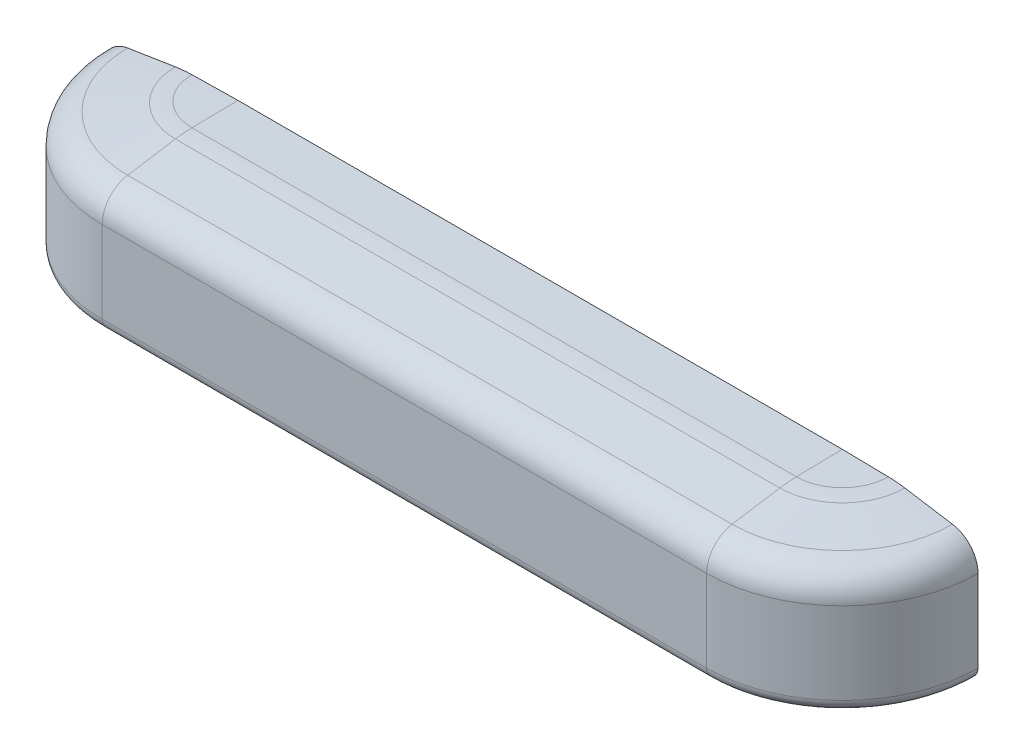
ISO-10303-21;
HEADER;
FILE_DESCRIPTION(('STEP AP214'),'2;1');
FILE_NAME('part.step','',(''),(''),'','','');
FILE_SCHEMA(('AUTOMOTIVE_DESIGN { 1 0 10303 214 1 1 1 1 }'));
ENDSEC;
DATA;
#1=APPLICATION_CONTEXT('core data for automotive mechanical design processes');
#2=APPLICATION_PROTOCOL_DEFINITION('international standard','automotive_design',2000,#1);
#3=PRODUCT_CONTEXT('',#1,'mechanical');
#4=PRODUCT('Part','Part','',(#3));
#5=PRODUCT_RELATED_PRODUCT_CATEGORY('part','',(#4));
#6=PRODUCT_DEFINITION_FORMATION('','',#4);
#7=PRODUCT_DEFINITION_CONTEXT('part definition',#1,'design');
#8=PRODUCT_DEFINITION('design','',#6,#7);
#9=PRODUCT_DEFINITION_SHAPE('','',#8);
#10=(LENGTH_UNIT() NAMED_UNIT(*) SI_UNIT(.MILLI.,.METRE.));
#11=(NAMED_UNIT(*) PLANE_ANGLE_UNIT() SI_UNIT($,.RADIAN.));
#12=(NAMED_UNIT(*) SI_UNIT($,.STERADIAN.) SOLID_ANGLE_UNIT());
#13=UNCERTAINTY_MEASURE_WITH_UNIT(LENGTH_MEASURE(1.E-05),#10,'distance_accuracy_value','');
#14=(GEOMETRIC_REPRESENTATION_CONTEXT(3) GLOBAL_UNCERTAINTY_ASSIGNED_CONTEXT((#13)) GLOBAL_UNIT_ASSIGNED_CONTEXT((#10,
#11,#12)) REPRESENTATION_CONTEXT('',''));
#15=CARTESIAN_POINT('',(0.,0.,0.));
#16=DIRECTION('',(0.,0.,1.));
#17=DIRECTION('',(1.,0.,0.));
#18=AXIS2_PLACEMENT_3D('',#15,#16,#17);
#19=CARTESIAN_POINT('',(109.,10.4996191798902,0.));
#20=DIRECTION('',(0.,0.,1.));
#21=DIRECTION('',(1.,0.,0.));
#22=AXIS2_PLACEMENT_3D('',#19,#20,#21);
#23=PLANE('',#22);
#24=CARTESIAN_POINT('',(120.,0.,0.));
#25=DIRECTION('',(0.,0.,-1.));
#26=DIRECTION('',(-1.,0.,0.));
#27=AXIS2_PLACEMENT_3D('',#24,#25,#26);
#28=CIRCLE('',#27,2.);
#29=CARTESIAN_POINT('',(118.,0.,0.));
#30=VERTEX_POINT('',#29);
#31=EDGE_CURVE('E1500',#30,#30,#28,.T.);
#32=ORIENTED_EDGE('',*,*,#31,.F.);
#33=EDGE_LOOP('',(#32));
#34=FACE_BOUND('',#33,.T.);
#35=CARTESIAN_POINT('',(0.,0.,0.));
#36=DIRECTION('',(0.,0.,-1.));
#37=DIRECTION('',(-1.,0.,0.));
#38=AXIS2_PLACEMENT_3D('',#35,#36,#37);
#39=CIRCLE('',#38,2.);
#40=CARTESIAN_POINT('',(-2.,0.,0.));
#41=VERTEX_POINT('',#40);
#42=EDGE_CURVE('E1501',#41,#41,#39,.T.);
#43=ORIENTED_EDGE('',*,*,#42,.F.);
#44=EDGE_LOOP('',(#43));
#45=FACE_BOUND('',#44,.T.);
#46=DIRECTION('',(-1.,0.,0.));
#47=VECTOR('',#46,1.);
#48=CARTESIAN_POINT('',(202.,-8.,0.));
#49=LINE('',#48,#47);
#50=CARTESIAN_POINT('',(-7.16836296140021,-8.,0.));
#51=VERTEX_POINT('',#50);
#52=CARTESIAN_POINT('',(-10.5243180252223,-8.,0.));
#53=VERTEX_POINT('',#52);
#54=EDGE_CURVE('E286',#51,#53,#49,.T.);
#55=ORIENTED_EDGE('',*,*,#54,.T.);
#56=CARTESIAN_POINT('',(-9.04,-6.72,0.));
#57=DIRECTION('',(0.,0.,1.));
#58=DIRECTION('',(0.,1.,0.));
#59=AXIS2_PLACEMENT_3D('',#56,#57,#58);
#60=CIRCLE('',#59,1.96);
#61=CARTESIAN_POINT('',(-11.,-6.72,0.));
#62=VERTEX_POINT('',#61);
#63=EDGE_CURVE('E802',#62,#53,#60,.T.);
#64=ORIENTED_EDGE('',*,*,#63,.F.);
#65=DIRECTION('',(0.,-1.,0.));
#66=VECTOR('',#65,1.);
#67=CARTESIAN_POINT('',(-11.,6.57072545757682,0.));
#68=LINE('',#67,#66);
#69=CARTESIAN_POINT('',(-11.,6.57072545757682,0.));
#70=VERTEX_POINT('',#69);
#71=EDGE_CURVE('E906',#70,#62,#68,.T.);
#72=ORIENTED_EDGE('',*,*,#71,.F.);
#73=CARTESIAN_POINT('',(-6.1,6.57072545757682,0.));
#74=DIRECTION('',(0.,0.,1.));
#75=DIRECTION('',(0.,1.,0.));
#76=AXIS2_PLACEMENT_3D('',#73,#74,#75);
#77=CIRCLE('',#76,4.9);
#78=CARTESIAN_POINT('',(-6.86652887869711,11.410398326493,0.));
#79=VERTEX_POINT('',#78);
#80=EDGE_CURVE('E1020',#79,#70,#77,.T.);
#81=ORIENTED_EDGE('',*,*,#80,.F.);
#82=DIRECTION('',(-0.987688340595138,-0.156434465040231,0.));
#83=VECTOR('',#82,1.);
#84=CARTESIAN_POINT('',(0.867028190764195,12.6352734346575,0.));
#85=LINE('',#84,#83);
#86=CARTESIAN_POINT('',(0.867028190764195,12.6352734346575,0.));
#87=VERTEX_POINT('',#86);
#88=EDGE_CURVE('E1021',#87,#79,#85,.T.);
#89=ORIENTED_EDGE('',*,*,#88,.F.);
#90=CARTESIAN_POINT('',(3.8862133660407,-6.42711153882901,0.));
#91=DIRECTION('',(0.,0.,1.));
#92=DIRECTION('',(0.,1.,0.));
#93=AXIS2_PLACEMENT_3D('',#90,#91,#92);
#94=CIRCLE('',#93,19.3000000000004);
#95=CARTESIAN_POINT('',(3.5493819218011,12.8699489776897,0.));
#96=VERTEX_POINT('',#95);
#97=EDGE_CURVE('E1024',#96,#87,#94,.T.);
#98=ORIENTED_EDGE('',*,*,#97,.F.);
#99=DIRECTION('',(0.999847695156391,0.0174524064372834,0.));
#100=VECTOR('',#99,1.);
#101=CARTESIAN_POINT('',(3.5493819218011,12.8699489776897,0.));
#102=LINE('',#101,#100);
#103=CARTESIAN_POINT('',(11.,13.,0.));
#104=VERTEX_POINT('',#103);
#105=EDGE_CURVE('E799',#96,#104,#102,.T.);
#106=ORIENTED_EDGE('',*,*,#105,.T.);
#107=DIRECTION('',(-1.,0.,0.));
#108=VECTOR('',#107,1.);
#109=CARTESIAN_POINT('',(109.,13.,0.));
#110=LINE('',#109,#108);
#111=CARTESIAN_POINT('',(109.,13.,0.));
#112=VERTEX_POINT('',#111);
#113=EDGE_CURVE('E456',#112,#104,#110,.T.);
#114=ORIENTED_EDGE('',*,*,#113,.F.);
#115=DIRECTION('',(-0.999847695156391,0.0174524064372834,0.));
#116=VECTOR('',#115,1.);
#117=CARTESIAN_POINT('',(116.450618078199,12.8699489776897,0.));
#118=LINE('',#117,#116);
#119=CARTESIAN_POINT('',(116.450618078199,12.8699489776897,0.));
#120=VERTEX_POINT('',#119);
#121=EDGE_CURVE('E304',#120,#112,#118,.T.);
#122=ORIENTED_EDGE('',*,*,#121,.F.);
#123=CARTESIAN_POINT('',(116.113786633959,-6.42711153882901,0.));
#124=DIRECTION('',(0.,0.,-1.));
#125=DIRECTION('',(0.,1.,0.));
#126=AXIS2_PLACEMENT_3D('',#123,#124,#125);
#127=CIRCLE('',#126,19.3000000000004);
#128=CARTESIAN_POINT('',(119.132971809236,12.6352734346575,0.));
#129=VERTEX_POINT('',#128);
#130=EDGE_CURVE('E903',#120,#129,#127,.T.);
#131=ORIENTED_EDGE('',*,*,#130,.T.);
#132=DIRECTION('',(0.987688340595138,-0.156434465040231,0.));
#133=VECTOR('',#132,1.);
#134=CARTESIAN_POINT('',(119.132971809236,12.6352734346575,0.));
#135=LINE('',#134,#133);
#136=CARTESIAN_POINT('',(126.866528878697,11.410398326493,0.));
#137=VERTEX_POINT('',#136);
#138=EDGE_CURVE('E898',#129,#137,#135,.T.);
#139=ORIENTED_EDGE('',*,*,#138,.T.);
#140=CARTESIAN_POINT('',(126.1,6.57072545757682,0.));
#141=DIRECTION('',(0.,0.,-1.));
#142=DIRECTION('',(0.,1.,0.));
#143=AXIS2_PLACEMENT_3D('',#140,#141,#142);
#144=CIRCLE('',#143,4.9);
#145=CARTESIAN_POINT('',(131.,6.57072545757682,0.));
#146=VERTEX_POINT('',#145);
#147=EDGE_CURVE('E896',#137,#146,#144,.T.);
#148=ORIENTED_EDGE('',*,*,#147,.T.);
#149=DIRECTION('',(0.,-1.,0.));
#150=VECTOR('',#149,1.);
#151=CARTESIAN_POINT('',(131.,6.57072545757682,0.));
#152=LINE('',#151,#150);
#153=CARTESIAN_POINT('',(131.,-6.72,0.));
#154=VERTEX_POINT('',#153);
#155=EDGE_CURVE('E303',#146,#154,#152,.T.);
#156=ORIENTED_EDGE('',*,*,#155,.T.);
#157=CARTESIAN_POINT('',(129.04,-6.72,0.));
#158=DIRECTION('',(0.,0.,-1.));
#159=DIRECTION('',(0.,1.,0.));
#160=AXIS2_PLACEMENT_3D('',#157,#158,#159);
#161=CIRCLE('',#160,1.96);
#162=CARTESIAN_POINT('',(130.524318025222,-8.,0.));
#163=VERTEX_POINT('',#162);
#164=EDGE_CURVE('E292',#154,#163,#161,.T.);
#165=ORIENTED_EDGE('',*,*,#164,.T.);
#166=CARTESIAN_POINT('',(127.1683629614,-8.,0.));
#167=VERTEX_POINT('',#166);
#168=EDGE_CURVE('E276',#163,#167,#49,.T.);
#169=ORIENTED_EDGE('',*,*,#168,.T.);
#170=DIRECTION('',(1.,0.,0.));
#171=VECTOR('',#170,1.);
#172=CARTESIAN_POINT('',(118.39,-8.,0.));
#173=LINE('',#172,#171);
#174=CARTESIAN_POINT('',(118.39,-8.,0.));
#175=VERTEX_POINT('',#174);
#176=EDGE_CURVE('E914',#175,#167,#173,.T.);
#177=ORIENTED_EDGE('',*,*,#176,.F.);
#178=CARTESIAN_POINT('',(118.39,-3.11,0.));
#179=DIRECTION('',(0.,0.,1.));
#180=DIRECTION('',(0.,1.,0.));
#181=AXIS2_PLACEMENT_3D('',#178,#179,#180);
#182=CIRCLE('',#181,4.89);
#183=CARTESIAN_POINT('',(113.5,-3.11,0.));
#184=VERTEX_POINT('',#183);
#185=EDGE_CURVE('E911',#184,#175,#182,.T.);
#186=ORIENTED_EDGE('',*,*,#185,.F.);
#187=DIRECTION('',(0.,-1.,0.));
#188=VECTOR('',#187,1.);
#189=CARTESIAN_POINT('',(113.5,7.56,0.));
#190=LINE('',#189,#188);
#191=CARTESIAN_POINT('',(113.5,7.56,0.));
#192=VERTEX_POINT('',#191);
#193=EDGE_CURVE('E919',#192,#184,#190,.T.);
#194=ORIENTED_EDGE('',*,*,#193,.F.);
#195=CARTESIAN_POINT('',(110.56,7.56,0.));
#196=DIRECTION('',(0.,0.,1.));
#197=DIRECTION('',(0.,1.,0.));
#198=AXIS2_PLACEMENT_3D('',#195,#196,#197);
#199=CIRCLE('',#198,2.94);
#200=CARTESIAN_POINT('',(111.015940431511,10.4644308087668,0.));
#201=VERTEX_POINT('',#200);
#202=EDGE_CURVE('E916',#192,#201,#199,.T.);
#203=ORIENTED_EDGE('',*,*,#202,.T.);
#204=DIRECTION('',(0.999847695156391,-0.0174524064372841,0.));
#205=VECTOR('',#204,1.);
#206=CARTESIAN_POINT('',(109.,10.4996191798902,0.));
#207=LINE('',#206,#205);
#208=CARTESIAN_POINT('',(109.,10.4996191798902,0.));
#209=VERTEX_POINT('',#208);
#210=EDGE_CURVE('E305',#209,#201,#207,.T.);
#211=ORIENTED_EDGE('',*,*,#210,.F.);
#212=DIRECTION('',(-1.,0.,0.));
#213=VECTOR('',#212,1.);
#214=CARTESIAN_POINT('',(109.,10.4996191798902,0.));
#215=LINE('',#214,#213);
#216=CARTESIAN_POINT('',(11.,10.4996191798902,0.));
#217=VERTEX_POINT('',#216);
#218=EDGE_CURVE('E459',#209,#217,#215,.T.);
#219=ORIENTED_EDGE('',*,*,#218,.T.);
#220=DIRECTION('',(-0.999847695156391,-0.0174524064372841,0.));
#221=VECTOR('',#220,1.);
#222=CARTESIAN_POINT('',(11.,10.4996191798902,0.));
#223=LINE('',#222,#221);
#224=CARTESIAN_POINT('',(8.9840595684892,10.4644308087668,0.));
#225=VERTEX_POINT('',#224);
#226=EDGE_CURVE('E830',#217,#225,#223,.T.);
#227=ORIENTED_EDGE('',*,*,#226,.T.);
#228=CARTESIAN_POINT('',(9.44,7.56,0.));
#229=DIRECTION('',(0.,0.,1.));
#230=DIRECTION('',(0.,1.,0.));
#231=AXIS2_PLACEMENT_3D('',#228,#229,#230);
#232=CIRCLE('',#231,2.94);
#233=CARTESIAN_POINT('',(6.5,7.56,0.));
#234=VERTEX_POINT('',#233);
#235=EDGE_CURVE('E1046',#225,#234,#232,.T.);
#236=ORIENTED_EDGE('',*,*,#235,.T.);
#237=DIRECTION('',(0.,1.,0.));
#238=VECTOR('',#237,1.);
#239=CARTESIAN_POINT('',(6.5,-3.11,0.));
#240=LINE('',#239,#238);
#241=CARTESIAN_POINT('',(6.5,-3.11,0.));
#242=VERTEX_POINT('',#241);
#243=EDGE_CURVE('E1041',#242,#234,#240,.T.);
#244=ORIENTED_EDGE('',*,*,#243,.F.);
#245=CARTESIAN_POINT('',(1.61,-3.11,0.));
#246=DIRECTION('',(0.,0.,1.));
#247=DIRECTION('',(0.,1.,0.));
#248=AXIS2_PLACEMENT_3D('',#245,#246,#247);
#249=CIRCLE('',#248,4.89);
#250=CARTESIAN_POINT('',(1.61,-8.,0.));
#251=VERTEX_POINT('',#250);
#252=EDGE_CURVE('E1039',#251,#242,#249,.T.);
#253=ORIENTED_EDGE('',*,*,#252,.F.);
#254=DIRECTION('',(1.,0.,0.));
#255=VECTOR('',#254,1.);
#256=CARTESIAN_POINT('',(-11.,-8.,0.));
#257=LINE('',#256,#255);
#258=EDGE_CURVE('E1035',#51,#251,#257,.T.);
#259=ORIENTED_EDGE('',*,*,#258,.F.);
#260=EDGE_LOOP('',(#55,#64,#72,#81,#89,#98,#106,#114,#122,#131,#139,#148,#156,#165,#169,#177,
#186,#194,#203,#211,#219,#227,#236,#244,#253,#259));
#261=FACE_BOUND('',#260,.T.);
#262=ADVANCED_FACE('F14',(#34,#45,#261),#23,.F.);
#263=CARTESIAN_POINT('',(109.,-7.04970617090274,0.));
#264=DIRECTION('',(0.,1.,0.));
#265=DIRECTION('',(-1.,0.,0.));
#266=AXIS2_PLACEMENT_3D('',#263,#264,#265);
#267=TOROIDAL_SURFACE('',#266,19.4926898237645,1.63);
#268=CARTESIAN_POINT('',(109.,-8.,0.));
#269=DIRECTION('',(0.,-1.,0.));
#270=DIRECTION('',(1.,0.,0.));
#271=AXIS2_PLACEMENT_3D('',#268,#269,#270);
#272=CIRCLE('',#271,18.1683629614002);
#273=CARTESIAN_POINT('',(118.39,-8.,15.5536912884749));
#274=VERTEX_POINT('',#273);
#275=EDGE_CURVE('E929',#274,#167,#272,.F.);
#276=ORIENTED_EDGE('',*,*,#275,.T.);
#277=CARTESIAN_POINT('',(109.,-8.67871321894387,19.4358036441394));
#278=CARTESIAN_POINT('',(109.049676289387,-8.67861943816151,19.4331181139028));
#279=CARTESIAN_POINT('',(109.099344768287,-8.67851899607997,19.4302418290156));
#280=CARTESIAN_POINT('',(109.691806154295,-8.67724125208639,19.3936520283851));
#281=CARTESIAN_POINT('',(110.233465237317,-8.67527537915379,19.3373567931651));
#282=CARTESIAN_POINT('',(111.309903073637,-8.66976747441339,19.1796310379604));
#283=CARTESIAN_POINT('',(111.844681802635,-8.66622543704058,19.0782003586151));
#284=CARTESIAN_POINT('',(113.418383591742,-8.65338294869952,18.7104396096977));
#285=CARTESIAN_POINT('',(114.442992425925,-8.64182987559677,18.3796028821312));
#286=CARTESIAN_POINT('',(116.419020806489,-8.61300415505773,17.5541422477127));
#287=CARTESIAN_POINT('',(117.370719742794,-8.59575484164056,17.0601865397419));
#288=CARTESIAN_POINT('',(118.724378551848,-8.56599520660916,16.2079820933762));
#289=CARTESIAN_POINT('',(119.162628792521,-8.55544805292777,15.9059511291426));
#290=CARTESIAN_POINT('',(120.012565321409,-8.53311984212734,15.2665548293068));
#291=CARTESIAN_POINT('',(120.424256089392,-8.52133899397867,14.9291954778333));
#292=CARTESIAN_POINT('',(121.216257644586,-8.49668025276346,14.2230615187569));
#293=CARTESIAN_POINT('',(121.596704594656,-8.48380767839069,13.8544392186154));
#294=CARTESIAN_POINT('',(122.325953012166,-8.45699459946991,13.0866130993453));
#295=CARTESIAN_POINT('',(122.67473052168,-8.4430533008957,12.6873865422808));
#296=CARTESIAN_POINT('',(123.340735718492,-8.41407869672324,11.8576624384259));
#297=CARTESIAN_POINT('',(123.657658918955,-8.39903686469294,11.4269207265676));
#298=CARTESIAN_POINT('',(124.254211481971,-8.36806976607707,10.5401390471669));
#299=CARTESIAN_POINT('',(124.533827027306,-8.35214417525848,10.0840897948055));
#300=CARTESIAN_POINT('',(125.053834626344,-8.31950786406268,9.14950812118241));
#301=CARTESIAN_POINT('',(125.294182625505,-8.30279628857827,8.67095121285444));
#302=CARTESIAN_POINT('',(125.733458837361,-8.26872234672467,7.69520118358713));
#303=CARTESIAN_POINT('',(125.932386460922,-8.2513599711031,7.19800779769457));
#304=CARTESIAN_POINT('',(126.286820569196,-8.21615393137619,6.18983872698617));
#305=CARTESIAN_POINT('',(126.442438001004,-8.19831162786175,5.67890200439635));
#306=CARTESIAN_POINT('',(126.709706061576,-8.16222971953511,4.64565133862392));
#307=CARTESIAN_POINT('',(126.821355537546,-8.14399010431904,4.12333709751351));
#308=CARTESIAN_POINT('',(126.999730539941,-8.10725098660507,3.07126641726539));
#309=CARTESIAN_POINT('',(127.06647002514,-8.08875156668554,2.5415123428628));
#310=CARTESIAN_POINT('',(127.154475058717,-8.05162194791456,1.47825917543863));
#311=CARTESIAN_POINT('',(127.175742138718,-8.03299175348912,0.944760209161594));
#312=CARTESIAN_POINT('',(127.172544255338,-7.99592968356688,-0.11655861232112));
#313=CARTESIAN_POINT('',(127.148552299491,-7.97749775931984,-0.64437986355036));
#314=CARTESIAN_POINT('',(127.055825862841,-7.94077217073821,-1.69606312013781));
#315=CARTESIAN_POINT('',(126.987091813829,-7.92247850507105,-2.21992516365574));
#316=CARTESIAN_POINT('',(126.805109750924,-7.88613536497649,-3.26065652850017));
#317=CARTESIAN_POINT('',(126.691803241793,-7.8680862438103,-3.77751573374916));
#318=CARTESIAN_POINT('',(126.48904217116,-7.84131909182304,-4.54402667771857));
#319=CARTESIAN_POINT('',(126.41597315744,-7.83244632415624,-4.79810949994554));
#320=CARTESIAN_POINT('',(126.259013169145,-7.81481805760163,-5.30291700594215));
#321=CARTESIAN_POINT('',(126.175122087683,-7.80606255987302,-5.55364165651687));
#322=CARTESIAN_POINT('',(126.085876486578,-7.79737279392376,-5.80248399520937));
#323=B_SPLINE_CURVE_WITH_KNOTS('',3,(#277,#278,#279,#280,#281,#282,#283,#284,#285,#286,#287,
#288,#289,#290,#291,#292,#293,#294,#295,#296,#297,#298,#299,#300,#301,#302,#303,#304,#305,#306,
#307,#308,#309,#310,#311,#312,#313,#314,#315,#316,#317,#318,#319,#320,#321,#322),.UNSPECIFIED.,
.F.,.F.,(4,2,2,2,2,2,2,2,2,2,2,2,2,2,2,2,2,2,2,2,2,2,4),(0.,0.149253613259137,1.78068758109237,
3.41212730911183,6.62655568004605,9.82797654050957,11.4234946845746,13.0187430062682,
14.6066227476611,16.1956938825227,17.798742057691,19.4023822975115,21.0078094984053,
22.613259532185,24.2145582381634,25.815898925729,27.4167416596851,29.017530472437,
30.6016818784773,32.1858179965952,33.7720400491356,34.565418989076,35.3588057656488),.UNSPECIFIED.);
#324=CARTESIAN_POINT('',(109.,-8.67871321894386,19.4358036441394));
#325=VERTEX_POINT('',#324);
#326=EDGE_CURVE('E280',#167,#325,#323,.F.);
#327=ORIENTED_EDGE('',*,*,#326,.T.);
#328=CARTESIAN_POINT('',(109.,-7.04970617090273,19.4926898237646));
#329=DIRECTION('',(1.,0.,0.));
#330=DIRECTION('',(0.,1.,0.));
#331=AXIS2_PLACEMENT_3D('',#328,#329,#330);
#332=CIRCLE('',#331,1.63);
#333=CARTESIAN_POINT('',(109.,-7.41164835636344,17.9033824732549));
#334=VERTEX_POINT('',#333);
#335=EDGE_CURVE('E359',#325,#334,#332,.T.);
#336=ORIENTED_EDGE('',*,*,#335,.T.);
#337=CARTESIAN_POINT('',(109.,-7.41164825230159,0.));
#338=DIRECTION('',(0.,1.,0.));
#339=DIRECTION('',(-1.,0.,0.));
#340=AXIS2_PLACEMENT_3D('',#337,#338,#339);
#341=CIRCLE('',#340,17.9033824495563);
#342=CARTESIAN_POINT('',(116.064506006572,-7.41164825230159,16.4506491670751));
#343=VERTEX_POINT('',#342);
#344=EDGE_CURVE('E325',#334,#343,#341,.T.);
#345=ORIENTED_EDGE('',*,*,#344,.T.);
#346=CARTESIAN_POINT('',(116.06413608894,-7.41144825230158,16.4507584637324));
#347=CARTESIAN_POINT('',(116.123717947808,-7.44366740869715,16.4331536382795));
#348=CARTESIAN_POINT('',(116.184001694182,-7.47466095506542,16.4157188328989));
#349=CARTESIAN_POINT('',(116.305796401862,-7.53411413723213,16.3807892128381));
#350=CARTESIAN_POINT('',(116.367307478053,-7.56257353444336,16.3632943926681));
#351=CARTESIAN_POINT('',(116.553591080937,-7.6441014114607,16.310069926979));
#352=CARTESIAN_POINT('',(116.679929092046,-7.69321966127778,16.2736521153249));
#353=CARTESIAN_POINT('',(116.93157821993,-7.77929707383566,16.1970309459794));
#354=CARTESIAN_POINT('',(117.05682969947,-7.81654077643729,16.1569515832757));
#355=CARTESIAN_POINT('',(117.307535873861,-7.88043713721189,16.0699242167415));
#356=CARTESIAN_POINT('',(117.432990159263,-7.90710214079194,16.0229843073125));
#357=CARTESIAN_POINT('',(117.628355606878,-7.94085635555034,15.9428347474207));
#358=CARTESIAN_POINT('',(117.698850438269,-7.95142609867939,15.9124528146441));
#359=CARTESIAN_POINT('',(117.838989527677,-7.96936966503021,15.8488787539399));
#360=CARTESIAN_POINT('',(117.908633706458,-7.97674319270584,15.8156863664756));
#361=CARTESIAN_POINT('',(118.04778638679,-7.98851807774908,15.7459758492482));
#362=CARTESIAN_POINT('',(118.117277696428,-7.99287393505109,15.7094158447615));
#363=CARTESIAN_POINT('',(118.254847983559,-7.9986171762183,15.6335333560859));
#364=CARTESIAN_POINT('',(118.322927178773,-8.00000502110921,15.5942113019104));
#365=CARTESIAN_POINT('',(118.3902,-7.99999999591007,15.5535705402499));
#366=B_SPLINE_CURVE_WITH_KNOTS('',3,(#346,#347,#348,#349,#350,#351,#352,#353,#354,#355,#356,
#357,#358,#359,#360,#361,#362,#363,#364,#365),.UNSPECIFIED.,.F.,.F.,(4,2,2,2,2,2,2,2,2,4),(0.,
0.209924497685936,0.419868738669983,0.840404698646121,1.24993628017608,1.65898851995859,
1.89134428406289,2.12372152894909,2.35953044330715,2.59530272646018),.UNSPECIFIED.);
#367=EDGE_CURVE('E581',#343,#274,#366,.T.);
#368=ORIENTED_EDGE('',*,*,#367,.T.);
#369=EDGE_LOOP('',(#276,#327,#336,#345,#368));
#370=FACE_BOUND('',#369,.T.);
#371=ADVANCED_FACE('F564',(#370),#267,.T.);
#372=CARTESIAN_POINT('',(109.,-6.72,0.));
#373=DIRECTION('',(0.,1.,0.));
#374=DIRECTION('',(-1.,0.,0.));
#375=AXIS2_PLACEMENT_3D('',#372,#373,#374);
#376=TOROIDAL_SURFACE('',#375,20.04,1.96);
#377=CARTESIAN_POINT('',(109.,-8.67999971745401,0.));
#378=DIRECTION('',(0.,1.,0.));
#379=DIRECTION('',(-1.,0.,0.));
#380=AXIS2_PLACEMENT_3D('',#377,#378,#379);
#381=CIRCLE('',#380,20.0389475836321);
#382=CARTESIAN_POINT('',(109.,-8.67999971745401,20.0389475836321));
#383=VERTEX_POINT('',#382);
#384=CARTESIAN_POINT('',(113.730280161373,-8.67999971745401,19.4726441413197));
#385=VERTEX_POINT('',#384);
#386=EDGE_CURVE('E295',#383,#385,#381,.T.);
#387=ORIENTED_EDGE('',*,*,#386,.T.);
#388=CARTESIAN_POINT('',(127.555675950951,-7.99999301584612,-0.0002));
#389=CARTESIAN_POINT('',(127.565563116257,-8.01145677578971,0.328079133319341));
#390=CARTESIAN_POINT('',(127.566977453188,-8.02292705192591,0.656544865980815));
#391=CARTESIAN_POINT('',(127.552897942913,-8.04585542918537,1.3131276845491));
#392=CARTESIAN_POINT('',(127.537403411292,-8.05731352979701,1.64124475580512));
#393=CARTESIAN_POINT('',(127.465513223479,-8.09167784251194,2.62530991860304));
#394=CARTESIAN_POINT('',(127.383670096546,-8.11452626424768,3.27960311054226));
#395=CARTESIAN_POINT('',(127.173510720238,-8.15584835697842,4.46291302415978));
#396=CARTESIAN_POINT('',(127.055798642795,-8.17438956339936,4.99386370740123));
#397=CARTESIAN_POINT('',(126.775940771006,-8.21106819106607,6.04420217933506));
#398=CARTESIAN_POINT('',(126.613778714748,-8.22920546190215,6.56358566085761));
#399=CARTESIAN_POINT('',(126.246493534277,-8.26492448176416,7.58644456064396));
#400=CARTESIAN_POINT('',(126.041406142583,-8.28250667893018,8.08993281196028));
#401=CARTESIAN_POINT('',(125.589874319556,-8.31700286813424,9.07777442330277));
#402=CARTESIAN_POINT('',(125.343447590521,-8.3339171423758,9.56213586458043));
#403=CARTESIAN_POINT('',(124.813906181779,-8.36679208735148,10.5035511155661));
#404=CARTESIAN_POINT('',(124.531213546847,-8.38276104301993,10.960842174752));
#405=CARTESIAN_POINT('',(123.92943179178,-8.41382184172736,11.8503070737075));
#406=CARTESIAN_POINT('',(123.610371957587,-8.42891437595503,12.2825007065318));
#407=CARTESIAN_POINT('',(122.93791376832,-8.45814127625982,13.1194496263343));
#408=CARTESIAN_POINT('',(122.584509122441,-8.47227546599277,13.5241998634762));
#409=CARTESIAN_POINT('',(121.845833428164,-8.49949755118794,14.3037383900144));
#410=CARTESIAN_POINT('',(121.460553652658,-8.5125851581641,14.6785184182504));
#411=CARTESIAN_POINT('',(120.660989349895,-8.53763009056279,15.3957114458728));
#412=CARTESIAN_POINT('',(120.246706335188,-8.54958747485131,15.7381261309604));
#413=CARTESIAN_POINT('',(119.392220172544,-8.57230252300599,16.3886000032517));
#414=CARTESIAN_POINT('',(118.952028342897,-8.58306070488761,16.6966740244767));
#415=CARTESIAN_POINT('',(118.183602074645,-8.60030972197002,17.1906212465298));
#416=CARTESIAN_POINT('',(117.861136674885,-8.60711626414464,17.3855351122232));
#417=CARTESIAN_POINT('',(117.198243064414,-8.62027064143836,17.7622271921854));
#418=CARTESIAN_POINT('',(116.857569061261,-8.62660340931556,17.9435739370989));
#419=CARTESIAN_POINT('',(116.153561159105,-8.63886539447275,18.2947112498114));
#420=CARTESIAN_POINT('',(115.789862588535,-8.64476903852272,18.4637694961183));
#421=CARTESIAN_POINT('',(115.224347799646,-8.65339329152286,18.7107357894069));
#422=CARTESIAN_POINT('',(115.02515857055,-8.65632713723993,18.7947501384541));
#423=CARTESIAN_POINT('',(114.625128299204,-8.66205894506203,18.9588876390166));
#424=CARTESIAN_POINT('',(114.424286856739,-8.66485687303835,19.0390098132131));
#425=CARTESIAN_POINT('',(114.152453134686,-8.66868234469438,19.1485569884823));
#426=CARTESIAN_POINT('',(114.081203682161,-8.66968862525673,19.17737309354));
#427=CARTESIAN_POINT('',(113.939148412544,-8.67173796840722,19.2360586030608));
#428=CARTESIAN_POINT('',(113.86834242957,-8.67278101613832,19.2659275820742));
#429=CARTESIAN_POINT('',(113.75848557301,-8.67452865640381,19.3159734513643));
#430=CARTESIAN_POINT('',(113.71883429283,-8.67518664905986,19.3348158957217));
#431=CARTESIAN_POINT('',(113.661702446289,-8.67626982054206,19.3658338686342));
#432=CARTESIAN_POINT('',(113.64342353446,-8.67663793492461,19.3763752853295));
#433=CARTESIAN_POINT('',(113.619950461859,-8.67720541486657,19.3926257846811));
#434=CARTESIAN_POINT('',(113.613898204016,-8.67736114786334,19.3970853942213));
#435=CARTESIAN_POINT('',(113.602546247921,-8.67768907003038,19.4064758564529));
#436=CARTESIAN_POINT('',(113.597225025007,-8.67786021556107,19.4113768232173));
#437=CARTESIAN_POINT('',(113.591532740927,-8.67810157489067,19.4182884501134));
#438=CARTESIAN_POINT('',(113.590451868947,-8.678150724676,19.4196959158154));
#439=CARTESIAN_POINT('',(113.588437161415,-8.67825267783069,19.4226154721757));
#440=CARTESIAN_POINT('',(113.587503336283,-8.67830548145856,19.4241275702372));
#441=CARTESIAN_POINT('',(113.586054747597,-8.67840235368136,19.4269016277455));
#442=CARTESIAN_POINT('',(113.585493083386,-8.67844555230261,19.4281386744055));
#443=CARTESIAN_POINT('',(113.584561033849,-8.67853441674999,19.4306834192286));
#444=CARTESIAN_POINT('',(113.584190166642,-8.67858007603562,19.4319909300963));
#445=CARTESIAN_POINT('',(113.58378570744,-8.67865926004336,19.4342584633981));
#446=CARTESIAN_POINT('',(113.583684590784,-8.67869235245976,19.4352061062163));
#447=CARTESIAN_POINT('',(113.583639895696,-8.67875866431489,19.4371050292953));
#448=CARTESIAN_POINT('',(113.583696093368,-8.67879188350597,19.4380563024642));
#449=CARTESIAN_POINT('',(113.583979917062,-8.67885760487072,19.4399383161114));
#450=CARTESIAN_POINT('',(113.584208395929,-8.67889010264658,19.4408689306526));
#451=CARTESIAN_POINT('',(113.584829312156,-8.6789531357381,19.4426739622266));
#452=CARTESIAN_POINT('',(113.585221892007,-8.67898366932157,19.4435483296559));
#453=CARTESIAN_POINT('',(113.586239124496,-8.67904809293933,19.4453931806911));
#454=CARTESIAN_POINT('',(113.58689493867,-8.67908137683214,19.4463463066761));
#455=CARTESIAN_POINT('',(113.588350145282,-8.67914385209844,19.4481353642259));
#456=CARTESIAN_POINT('',(113.589149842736,-8.67917303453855,19.4489710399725));
#457=CARTESIAN_POINT('',(113.591453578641,-8.67924731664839,19.4510982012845));
#458=CARTESIAN_POINT('',(113.593051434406,-8.67928882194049,19.4522867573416));
#459=CARTESIAN_POINT('',(113.596395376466,-8.67936368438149,19.4544305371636));
#460=CARTESIAN_POINT('',(113.598141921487,-8.67939701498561,19.455385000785));
#461=CARTESIAN_POINT('',(113.605552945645,-8.67952380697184,19.4590158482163));
#462=CARTESIAN_POINT('',(113.611555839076,-8.67959220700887,19.4609745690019));
#463=CARTESIAN_POINT('',(113.623746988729,-8.67970418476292,19.4641811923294));
#464=CARTESIAN_POINT('',(113.62993627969,-8.67974757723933,19.4654237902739));
#465=CARTESIAN_POINT('',(113.664784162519,-8.6799553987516,19.4713750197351));
#466=CARTESIAN_POINT('',(113.69400528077,-8.67999220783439,19.4724290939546));
#467=CARTESIAN_POINT('',(113.752285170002,-8.68000383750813,19.4727621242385));
#468=CARTESIAN_POINT('',(113.781343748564,-8.67997859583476,19.472039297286));
#469=CARTESIAN_POINT('',(113.868005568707,-8.67984359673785,19.4681734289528));
#470=CARTESIAN_POINT('',(113.925573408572,-8.67967513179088,19.4633492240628));
#471=CARTESIAN_POINT('',(114.0405109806,-8.67926935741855,19.4517293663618));
#472=CARTESIAN_POINT('',(114.09788040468,-8.67903196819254,19.4449314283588));
#473=CARTESIAN_POINT('',(114.269562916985,-8.67824638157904,19.4224351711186));
#474=CARTESIAN_POINT('',(114.383608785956,-8.67762431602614,19.4046215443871));
#475=CARTESIAN_POINT('',(114.725107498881,-8.67557213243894,19.3458546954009));
#476=CARTESIAN_POINT('',(114.951620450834,-8.6739571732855,19.2996083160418));
#477=CARTESIAN_POINT('',(115.402405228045,-8.67036931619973,19.196865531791));
#478=CARTESIAN_POINT('',(115.62667562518,-8.668396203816,19.1403629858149));
#479=CARTESIAN_POINT('',(116.073035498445,-8.6641303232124,19.0182041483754));
#480=CARTESIAN_POINT('',(116.295121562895,-8.6618371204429,18.952535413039));
#481=CARTESIAN_POINT('',(116.736563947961,-8.656956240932,18.8127653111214));
#482=CARTESIAN_POINT('',(116.955920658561,-8.65436860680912,18.7386651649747));
#483=CARTESIAN_POINT('',(117.612647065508,-8.64614603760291,18.503201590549));
#484=CARTESIAN_POINT('',(118.045670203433,-8.64008047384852,18.3295065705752));
#485=CARTESIAN_POINT('',(118.898139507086,-8.62688112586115,17.9515266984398));
#486=CARTESIAN_POINT('',(119.31758007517,-8.61974690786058,17.7472294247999));
#487=CARTESIAN_POINT('',(120.553092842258,-8.59680924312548,17.0903806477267));
#488=CARTESIAN_POINT('',(121.346466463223,-8.57946938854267,16.5938321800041));
#489=CARTESIAN_POINT('',(122.547824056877,-8.54896984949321,15.7204396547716));
#490=CARTESIAN_POINT('',(122.981034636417,-8.5369889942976,15.3773528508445));
#491=CARTESIAN_POINT('',(123.817959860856,-8.51183334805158,14.6569893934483));
#492=CARTESIAN_POINT('',(124.221683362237,-8.49865891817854,14.2797230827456));
#493=CARTESIAN_POINT('',(124.997343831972,-8.47119948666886,13.4933878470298));
#494=CARTESIAN_POINT('',(125.369258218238,-8.45691370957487,13.084296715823));
#495=CARTESIAN_POINT('',(126.078580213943,-8.42734237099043,12.2374843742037));
#496=CARTESIAN_POINT('',(126.415999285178,-8.41205714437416,11.7997727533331));
#497=CARTESIAN_POINT('',(127.065503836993,-8.38003739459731,10.8828470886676));
#498=CARTESIAN_POINT('',(127.376297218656,-8.36327093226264,10.4027184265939));
#499=CARTESIAN_POINT('',(127.956821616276,-8.32889201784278,9.41823512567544));
#500=CARTESIAN_POINT('',(128.226549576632,-8.31127950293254,8.91387868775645));
#501=CARTESIAN_POINT('',(128.723143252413,-8.27533675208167,7.88461297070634));
#502=CARTESIAN_POINT('',(128.950014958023,-8.25700661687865,7.3597065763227));
#503=CARTESIAN_POINT('',(129.359485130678,-8.21975597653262,6.29298780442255));
#504=CARTESIAN_POINT('',(129.542090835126,-8.20083556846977,5.75117820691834));
#505=CARTESIAN_POINT('',(129.825327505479,-8.16691991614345,4.77996099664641));
#506=CARTESIAN_POINT('',(129.935154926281,-8.15201724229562,4.35320425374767));
#507=CARTESIAN_POINT('',(130.127460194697,-8.12200014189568,3.49362696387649));
#508=CARTESIAN_POINT('',(130.20994212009,-8.10688574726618,3.06080733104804));
#509=CARTESIAN_POINT('',(130.347206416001,-8.07652352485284,2.19134703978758));
#510=CARTESIAN_POINT('',(130.402022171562,-8.06127588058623,1.75471163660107));
#511=CARTESIAN_POINT('',(130.483974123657,-8.03068804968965,0.87879076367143));
#512=CARTESIAN_POINT('',(130.511106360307,-8.01534785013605,0.439504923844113));
#513=CARTESIAN_POINT('',(130.524324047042,-7.99999301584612,-0.000200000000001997));
#514=B_SPLINE_CURVE_WITH_KNOTS('',3,(#388,#389,#390,#391,#392,#393,#394,#395,#396,#397,#398,
#399,#400,#401,#402,#403,#404,#405,#406,#407,#408,#409,#410,#411,#412,#413,#414,#415,#416,#417,
#418,#419,#420,#421,#422,#423,#424,#425,#426,#427,#428,#429,#430,#431,#432,#433,#434,#435,#436,
#437,#438,#439,#440,#441,#442,#443,#444,#445,#446,#447,#448,#449,#450,#451,#452,#453,#454,#455,
#456,#457,#458,#459,#460,#461,#462,#463,#464,#465,#466,#467,#468,#469,#470,#471,#472,#473,#474,
#475,#476,#477,#478,#479,#480,#481,#482,#483,#484,#485,#486,#487,#488,#489,#490,#491,#492,#493,
#494,#495,#496,#497,#498,#499,#500,#501,#502,#503,#504,#505,#506,#507,#508,#509,#510,#511,#512,
#513),.UNSPECIFIED.,.F.,.F.,(4,2,2,2,2,2,2,2,2,2,2,2,2,2,2,2,2,2,2,2,2,2,2,2,2,2,2,2,2,2,2,2,2,
2,2,2,2,2,2,2,2,2,2,2,2,2,2,2,2,2,2,2,2,2,2,2,2,2,2,2,2,2,4),(0.,0.98563926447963,
1.97131842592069,3.94676828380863,5.57743715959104,7.20870340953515,8.83861710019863,
10.4678346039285,12.079570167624,13.6900168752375,15.3007591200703,16.9119438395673,
18.523044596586,20.1334466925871,21.2635044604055,22.4208814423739,23.6236569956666,
24.2722224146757,24.9209498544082,25.151547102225,25.3820522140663,25.5137395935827,
25.5768893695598,25.5994459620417,25.6209965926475,25.6263162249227,25.6316362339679,
25.6357038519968,25.6397611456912,25.6426110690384,25.645456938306,25.648316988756,
25.6511795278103,25.6546323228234,25.658092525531,25.6640343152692,25.6699951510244,
25.6887912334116,25.70772481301,25.794916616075,25.8821959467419,26.0553191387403,
26.2286435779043,26.5748157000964,27.2680661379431,27.9617330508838,28.6563510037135,
29.3508685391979,30.7492287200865,32.1481580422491,34.9456675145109,36.6023890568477,
38.2586109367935,39.9159990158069,41.5728345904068,43.2873912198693,45.002075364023,
46.7165196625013,48.4306834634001,49.7525831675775,51.0742856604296,52.3943894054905,
53.7146819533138),.UNSPECIFIED.);
#515=EDGE_CURVE('E29',#385,#163,#514,.T.);
#516=ORIENTED_EDGE('',*,*,#515,.T.);
#517=ORIENTED_EDGE('',*,*,#164,.F.);
#518=CARTESIAN_POINT('',(109.,-6.72,0.));
#519=DIRECTION('',(0.,1.,0.));
#520=DIRECTION('',(-1.,0.,0.));
#521=AXIS2_PLACEMENT_3D('',#518,#519,#520);
#522=CIRCLE('',#521,22.);
#523=CARTESIAN_POINT('',(109.,-6.72,22.));
#524=VERTEX_POINT('',#523);
#525=EDGE_CURVE('E322',#524,#154,#522,.T.);
#526=ORIENTED_EDGE('',*,*,#525,.F.);
#527=CARTESIAN_POINT('',(109.,-6.72,20.04));
#528=DIRECTION('',(1.,0.,0.));
#529=DIRECTION('',(0.,1.,0.));
#530=AXIS2_PLACEMENT_3D('',#527,#528,#529);
#531=CIRCLE('',#530,1.96);
#532=EDGE_CURVE('E353',#524,#383,#531,.T.);
#533=ORIENTED_EDGE('',*,*,#532,.T.);
#534=EDGE_LOOP('',(#387,#516,#517,#526,#533));
#535=FACE_BOUND('',#534,.T.);
#536=ADVANCED_FACE('F290',(#535),#376,.T.);
#537=CARTESIAN_POINT('',(11.,-7.04970617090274,0.));
#538=DIRECTION('',(0.,1.,0.));
#539=DIRECTION('',(-1.,0.,0.));
#540=AXIS2_PLACEMENT_3D('',#537,#538,#539);
#541=TOROIDAL_SURFACE('',#540,19.4926898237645,1.63);
#542=CARTESIAN_POINT('',(11.,-7.04970617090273,19.4926898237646));
#543=DIRECTION('',(1.,0.,0.));
#544=DIRECTION('',(0.,1.,0.));
#545=AXIS2_PLACEMENT_3D('',#542,#543,#544);
#546=CIRCLE('',#545,1.63);
#547=CARTESIAN_POINT('',(11.,-8.67871321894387,19.4358036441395));
#548=VERTEX_POINT('',#547);
#549=CARTESIAN_POINT('',(11.,-7.41164825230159,17.9033824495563));
#550=VERTEX_POINT('',#549);
#551=EDGE_CURVE('E407',#548,#550,#546,.T.);
#552=ORIENTED_EDGE('',*,*,#551,.F.);
#553=CARTESIAN_POINT('',(11.,-8.67871321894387,19.4358036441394));
#554=CARTESIAN_POINT('',(10.9503237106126,-8.67861943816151,19.4331181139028));
#555=CARTESIAN_POINT('',(10.9006552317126,-8.67851899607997,19.4302418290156));
#556=CARTESIAN_POINT('',(10.3081938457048,-8.67724125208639,19.3936520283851));
#557=CARTESIAN_POINT('',(9.76653476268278,-8.67527537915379,19.3373567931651));
#558=CARTESIAN_POINT('',(8.69009692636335,-8.66976747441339,19.1796310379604));
#559=CARTESIAN_POINT('',(8.15531819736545,-8.66622543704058,19.0782003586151));
#560=CARTESIAN_POINT('',(6.58161640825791,-8.65338294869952,18.7104396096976));
#561=CARTESIAN_POINT('',(5.55700757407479,-8.64182987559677,18.3796028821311));
#562=CARTESIAN_POINT('',(3.58097919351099,-8.61300415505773,17.5541422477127));
#563=CARTESIAN_POINT('',(2.62928025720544,-8.59575484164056,17.0601865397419));
#564=CARTESIAN_POINT('',(1.27562144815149,-8.56599520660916,16.2079820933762));
#565=CARTESIAN_POINT('',(0.837371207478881,-8.55544805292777,15.9059511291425));
#566=CARTESIAN_POINT('',(-0.01256532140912,-8.53311984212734,15.2665548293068));
#567=CARTESIAN_POINT('',(-0.424256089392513,-8.52133899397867,14.9291954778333));
#568=CARTESIAN_POINT('',(-1.2162576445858,-8.49668025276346,14.2230615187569));
#569=CARTESIAN_POINT('',(-1.59670459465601,-8.48380767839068,13.8544392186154));
#570=CARTESIAN_POINT('',(-2.32595301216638,-8.45699459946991,13.0866130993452));
#571=CARTESIAN_POINT('',(-2.67473052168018,-8.4430533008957,12.6873865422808));
#572=CARTESIAN_POINT('',(-3.34073571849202,-8.41407869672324,11.8576624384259));
#573=CARTESIAN_POINT('',(-3.65765891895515,-8.39903686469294,11.4269207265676));
#574=CARTESIAN_POINT('',(-4.25421148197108,-8.36806976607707,10.5401390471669));
#575=CARTESIAN_POINT('',(-4.53382702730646,-8.35214417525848,10.0840897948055));
#576=CARTESIAN_POINT('',(-5.05383462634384,-8.31950786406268,9.14950812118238));
#577=CARTESIAN_POINT('',(-5.29418262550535,-8.30279628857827,8.67095121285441));
#578=CARTESIAN_POINT('',(-5.73345883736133,-8.26872234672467,7.69520118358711));
#579=CARTESIAN_POINT('',(-5.93238646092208,-8.2513599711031,7.19800779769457));
#580=CARTESIAN_POINT('',(-6.28682056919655,-8.21615393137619,6.18983872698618));
#581=CARTESIAN_POINT('',(-6.44243800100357,-8.19831162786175,5.67890200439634));
#582=CARTESIAN_POINT('',(-6.70970606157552,-8.16222971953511,4.64565133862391));
#583=CARTESIAN_POINT('',(-6.82135553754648,-8.14399010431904,4.1233370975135));
#584=CARTESIAN_POINT('',(-6.99973053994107,-8.10725098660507,3.07126641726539));
#585=CARTESIAN_POINT('',(-7.06647002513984,-8.08875156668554,2.5415123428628));
#586=CARTESIAN_POINT('',(-7.15447505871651,-8.05162194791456,1.47825917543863));
#587=CARTESIAN_POINT('',(-7.17574213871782,-8.03299175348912,0.944760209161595));
#588=CARTESIAN_POINT('',(-7.17254425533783,-7.99592968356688,-0.116558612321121));
#589=CARTESIAN_POINT('',(-7.14855229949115,-7.97749775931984,-0.644379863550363));
#590=CARTESIAN_POINT('',(-7.05582586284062,-7.94077217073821,-1.69606312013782));
#591=CARTESIAN_POINT('',(-6.9870918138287,-7.92247850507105,-2.21992516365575));
#592=CARTESIAN_POINT('',(-6.80510975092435,-7.88613536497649,-3.26065652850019));
#593=CARTESIAN_POINT('',(-6.6918032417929,-7.8680862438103,-3.77751573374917));
#594=CARTESIAN_POINT('',(-6.48904217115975,-7.84131909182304,-4.54402667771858));
#595=CARTESIAN_POINT('',(-6.41597315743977,-7.83244632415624,-4.79810949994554));
#596=CARTESIAN_POINT('',(-6.2590131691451,-7.81481805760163,-5.30291700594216));
#597=CARTESIAN_POINT('',(-6.17512208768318,-7.80606255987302,-5.55364165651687));
#598=CARTESIAN_POINT('',(-6.0858764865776,-7.79737279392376,-5.80248399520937));
#599=B_SPLINE_CURVE_WITH_KNOTS('',3,(#553,#554,#555,#556,#557,#558,#559,#560,#561,#562,#563,
#564,#565,#566,#567,#568,#569,#570,#571,#572,#573,#574,#575,#576,#577,#578,#579,#580,#581,#582,
#583,#584,#585,#586,#587,#588,#589,#590,#591,#592,#593,#594,#595,#596,#597,#598),.UNSPECIFIED.,
.F.,.F.,(4,2,2,2,2,2,2,2,2,2,2,2,2,2,2,2,2,2,2,2,2,2,4),(0.,0.149253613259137,1.78068758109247,
3.41212730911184,6.62655568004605,9.82797654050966,11.4234946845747,13.0187430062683,
14.6066227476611,16.1956938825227,17.798742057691,19.4023822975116,21.0078094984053,
22.613259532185,24.2145582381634,25.815898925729,27.4167416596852,29.017530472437,
30.6016818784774,32.1858179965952,33.7720400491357,34.5654189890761,35.3588057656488),.UNSPECIFIED.);
#600=EDGE_CURVE('E296',#548,#51,#599,.T.);
#601=ORIENTED_EDGE('',*,*,#600,.T.);
#602=CARTESIAN_POINT('',(11.,-8.,0.));
#603=DIRECTION('',(0.,-1.,0.));
#604=DIRECTION('',(1.,0.,0.));
#605=AXIS2_PLACEMENT_3D('',#602,#603,#604);
#606=CIRCLE('',#605,18.1683629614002);
#607=CARTESIAN_POINT('',(1.6100000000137,-8.,15.5536912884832));
#608=VERTEX_POINT('',#607);
#609=EDGE_CURVE('E1008',#51,#608,#606,.F.);
#610=ORIENTED_EDGE('',*,*,#609,.T.);
#611=CARTESIAN_POINT('',(1.6098,-7.99999999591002,15.5535705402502));
#612=CARTESIAN_POINT('',(1.66155559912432,-8.00000173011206,15.5848234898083));
#613=CARTESIAN_POINT('',(1.71377282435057,-7.9991822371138,15.6153035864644));
#614=CARTESIAN_POINT('',(1.81906712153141,-7.99581296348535,15.6746499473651));
#615=CARTESIAN_POINT('',(1.87214427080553,-7.99326302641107,15.7035160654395));
#616=CARTESIAN_POINT('',(2.03247380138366,-7.9828913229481,15.7875397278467));
#617=CARTESIAN_POINT('',(2.14090434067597,-7.97234793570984,15.8401710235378));
#618=CARTESIAN_POINT('',(2.3575071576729,-7.94373732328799,15.937534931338));
#619=CARTESIAN_POINT('',(2.46563739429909,-7.92583209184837,15.9824097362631));
#620=CARTESIAN_POINT('',(2.68261631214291,-7.88219365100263,16.0661611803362));
#621=CARTESIAN_POINT('',(2.79146489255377,-7.85646151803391,16.1050386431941));
#622=CARTESIAN_POINT('',(2.98799706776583,-7.80271249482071,16.1710505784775));
#623=CARTESIAN_POINT('',(3.07578045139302,-7.77605392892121,16.1990139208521));
#624=CARTESIAN_POINT('',(3.25034246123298,-7.71758615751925,16.2526053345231));
#625=CARTESIAN_POINT('',(3.33712102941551,-7.68577665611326,16.2782332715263));
#626=CARTESIAN_POINT('',(3.51060426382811,-7.61651444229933,16.3285217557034));
#627=CARTESIAN_POINT('',(3.59728006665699,-7.57897128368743,16.35315693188));
#628=CARTESIAN_POINT('',(3.76838756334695,-7.49889752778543,16.4020080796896));
#629=CARTESIAN_POINT('',(3.85281986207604,-7.45636829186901,16.4262241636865));
#630=CARTESIAN_POINT('',(3.9358639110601,-7.41144825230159,16.4507584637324));
#631=B_SPLINE_CURVE_WITH_KNOTS('',3,(#611,#612,#613,#614,#615,#616,#617,#618,#619,#620,#621,
#622,#623,#624,#625,#626,#627,#628,#629,#630),.UNSPECIFIED.,.F.,.F.,(4,2,2,2,2,2,2,2,2,4),(0.,
0.181356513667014,0.362729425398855,0.725195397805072,1.08007945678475,1.43491473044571,
1.72246994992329,2.0100416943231,2.30273703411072,2.5953526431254),.UNSPECIFIED.);
#632=CARTESIAN_POINT('',(3.9354939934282,-7.41164825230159,16.4506491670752));
#633=VERTEX_POINT('',#632);
#634=EDGE_CURVE('E970',#608,#633,#631,.T.);
#635=ORIENTED_EDGE('',*,*,#634,.T.);
#636=CARTESIAN_POINT('',(11.,-7.41164825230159,0.));
#637=DIRECTION('',(0.,1.,0.));
#638=DIRECTION('',(-1.,0.,0.));
#639=AXIS2_PLACEMENT_3D('',#636,#637,#638);
#640=CIRCLE('',#639,17.9033824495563);
#641=EDGE_CURVE('E810',#633,#550,#640,.T.);
#642=ORIENTED_EDGE('',*,*,#641,.T.);
#643=EDGE_LOOP('',(#552,#601,#610,#635,#642));
#644=FACE_BOUND('',#643,.T.);
#645=ADVANCED_FACE('F563',(#644),#541,.T.);
#646=CARTESIAN_POINT('',(11.,-6.72,0.));
#647=DIRECTION('',(0.,1.,0.));
#648=DIRECTION('',(-1.,0.,0.));
#649=AXIS2_PLACEMENT_3D('',#646,#647,#648);
#650=TOROIDAL_SURFACE('',#649,20.04,1.96);
#651=ORIENTED_EDGE('',*,*,#63,.T.);
#652=CARTESIAN_POINT('',(-10.5243240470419,-7.99999301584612,-0.000200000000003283));
#653=CARTESIAN_POINT('',(-10.514449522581,-8.01144586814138,0.327766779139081));
#654=CARTESIAN_POINT('',(-10.4968574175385,-8.02288874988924,0.655448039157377));
#655=CARTESIAN_POINT('',(-10.4462540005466,-8.04573310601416,1.30962480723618));
#656=CARTESIAN_POINT('',(-10.4132424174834,-8.05713457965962,1.63612029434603));
#657=CARTESIAN_POINT('',(-10.2909616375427,-8.09128364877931,2.61402168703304));
#658=CARTESIAN_POINT('',(-10.1784807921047,-8.11393588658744,3.26269690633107));
#659=CARTESIAN_POINT('',(-9.90890002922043,-8.15620162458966,4.47302928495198));
#660=CARTESIAN_POINT('',(-9.75835783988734,-8.17586686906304,5.03616820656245));
#661=CARTESIAN_POINT('',(-9.41031217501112,-8.21469286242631,6.14799918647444));
#662=CARTESIAN_POINT('',(-9.21279445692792,-8.23385345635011,6.69668680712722));
#663=CARTESIAN_POINT('',(-8.7720272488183,-8.27152982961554,7.77559697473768));
#664=CARTESIAN_POINT('',(-8.52876302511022,-8.2900453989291,8.30581350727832));
#665=CARTESIAN_POINT('',(-7.99814792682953,-8.32629099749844,9.34375164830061));
#666=CARTESIAN_POINT('',(-7.71079658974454,-8.34402101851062,9.85147302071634));
#667=CARTESIAN_POINT('',(-7.09479953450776,-8.37851670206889,10.8393001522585));
#668=CARTESIAN_POINT('',(-6.76627019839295,-8.39528489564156,11.3194783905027));
#669=CARTESIAN_POINT('',(-6.06951715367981,-8.42778599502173,12.250188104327));
#670=CARTESIAN_POINT('',(-5.70129201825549,-8.44351886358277,12.7007185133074));
#671=CARTESIAN_POINT('',(-4.92741817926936,-8.47384073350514,13.5690232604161));
#672=CARTESIAN_POINT('',(-4.52174321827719,-8.48842891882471,13.9867742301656));
#673=CARTESIAN_POINT('',(-3.67602811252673,-8.51633611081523,14.7859316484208));
#674=CARTESIAN_POINT('',(-3.23598940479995,-8.52965517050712,15.1673396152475));
#675=CARTESIAN_POINT('',(-2.33018233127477,-8.55476462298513,15.8863802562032));
#676=CARTESIAN_POINT('',(-1.86479305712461,-8.56657167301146,16.2244899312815));
#677=CARTESIAN_POINT('',(-0.906565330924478,-8.58875070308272,16.8596142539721));
#678=CARTESIAN_POINT('',(-0.413720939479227,-8.59912237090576,17.1566199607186));
#679=CARTESIAN_POINT('',(0.594660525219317,-8.61830900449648,17.706053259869));
#680=CARTESIAN_POINT('',(1.11013874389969,-8.62712773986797,17.9585887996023));
#681=CARTESIAN_POINT('',(2.16116060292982,-8.64313745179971,18.4170469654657));
#682=CARTESIAN_POINT('',(2.69668915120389,-8.65032962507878,18.6230038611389));
#683=CARTESIAN_POINT('',(3.49841945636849,-8.65962805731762,18.889276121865));
#684=CARTESIAN_POINT('',(3.75820538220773,-8.66242033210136,18.9692364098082));
#685=CARTESIAN_POINT('',(4.28111670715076,-8.66757308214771,19.116791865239));
#686=CARTESIAN_POINT('',(4.54423990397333,-8.66993382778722,19.184394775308));
#687=CARTESIAN_POINT('',(5.07360758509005,-8.67416843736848,19.3056581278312));
#688=CARTESIAN_POINT('',(5.33985015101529,-8.67604258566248,19.359326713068));
#689=CARTESIAN_POINT('',(5.74183363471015,-8.67830813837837,19.4242036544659));
#690=CARTESIAN_POINT('',(5.87625627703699,-8.67897235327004,19.4432242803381));
#691=CARTESIAN_POINT('',(6.07878520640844,-8.67969214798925,19.4638365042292));
#692=CARTESIAN_POINT('',(6.14644664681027,-8.67988599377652,19.4693875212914));
#693=CARTESIAN_POINT('',(6.24821916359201,-8.68000884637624,19.4729055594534));
#694=CARTESIAN_POINT('',(6.28219486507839,-8.68002180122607,19.473276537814));
#695=CARTESIAN_POINT('',(6.32825048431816,-8.67993203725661,19.470706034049));
#696=CARTESIAN_POINT('',(6.34039757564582,-8.67989817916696,19.4697364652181));
#697=CARTESIAN_POINT('',(6.36034170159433,-8.67980759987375,19.467142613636));
#698=CARTESIAN_POINT('',(6.36818635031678,-8.67976288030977,19.4658620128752));
#699=CARTESIAN_POINT('',(6.38338488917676,-8.67964502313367,19.4624870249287));
#700=CARTESIAN_POINT('',(6.39074467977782,-8.67957329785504,19.4604330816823));
#701=CARTESIAN_POINT('',(6.39923175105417,-8.6794423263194,19.4566825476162));
#702=CARTESIAN_POINT('',(6.40076377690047,-8.67941658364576,19.4559453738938));
#703=CARTESIAN_POINT('',(6.40375314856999,-8.67936005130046,19.4543264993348));
#704=CARTESIAN_POINT('',(6.40521043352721,-8.67932925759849,19.4534446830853));
#705=CARTESIAN_POINT('',(6.40778073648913,-8.67926646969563,19.4516466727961));
#706=CARTESIAN_POINT('',(6.40891206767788,-8.67923540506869,19.4507570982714));
#707=CARTESIAN_POINT('',(6.41102418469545,-8.67916754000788,19.4488136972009));
#708=CARTESIAN_POINT('',(6.41200541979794,-8.67913075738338,19.4477603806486));
#709=CARTESIAN_POINT('',(6.41343782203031,-8.67906428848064,19.4458569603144));
#710=CARTESIAN_POINT('',(6.41395621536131,-8.67903638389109,19.445057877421));
#711=CARTESIAN_POINT('',(6.41485509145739,-8.67897799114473,19.4433857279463));
#712=CARTESIAN_POINT('',(6.41523577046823,-8.67894750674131,19.4425127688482));
#713=CARTESIAN_POINT('',(6.415835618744,-8.67888446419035,19.4407074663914));
#714=CARTESIAN_POINT('',(6.41605393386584,-8.67885189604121,19.4397748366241));
#715=CARTESIAN_POINT('',(6.41631869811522,-8.67878591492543,19.4378853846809));
#716=CARTESIAN_POINT('',(6.41636500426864,-8.67875250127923,19.4369285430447));
#717=CARTESIAN_POINT('',(6.41629364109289,-8.67867929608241,19.4348322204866));
#718=CARTESIAN_POINT('',(6.41614170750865,-8.67863955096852,19.4336940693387));
#719=CARTESIAN_POINT('',(6.41565778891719,-8.6785614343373,19.4314571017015));
#720=CARTESIAN_POINT('',(6.41532542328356,-8.67852306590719,19.4303583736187));
#721=CARTESIAN_POINT('',(6.41424462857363,-8.67842153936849,19.4274510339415));
#722=CARTESIAN_POINT('',(6.41336825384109,-8.67836007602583,19.4256909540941));
#723=CARTESIAN_POINT('',(6.41138015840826,-8.6782420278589,19.4223104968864));
#724=CARTESIAN_POINT('',(6.41026769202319,-8.67818545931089,19.4206905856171));
#725=CARTESIAN_POINT('',(6.40535668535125,-8.67795821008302,19.4141830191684));
#726=CARTESIAN_POINT('',(6.40093734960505,-8.67780440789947,19.4097787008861));
#727=CARTESIAN_POINT('',(6.39161993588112,-8.67751570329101,19.4015112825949));
#728=CARTESIAN_POINT('',(6.38671856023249,-8.67738094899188,19.3976524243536));
#729=CARTESIAN_POINT('',(6.35862707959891,-8.6766526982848,19.3767980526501));
#730=CARTESIAN_POINT('',(6.33334675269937,-8.67616098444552,19.3627172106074));
#731=CARTESIAN_POINT('',(6.28223497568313,-8.67522748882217,19.3359853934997));
#732=CARTESIAN_POINT('',(6.25640323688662,-8.67478573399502,19.3233351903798));
#733=CARTESIAN_POINT('',(6.17876908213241,-8.67351008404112,19.2868053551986));
#734=CARTESIAN_POINT('',(6.1263724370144,-8.67271707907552,19.26409666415));
#735=CARTESIAN_POINT('',(6.02119333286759,-8.67116306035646,19.2195953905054));
#736=CARTESIAN_POINT('',(5.96841057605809,-8.67040207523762,19.1978036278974));
#737=CARTESIAN_POINT('',(5.80995968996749,-8.66814254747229,19.133099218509));
#738=CARTESIAN_POINT('',(5.70403312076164,-8.66666511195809,19.090791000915));
#739=CARTESIAN_POINT('',(5.38633101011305,-8.66221313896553,18.9633031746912));
#740=CARTESIAN_POINT('',(5.17476692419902,-8.65922077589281,18.8776131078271));
#741=CARTESIAN_POINT('',(4.75365137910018,-8.65306483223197,18.7013299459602));
#742=CARTESIAN_POINT('',(4.54410004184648,-8.64990124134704,18.6107365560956));
#743=CARTESIAN_POINT('',(4.12756280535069,-8.64336919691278,18.4236832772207));
#744=CARTESIAN_POINT('',(3.92057761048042,-8.64000068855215,18.3272218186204));
#745=CARTESIAN_POINT('',(3.50963781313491,-8.63304432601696,18.1280176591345));
#746=CARTESIAN_POINT('',(3.30568340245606,-8.62945645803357,18.025274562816));
#747=CARTESIAN_POINT('',(2.85331233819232,-8.62118064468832,17.7882862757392));
#748=CARTESIAN_POINT('',(2.60578541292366,-8.61643317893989,17.6523366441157));
#749=CARTESIAN_POINT('',(2.11646334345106,-8.60659234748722,17.3705321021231));
#750=CARTESIAN_POINT('',(1.87466823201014,-8.60149897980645,17.2246771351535));
#751=CARTESIAN_POINT('',(1.1585674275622,-8.58570127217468,16.7722899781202));
#752=CARTESIAN_POINT('',(0.693511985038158,-8.5744787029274,16.4509176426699));
#753=CARTESIAN_POINT('',(-0.197915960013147,-8.55097198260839,15.7777732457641));
#754=CARTESIAN_POINT('',(-0.624915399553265,-8.53871670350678,15.4268279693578));
#755=CARTESIAN_POINT('',(-1.44852361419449,-8.5130028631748,14.690479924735));
#756=CARTESIAN_POINT('',(-1.84511541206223,-8.49954363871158,14.3050581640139));
#757=CARTESIAN_POINT('',(-2.60478787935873,-8.47150800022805,13.5022225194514));
#758=CARTESIAN_POINT('',(-2.96785446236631,-8.45693112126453,13.0847953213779));
#759=CARTESIAN_POINT('',(-3.65767030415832,-8.42675671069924,12.2207132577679));
#760=CARTESIAN_POINT('',(-3.98440615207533,-8.41115880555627,11.7740476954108));
#761=CARTESIAN_POINT('',(-4.59931029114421,-8.37903295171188,10.8540836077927));
#762=CARTESIAN_POINT('',(-4.88742701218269,-8.36250380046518,10.3807506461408));
#763=CARTESIAN_POINT('',(-5.42246667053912,-8.32864240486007,9.41108714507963));
#764=CARTESIAN_POINT('',(-5.66937075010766,-8.3113097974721,8.91474620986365));
#765=CARTESIAN_POINT('',(-6.11904502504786,-8.27603691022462,7.90466287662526));
#766=CARTESIAN_POINT('',(-6.32197383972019,-8.25809909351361,7.39099101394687));
#767=CARTESIAN_POINT('',(-6.68312736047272,-8.22169273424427,6.34844928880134));
#768=CARTESIAN_POINT('',(-6.8413733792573,-8.20322444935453,5.81958680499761));
#769=CARTESIAN_POINT('',(-7.11178182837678,-8.16591043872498,4.75105334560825));
#770=CARTESIAN_POINT('',(-7.22401096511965,-8.147065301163,4.2113992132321));
#771=CARTESIAN_POINT('',(-7.40169480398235,-8.10911630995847,3.12468228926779));
#772=CARTESIAN_POINT('',(-7.46717397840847,-8.09001259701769,2.57762352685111));
#773=CARTESIAN_POINT('',(-7.53472854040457,-8.05905586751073,1.6911387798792));
#774=CARTESIAN_POINT('',(-7.55150288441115,-8.04723963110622,1.35276604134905));
#775=CARTESIAN_POINT('',(-7.56705658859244,-8.02361059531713,0.676118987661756));
#776=CARTESIAN_POINT('',(-7.56586306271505,-8.01179781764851,0.337845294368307));
#777=CARTESIAN_POINT('',(-7.55567595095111,-7.99999301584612,-0.000200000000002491));
#778=B_SPLINE_CURVE_WITH_KNOTS('',3,(#652,#653,#654,#655,#656,#657,#658,#659,#660,#661,#662,
#663,#664,#665,#666,#667,#668,#669,#670,#671,#672,#673,#674,#675,#676,#677,#678,#679,#680,#681,
#682,#683,#684,#685,#686,#687,#688,#689,#690,#691,#692,#693,#694,#695,#696,#697,#698,#699,#700,
#701,#702,#703,#704,#705,#706,#707,#708,#709,#710,#711,#712,#713,#714,#715,#716,#717,#718,#719,
#720,#721,#722,#723,#724,#725,#726,#727,#728,#729,#730,#731,#732,#733,#734,#735,#736,#737,#738,
#739,#740,#741,#742,#743,#744,#745,#746,#747,#748,#749,#750,#751,#752,#753,#754,#755,#756,#757,
#758,#759,#760,#761,#762,#763,#764,#765,#766,#767,#768,#769,#770,#771,#772,#773,#774,#775,#776,
#777),.UNSPECIFIED.,.F.,.F.,(4,2,2,2,2,2,2,2,2,2,2,2,2,2,2,2,2,2,2,2,2,2,2,2,2,2,2,2,2,2,2,2,2,
2,2,2,2,2,2,2,2,2,2,2,2,2,2,2,2,2,2,2,2,2,2,2,2,2,2,2,2,2,4),(0.,0.984747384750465,
1.96951208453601,3.94246829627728,5.69024493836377,7.43855216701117,9.18742344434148,
10.9363130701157,12.6803667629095,14.4244831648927,16.1698318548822,17.9151075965,
19.639105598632,21.3634780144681,23.083605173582,24.8024626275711,25.6177050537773,
26.4324349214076,27.2466876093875,27.6537632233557,27.8573167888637,27.9591222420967,
27.9956325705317,28.0194806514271,28.0422240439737,28.0473194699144,28.0524189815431,
28.0567263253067,28.0610205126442,28.063868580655,28.066712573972,28.0695714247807,
28.0724326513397,28.075860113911,28.0792948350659,28.0851628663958,28.0910497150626,
28.109626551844,28.1283407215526,28.2146752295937,28.3010561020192,28.472258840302,
28.6436115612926,28.9858086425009,29.6706343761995,30.3555013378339,31.0405522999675,
31.7256464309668,32.5727313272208,33.4198210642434,35.1138848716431,36.7705862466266,
38.4282059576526,40.0865190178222,41.7454421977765,43.4065590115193,45.0684338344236,
46.7242106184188,48.3791962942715,50.0317743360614,51.6834866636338,52.7000323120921,
53.7150441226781),.UNSPECIFIED.);
#779=CARTESIAN_POINT('',(6.2697198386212,-8.67999971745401,19.4726441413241));
#780=VERTEX_POINT('',#779);
#781=EDGE_CURVE('E507',#53,#780,#778,.T.);
#782=ORIENTED_EDGE('',*,*,#781,.T.);
#783=CARTESIAN_POINT('',(11.,-8.67999971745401,0.));
#784=DIRECTION('',(0.,1.,0.));
#785=DIRECTION('',(-1.,0.,0.));
#786=AXIS2_PLACEMENT_3D('',#783,#784,#785);
#787=CIRCLE('',#786,20.0389475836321);
#788=CARTESIAN_POINT('',(11.,-8.67999971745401,20.0389475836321));
#789=VERTEX_POINT('',#788);
#790=EDGE_CURVE('E505',#780,#789,#787,.T.);
#791=ORIENTED_EDGE('',*,*,#790,.T.);
#792=CARTESIAN_POINT('',(11.,-6.72,20.04));
#793=DIRECTION('',(1.,0.,0.));
#794=DIRECTION('',(0.,1.,0.));
#795=AXIS2_PLACEMENT_3D('',#792,#793,#794);
#796=CIRCLE('',#795,1.96);
#797=CARTESIAN_POINT('',(11.,-6.72,22.));
#798=VERTEX_POINT('',#797);
#799=EDGE_CURVE('E401',#798,#789,#796,.T.);
#800=ORIENTED_EDGE('',*,*,#799,.F.);
#801=CARTESIAN_POINT('',(11.,-6.72,0.));
#802=DIRECTION('',(0.,1.,0.));
#803=DIRECTION('',(-1.,0.,0.));
#804=AXIS2_PLACEMENT_3D('',#801,#802,#803);
#805=CIRCLE('',#804,22.);
#806=EDGE_CURVE('E769',#62,#798,#805,.T.);
#807=ORIENTED_EDGE('',*,*,#806,.F.);
#808=EDGE_LOOP('',(#651,#782,#791,#800,#807));
#809=FACE_BOUND('',#808,.T.);
#810=ADVANCED_FACE('F570',(#809),#650,.T.);
#811=CARTESIAN_POINT('',(109.,-8.67969089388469,0.));
#812=DIRECTION('',(0.,-1.,0.));
#813=DIRECTION('',(1.,0.,0.));
#814=AXIS2_PLACEMENT_3D('',#811,#812,#813);
#815=CONICAL_SURFACE('',#814,19.4638005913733,1.57025937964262);
#816=CARTESIAN_POINT('',(115.100759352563,-8.68019971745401,19.4783713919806));
#817=CARTESIAN_POINT('',(114.083938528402,-8.68003165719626,19.4735587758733));
#818=CARTESIAN_POINT('',(113.06711485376,-8.67990522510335,19.4699382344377));
#819=CARTESIAN_POINT('',(111.03346173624,-8.67973561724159,19.4650813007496));
#820=CARTESIAN_POINT('',(110.01663229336,-8.67969244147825,19.4638449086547));
#821=CARTESIAN_POINT('',(108.9998,-8.67969089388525,19.4638005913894));
#822=B_SPLINE_CURVE_WITH_KNOTS('',3,(#816,#817,#818,#819,#820,#821),.UNSPECIFIED.,.F.,.F.,(4,2,
4),(0.,3.05049038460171,6.10098097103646),.UNSPECIFIED.);
#823=CARTESIAN_POINT('',(109.,-8.67969089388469,19.4638005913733));
#824=VERTEX_POINT('',#823);
#825=EDGE_CURVE('E297',#385,#824,#822,.T.);
#826=ORIENTED_EDGE('',*,*,#825,.F.);
#827=ORIENTED_EDGE('',*,*,#386,.F.);
#828=DIRECTION('',(0.,0.000536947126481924,-0.999999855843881));
#829=VECTOR('',#828,1.);
#830=CARTESIAN_POINT('',(109.,-8.67999971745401,20.0389475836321));
#831=LINE('',#830,#829);
#832=EDGE_CURVE('E356',#383,#824,#831,.T.);
#833=ORIENTED_EDGE('',*,*,#832,.T.);
#834=EDGE_LOOP('',(#826,#827,#833));
#835=FACE_BOUND('',#834,.T.);
#836=ADVANCED_FACE('F567',(#835),#815,.F.);
#837=CARTESIAN_POINT('',(11.,-8.67969089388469,0.));
#838=DIRECTION('',(0.,-1.,0.));
#839=DIRECTION('',(1.,0.,0.));
#840=AXIS2_PLACEMENT_3D('',#837,#838,#839);
#841=CONICAL_SURFACE('',#840,19.4638005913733,1.57025937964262);
#842=CARTESIAN_POINT('',(11.0002,-8.67969089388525,19.4638005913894));
#843=CARTESIAN_POINT('',(9.98336770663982,-8.67969244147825,19.4638449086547));
#844=CARTESIAN_POINT('',(8.96653826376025,-8.67973561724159,19.4650813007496));
#845=CARTESIAN_POINT('',(6.93288514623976,-8.67990522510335,19.4699382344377));
#846=CARTESIAN_POINT('',(5.91606147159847,-8.68003165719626,19.4735587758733));
#847=CARTESIAN_POINT('',(4.8992406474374,-8.68019971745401,19.4783713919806));
#848=B_SPLINE_CURVE_WITH_KNOTS('',3,(#842,#843,#844,#845,#846,#847),.UNSPECIFIED.,.F.,.F.,(4,2,
4),(0.,3.05049058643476,6.10098097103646),.UNSPECIFIED.);
#849=CARTESIAN_POINT('',(11.,-8.67969089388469,19.4638005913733));
#850=VERTEX_POINT('',#849);
#851=EDGE_CURVE('E285',#850,#780,#848,.T.);
#852=ORIENTED_EDGE('',*,*,#851,.F.);
#853=DIRECTION('',(0.,0.000536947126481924,-0.999999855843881));
#854=VECTOR('',#853,1.);
#855=CARTESIAN_POINT('',(11.,-8.67999971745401,20.0389475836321));
#856=LINE('',#855,#854);
#857=EDGE_CURVE('E404',#789,#850,#856,.T.);
#858=ORIENTED_EDGE('',*,*,#857,.F.);
#859=ORIENTED_EDGE('',*,*,#790,.F.);
#860=EDGE_LOOP('',(#852,#858,#859));
#861=FACE_BOUND('',#860,.T.);
#862=ADVANCED_FACE('F504',(#861),#841,.F.);
#863=CARTESIAN_POINT('',(109.,13.,0.));
#864=DIRECTION('',(0.,1.,0.));
#865=DIRECTION('',(-1.,0.,0.));
#866=AXIS2_PLACEMENT_3D('',#863,#864,#865);
#867=CYLINDRICAL_SURFACE('',#866,19.5);
#868=DIRECTION('',(0.,1.,0.));
#869=VECTOR('',#868,1.);
#870=CARTESIAN_POINT('',(113.5,13.,18.9736659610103));
#871=LINE('',#870,#869);
#872=CARTESIAN_POINT('',(113.5,1.01,18.9736659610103));
#873=VERTEX_POINT('',#872);
#874=CARTESIAN_POINT('',(113.5,6.1403038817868,18.9736659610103));
#875=VERTEX_POINT('',#874);
#876=EDGE_CURVE('E649',#873,#875,#871,.T.);
#877=ORIENTED_EDGE('',*,*,#876,.F.);
#878=CARTESIAN_POINT('',(109.,1.01,0.));
#879=DIRECTION('',(0.,1.,0.));
#880=DIRECTION('',(-1.,0.,0.));
#881=AXIS2_PLACEMENT_3D('',#878,#879,#880);
#882=CIRCLE('',#881,19.5);
#883=CARTESIAN_POINT('',(109.,1.01,19.5));
#884=VERTEX_POINT('',#883);
#885=EDGE_CURVE('E334',#884,#873,#882,.T.);
#886=ORIENTED_EDGE('',*,*,#885,.F.);
#887=DIRECTION('',(0.,1.,0.));
#888=VECTOR('',#887,1.);
#889=CARTESIAN_POINT('',(109.,1.01,19.5));
#890=LINE('',#889,#888);
#891=CARTESIAN_POINT('',(109.,6.1403038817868,19.5));
#892=VERTEX_POINT('',#891);
#893=EDGE_CURVE('E371',#884,#892,#890,.T.);
#894=ORIENTED_EDGE('',*,*,#893,.T.);
#895=CARTESIAN_POINT('',(109.,6.1403038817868,0.));
#896=DIRECTION('',(0.,1.,0.));
#897=DIRECTION('',(-1.,0.,0.));
#898=AXIS2_PLACEMENT_3D('',#895,#896,#897);
#899=CIRCLE('',#898,19.5);
#900=EDGE_CURVE('E337',#892,#875,#899,.T.);
#901=ORIENTED_EDGE('',*,*,#900,.T.);
#902=EDGE_LOOP('',(#877,#886,#894,#901));
#903=FACE_BOUND('',#902,.T.);
#904=ADVANCED_FACE('F638',(#903),#867,.F.);
#905=CARTESIAN_POINT('',(109.,1.01,0.));
#906=DIRECTION('',(0.,1.,0.));
#907=DIRECTION('',(-1.,0.,0.));
#908=AXIS2_PLACEMENT_3D('',#905,#906,#907);
#909=DEGENERATE_TOROIDAL_SURFACE('',#908,5.74000000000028,13.7599999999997,.T.);
#910=CARTESIAN_POINT('',(113.523472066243,-3.58854557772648,18.153763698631));
#911=CARTESIAN_POINT('',(113.519600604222,-3.54917651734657,18.1691149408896));
#912=CARTESIAN_POINT('',(113.516196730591,-3.5096544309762,18.1841928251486));
#913=CARTESIAN_POINT('',(113.510343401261,-3.43035987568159,18.2137759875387));
#914=CARTESIAN_POINT('',(113.507893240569,-3.39058761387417,18.2282816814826));
#915=CARTESIAN_POINT('',(113.503960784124,-3.31078979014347,18.2567174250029));
#916=CARTESIAN_POINT('',(113.502478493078,-3.27076422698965,18.2706474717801));
#917=CARTESIAN_POINT('',(113.500496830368,-3.19045864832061,18.2979274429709));
#918=CARTESIAN_POINT('',(113.499998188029,-3.15017846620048,18.3112769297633));
#919=CARTESIAN_POINT('',(113.50000000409,-3.10979999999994,18.324323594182));
#920=B_SPLINE_CURVE_WITH_KNOTS('',3,(#910,#911,#912,#913,#914,#915,#916,#917,#918,#919),
.UNSPECIFIED.,.F.,.F.,(4,2,2,2,4),(0.,0.12729631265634,0.254498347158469,0.381701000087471,
0.508997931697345),.UNSPECIFIED.);
#921=CARTESIAN_POINT('',(113.523452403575,-3.58834557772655,18.1538416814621));
#922=VERTEX_POINT('',#921);
#923=CARTESIAN_POINT('',(113.5,-3.11,18.3242589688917));
#924=VERTEX_POINT('',#923);
#925=EDGE_CURVE('E617',#922,#924,#920,.T.);
#926=ORIENTED_EDGE('',*,*,#925,.F.);
#927=CARTESIAN_POINT('',(109.,-3.58834557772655,0.));
#928=DIRECTION('',(0.,1.,0.));
#929=DIRECTION('',(-1.,0.,0.));
#930=AXIS2_PLACEMENT_3D('',#927,#928,#929);
#931=CIRCLE('',#930,18.7089173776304);
#932=CARTESIAN_POINT('',(109.,-3.58834557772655,18.7089173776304));
#933=VERTEX_POINT('',#932);
#934=EDGE_CURVE('E331',#933,#922,#931,.T.);
#935=ORIENTED_EDGE('',*,*,#934,.F.);
#936=CARTESIAN_POINT('',(109.,1.01,5.74000000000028));
#937=DIRECTION('',(1.,0.,0.));
#938=DIRECTION('',(0.,1.,0.));
#939=AXIS2_PLACEMENT_3D('',#936,#937,#938);
#940=CIRCLE('',#939,13.7599999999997);
#941=EDGE_CURVE('E368',#884,#933,#940,.T.);
#942=ORIENTED_EDGE('',*,*,#941,.F.);
#943=ORIENTED_EDGE('',*,*,#885,.T.);
#944=CARTESIAN_POINT('',(113.5,-4.6451178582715,17.7218054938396));
#945=CARTESIAN_POINT('',(113.5,-4.30336577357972,17.8807624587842));
#946=CARTESIAN_POINT('',(113.5,-3.95493765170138,18.0253456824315));
#947=CARTESIAN_POINT('',(113.5,-3.24716387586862,18.284696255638));
#948=CARTESIAN_POINT('',(113.5,-2.8878186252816,18.3994647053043));
#949=CARTESIAN_POINT('',(113.5,-2.16068885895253,18.5983482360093));
#950=CARTESIAN_POINT('',(113.5,-1.79290315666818,18.6824589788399));
#951=CARTESIAN_POINT('',(113.5,-1.05154605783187,18.8193784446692));
#952=CARTESIAN_POINT('',(113.5,-0.677974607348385,18.8721868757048));
#953=CARTESIAN_POINT('',(113.5,0.0722940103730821,18.9461063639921));
#954=CARTESIAN_POINT('',(113.5,0.448991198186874,18.9672172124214));
#955=CARTESIAN_POINT('',(113.5,1.20282293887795,18.9775833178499));
#956=CARTESIAN_POINT('',(113.5,1.57995749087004,18.9668386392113));
#957=CARTESIAN_POINT('',(113.5,2.3319910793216,18.9135729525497));
#958=CARTESIAN_POINT('',(113.5,2.70689002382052,18.8710506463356));
#959=CARTESIAN_POINT('',(113.5,3.45176672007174,18.7545455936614));
#960=CARTESIAN_POINT('',(113.5,3.82174447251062,18.6805628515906));
#961=CARTESIAN_POINT('',(113.5,4.55374380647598,18.5017883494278));
#962=CARTESIAN_POINT('',(113.5,4.91577375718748,18.3970308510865));
#963=CARTESIAN_POINT('',(113.5,5.62974494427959,18.1574557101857));
#964=CARTESIAN_POINT('',(113.5,5.98168619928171,18.0226381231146));
#965=CARTESIAN_POINT('',(113.5,6.67290313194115,17.7239917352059));
#966=CARTESIAN_POINT('',(113.5,7.01218276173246,17.560172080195));
#967=CARTESIAN_POINT('',(113.5,7.67583652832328,17.204707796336));
#968=CARTESIAN_POINT('',(113.5,8.00021063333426,17.01306310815));
#969=CARTESIAN_POINT('',(113.5,8.63297680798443,16.6026216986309));
#970=CARTESIAN_POINT('',(113.5,8.94130646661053,16.3837287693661));
#971=CARTESIAN_POINT('',(113.5,9.53861576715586,15.9209720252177));
#972=CARTESIAN_POINT('',(113.5,9.82759536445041,15.6771081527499));
#973=CARTESIAN_POINT('',(113.5,10.3845498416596,15.165979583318));
#974=CARTESIAN_POINT('',(113.5,10.6525049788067,14.8986933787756));
#975=CARTESIAN_POINT('',(113.5,11.1653997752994,14.3428910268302));
#976=CARTESIAN_POINT('',(113.5,11.4103393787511,14.0543748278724));
#977=CARTESIAN_POINT('',(113.5,11.8789522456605,13.4540959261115));
#978=CARTESIAN_POINT('',(113.5,12.1022837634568,13.142066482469));
#979=CARTESIAN_POINT('',(113.5,12.5225109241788,12.5006903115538));
#980=CARTESIAN_POINT('',(113.5,12.7194059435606,12.1713431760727));
#981=CARTESIAN_POINT('',(113.5,13.0853996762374,11.4985334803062));
#982=CARTESIAN_POINT('',(113.5,13.2545604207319,11.1551046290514));
#983=CARTESIAN_POINT('',(113.5,13.5650551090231,10.4559357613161));
#984=CARTESIAN_POINT('',(113.5,13.7063906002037,10.1001964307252));
#985=CARTESIAN_POINT('',(113.5,13.9660321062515,9.36499243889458));
#986=CARTESIAN_POINT('',(113.5,14.083242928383,8.98514154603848));
#987=CARTESIAN_POINT('',(113.5,14.2880517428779,8.21750586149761));
#988=CARTESIAN_POINT('',(113.5,14.3756441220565,7.8297195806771));
#989=CARTESIAN_POINT('',(113.5,14.5226952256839,7.04794587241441));
#990=CARTESIAN_POINT('',(113.5,14.5820863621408,6.65394586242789));
#991=CARTESIAN_POINT('',(113.5,14.6748749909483,5.86314228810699));
#992=CARTESIAN_POINT('',(113.5,14.7082837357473,5.46634001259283));
#993=CARTESIAN_POINT('',(113.5,14.7494556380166,4.73892924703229));
#994=CARTESIAN_POINT('',(113.5,14.7606046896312,4.40849545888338));
#995=CARTESIAN_POINT('',(113.5,14.7713416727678,3.7474199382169));
#996=CARTESIAN_POINT('',(113.5,14.7709274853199,3.41677817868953));
#997=CARTESIAN_POINT('',(113.5,14.7632332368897,2.75542177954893));
#998=CARTESIAN_POINT('',(113.5,14.7559492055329,2.42470720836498));
#999=CARTESIAN_POINT('',(113.5,14.7441226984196,1.92867536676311));
#1000=CARTESIAN_POINT('',(113.5,14.7400306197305,1.76334416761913));
#1001=CARTESIAN_POINT('',(113.5,14.7322539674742,1.4326723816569));
#1002=CARTESIAN_POINT('',(113.5,14.7285693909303,1.26733179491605));
#1003=CARTESIAN_POINT('',(113.5,14.7222068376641,0.935863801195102));
#1004=CARTESIAN_POINT('',(113.5,14.719533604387,0.769736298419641));
#1005=CARTESIAN_POINT('',(113.5,14.7156681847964,0.437463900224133));
#1006=CARTESIAN_POINT('',(113.5,14.7144759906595,0.271319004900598));
#1007=CARTESIAN_POINT('',(113.5,14.7137743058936,-0.0609737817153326));
#1008=CARTESIAN_POINT('',(113.5,14.7142648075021,-0.227121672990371));
#1009=CARTESIAN_POINT('',(113.5,14.7168454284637,-0.559404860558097));
#1010=CARTESIAN_POINT('',(113.5,14.7189355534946,-0.725540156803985));
#1011=CARTESIAN_POINT('',(113.5,14.7243631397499,-1.05781935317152));
#1012=CARTESIAN_POINT('',(113.5,14.7277008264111,-1.22396324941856));
#1013=CARTESIAN_POINT('',(113.5,14.735063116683,-1.55623616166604));
#1014=CARTESIAN_POINT('',(113.5,14.7390877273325,-1.72236517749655));
#1015=CARTESIAN_POINT('',(113.5,14.7511596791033,-2.22076596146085));
#1016=CARTESIAN_POINT('',(113.5,14.759204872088,-2.55304041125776));
#1017=CARTESIAN_POINT('',(113.5,14.7684219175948,-3.14880543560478));
#1018=CARTESIAN_POINT('',(113.5,14.7706729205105,-3.41227529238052));
#1019=CARTESIAN_POINT('',(113.5,14.768966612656,-3.93920464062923));
#1020=CARTESIAN_POINT('',(113.5,14.7650095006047,-4.20266413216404));
#1021=CARTESIAN_POINT('',(113.5,14.7488227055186,-4.72919315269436));
#1022=CARTESIAN_POINT('',(113.5,14.7365978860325,-4.99226281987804));
#1023=CARTESIAN_POINT('',(113.5,14.7022867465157,-5.51777546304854));
#1024=CARTESIAN_POINT('',(113.5,14.6802004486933,-5.78021844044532));
#1025=CARTESIAN_POINT('',(113.5,14.6251966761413,-6.3018516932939));
#1026=CARTESIAN_POINT('',(113.5,14.5923675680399,-6.56105116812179));
#1027=CARTESIAN_POINT('',(113.5,14.5149870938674,-7.07771089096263));
#1028=CARTESIAN_POINT('',(113.5,14.4704354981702,-7.33517110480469));
#1029=CARTESIAN_POINT('',(113.5,14.3689987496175,-7.84774419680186));
#1030=CARTESIAN_POINT('',(113.5,14.3121099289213,-8.10285635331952));
#1031=CARTESIAN_POINT('',(113.5,14.1856284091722,-8.60988543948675));
#1032=CARTESIAN_POINT('',(113.5,14.1160365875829,-8.86180258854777));
#1033=CARTESIAN_POINT('',(113.5,13.9240215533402,-9.49275420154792));
#1034=CARTESIAN_POINT('',(113.5,13.7930235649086,-9.86922345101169));
#1035=CARTESIAN_POINT('',(113.5,13.5007794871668,-10.6101048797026));
#1036=CARTESIAN_POINT('',(113.5,13.3395418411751,-10.9745203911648));
#1037=CARTESIAN_POINT('',(113.5,12.9861998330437,-11.6906104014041));
#1038=CARTESIAN_POINT('',(113.5,12.7939295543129,-12.0422032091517));
#1039=CARTESIAN_POINT('',(113.5,12.380027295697,-12.727716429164));
#1040=CARTESIAN_POINT('',(113.5,12.1583926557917,-13.0616352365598));
#1041=CARTESIAN_POINT('',(113.5,11.6869311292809,-13.7092377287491));
#1042=CARTESIAN_POINT('',(113.5,11.4370886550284,-14.0229100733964));
#1043=CARTESIAN_POINT('',(113.5,10.9109579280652,-14.6272334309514));
#1044=CARTESIAN_POINT('',(113.5,10.6346701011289,-14.9178848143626));
#1045=CARTESIAN_POINT('',(113.5,10.0582006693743,-15.473183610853));
#1046=CARTESIAN_POINT('',(113.5,9.7580701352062,-15.7378840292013));
#1047=CARTESIAN_POINT('',(113.5,9.13562407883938,-16.239769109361));
#1048=CARTESIAN_POINT('',(113.5,8.81330915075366,-16.4769545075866));
#1049=CARTESIAN_POINT('',(113.5,8.1617764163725,-16.9132418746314));
#1050=CARTESIAN_POINT('',(113.5,7.83330598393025,-17.1134608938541));
#1051=CARTESIAN_POINT('',(113.5,7.16046438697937,-17.4851041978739));
#1052=CARTESIAN_POINT('',(113.5,6.81609364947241,-17.6565292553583));
#1053=CARTESIAN_POINT('',(113.5,6.11374612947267,-17.9693479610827));
#1054=CARTESIAN_POINT('',(113.5,5.7557620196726,-18.1107251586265));
#1055=CARTESIAN_POINT('',(113.5,5.02897936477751,-18.362234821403));
#1056=CARTESIAN_POINT('',(113.5,4.66018086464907,-18.4723674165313));
#1057=CARTESIAN_POINT('',(113.5,3.9204427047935,-18.659030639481));
#1058=CARTESIAN_POINT('',(113.5,3.54963124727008,-18.7360696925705));
#1059=CARTESIAN_POINT('',(113.5,2.80282119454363,-18.8584876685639));
#1060=CARTESIAN_POINT('',(113.5,2.42682266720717,-18.9038670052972));
#1061=CARTESIAN_POINT('',(113.5,1.67242714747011,-18.9626178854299));
#1062=CARTESIAN_POINT('',(113.5,1.29403077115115,-18.9759973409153));
#1063=CARTESIAN_POINT('',(113.5,0.537463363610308,-18.9706710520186));
#1064=CARTESIAN_POINT('',(113.5,0.159292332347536,-18.95196531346));
#1065=CARTESIAN_POINT('',(113.5,-0.592328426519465,-18.8827733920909));
#1066=CARTESIAN_POINT('',(113.5,-0.965792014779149,-18.8324376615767));
#1067=CARTESIAN_POINT('',(113.5,-1.70715249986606,-18.7004981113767));
#1068=CARTESIAN_POINT('',(113.5,-2.07504942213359,-18.618894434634));
#1069=CARTESIAN_POINT('',(113.5,-2.8027348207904,-18.4250097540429));
#1070=CARTESIAN_POINT('',(113.5,-3.16252190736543,-18.3127235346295));
#1071=CARTESIAN_POINT('',(113.5,-3.87138747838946,-18.0583149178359));
#1072=CARTESIAN_POINT('',(113.5,-4.22046593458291,-17.9161924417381));
#1073=CARTESIAN_POINT('',(113.5,-4.90596369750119,-17.6029415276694));
#1074=CARTESIAN_POINT('',(113.5,-5.24236402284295,-17.4317715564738));
#1075=CARTESIAN_POINT('',(113.5,-5.89963313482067,-17.0618425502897));
#1076=CARTESIAN_POINT('',(113.5,-6.22050194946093,-16.8630835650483));
#1077=CARTESIAN_POINT('',(113.5,-6.8443592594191,-16.439552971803));
#1078=CARTESIAN_POINT('',(113.5,-7.14735619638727,-16.2147937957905));
#1079=CARTESIAN_POINT('',(113.5,-7.73359977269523,-15.7408488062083));
#1080=CARTESIAN_POINT('',(113.5,-8.01684628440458,-15.4916628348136));
#1081=CARTESIAN_POINT('',(113.5,-8.56387700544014,-14.9686535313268));
#1082=CARTESIAN_POINT('',(113.5,-8.82749088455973,-14.694652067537));
#1083=CARTESIAN_POINT('',(113.5,-9.33109196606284,-14.1257461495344));
#1084=CARTESIAN_POINT('',(113.5,-9.57107924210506,-13.8308417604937));
#1085=CARTESIAN_POINT('',(113.5,-10.0262934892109,-13.2219104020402));
#1086=CARTESIAN_POINT('',(113.5,-10.2414876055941,-12.9078588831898));
#1087=CARTESIAN_POINT('',(113.5,-10.6455969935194,-12.2632843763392));
#1088=CARTESIAN_POINT('',(113.5,-10.8345115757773,-11.9327609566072));
#1089=CARTESIAN_POINT('',(113.5,-11.1895442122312,-11.2493168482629));
#1090=CARTESIAN_POINT('',(113.5,-11.3549858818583,-10.8960449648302));
#1091=CARTESIAN_POINT('',(113.5,-11.656917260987,-10.1773317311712));
#1092=CARTESIAN_POINT('',(113.5,-11.7934047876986,-9.81188946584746));
#1093=CARTESIAN_POINT('',(113.5,-12.037007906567,-9.07278183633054));
#1094=CARTESIAN_POINT('',(113.5,-12.1442238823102,-8.69914944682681));
#1095=CARTESIAN_POINT('',(113.5,-12.3305546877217,-7.9449539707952));
#1096=CARTESIAN_POINT('',(113.5,-12.4096678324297,-7.56439047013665));
#1097=CARTESIAN_POINT('',(113.5,-12.5364561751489,-6.82663992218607));
#1098=CARTESIAN_POINT('',(113.5,-12.5860016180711,-6.46976936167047));
#1099=CARTESIAN_POINT('',(113.5,-12.6642023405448,-5.75387704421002));
#1100=CARTESIAN_POINT('',(113.5,-12.6928624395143,-5.39485580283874));
#1101=CARTESIAN_POINT('',(113.5,-12.7325086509,-4.67461474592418));
#1102=CARTESIAN_POINT('',(113.5,-12.7434311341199,-4.31339166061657));
#1103=CARTESIAN_POINT('',(113.5,-12.7520599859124,-3.59078171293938));
#1104=CARTESIAN_POINT('',(113.5,-12.7497636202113,-3.22939483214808));
#1105=CARTESIAN_POINT('',(113.5,-12.7382327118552,-2.49685997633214));
#1106=CARTESIAN_POINT('',(113.5,-12.7288095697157,-2.12571618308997));
#1107=CARTESIAN_POINT('',(113.5,-12.7154055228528,-1.56899635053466));
#1108=CARTESIAN_POINT('',(113.5,-12.7110594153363,-1.38342846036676));
#1109=CARTESIAN_POINT('',(113.5,-12.7035215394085,-1.01226909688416));
#1110=CARTESIAN_POINT('',(113.5,-12.7003297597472,-0.826677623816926));
#1111=CARTESIAN_POINT('',(113.5,-12.6957672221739,-0.455350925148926));
#1112=CARTESIAN_POINT('',(113.5,-12.6943976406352,-0.269615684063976));
#1113=CARTESIAN_POINT('',(113.5,-12.6937717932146,0.101858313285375));
#1114=CARTESIAN_POINT('',(113.5,-12.6945155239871,0.287597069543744));
#1115=CARTESIAN_POINT('',(113.5,-12.6979598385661,0.659075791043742));
#1116=CARTESIAN_POINT('',(113.5,-12.7006606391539,0.844815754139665));
#1117=CARTESIAN_POINT('',(113.5,-12.7074515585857,1.21626993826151));
#1118=CARTESIAN_POINT('',(113.5,-12.7115416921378,1.40198415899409));
#1119=CARTESIAN_POINT('',(113.5,-12.7245761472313,1.95739224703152));
#1120=CARTESIAN_POINT('',(113.5,-12.7343149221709,2.32706857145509));
#1121=CARTESIAN_POINT('',(113.5,-12.7445484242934,2.88167575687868));
#1122=CARTESIAN_POINT('',(113.5,-12.7472304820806,3.06656044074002));
#1123=CARTESIAN_POINT('',(113.5,-12.7501940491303,3.43635137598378));
#1124=CARTESIAN_POINT('',(113.5,-12.7504755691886,3.62125762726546));
#1125=CARTESIAN_POINT('',(113.5,-12.747807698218,3.9907373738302));
#1126=CARTESIAN_POINT('',(113.5,-12.7448638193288,4.17531089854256));
#1127=CARTESIAN_POINT('',(113.5,-12.7350497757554,4.54435267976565));
#1128=CARTESIAN_POINT('',(113.5,-12.7281796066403,4.72882093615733));
#1129=CARTESIAN_POINT('',(113.5,-12.7007636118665,5.28182944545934));
#1130=CARTESIAN_POINT('',(113.5,-12.6734122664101,5.65007142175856));
#1131=CARTESIAN_POINT('',(113.5,-12.5917813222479,6.43424994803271));
#1132=CARTESIAN_POINT('',(113.5,-12.5343484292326,6.84987017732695));
#1133=CARTESIAN_POINT('',(113.5,-12.3881822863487,7.67604134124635));
#1134=CARTESIAN_POINT('',(113.5,-12.2994198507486,8.08658717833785));
#1135=CARTESIAN_POINT('',(113.5,-12.0890768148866,8.89849687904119));
#1136=CARTESIAN_POINT('',(113.5,-11.9675518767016,9.29987507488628));
#1137=CARTESIAN_POINT('',(113.5,-11.6910261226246,10.0908093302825));
#1138=CARTESIAN_POINT('',(113.5,-11.5360370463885,10.4803694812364));
#1139=CARTESIAN_POINT('',(113.5,-11.1917630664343,11.2466596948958));
#1140=CARTESIAN_POINT('',(113.5,-11.0022927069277,11.62330661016));
#1141=CARTESIAN_POINT('',(113.5,-10.5904117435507,12.3582360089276));
#1142=CARTESIAN_POINT('',(113.5,-10.367996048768,12.7165156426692));
#1143=CARTESIAN_POINT('',(113.5,-9.89116606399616,13.4120570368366));
#1144=CARTESIAN_POINT('',(113.5,-9.63669589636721,13.7492805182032));
#1145=CARTESIAN_POINT('',(113.5,-9.09788668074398,14.3989263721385));
#1146=CARTESIAN_POINT('',(113.5,-8.81355052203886,14.7113511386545));
#1147=CARTESIAN_POINT('',(113.5,-8.23553139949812,15.290203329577));
#1148=CARTESIAN_POINT('',(113.5,-7.94349534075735,15.5582773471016));
#1149=CARTESIAN_POINT('',(113.5,-7.33713054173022,16.0679045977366));
#1150=CARTESIAN_POINT('',(113.5,-7.02280239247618,16.309458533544));
#1151=CARTESIAN_POINT('',(113.5,-6.37449766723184,16.7638485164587));
#1152=CARTESIAN_POINT('',(113.5,-6.04054088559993,16.9767128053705));
#1153=CARTESIAN_POINT('',(113.5,-5.35521355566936,17.3722649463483));
#1154=CARTESIAN_POINT('',(113.5,-5.00384353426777,17.554953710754));
#1155=CARTESIAN_POINT('',(113.5,-4.6451178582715,17.7218054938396));
#1156=B_SPLINE_CURVE_WITH_KNOTS('',3,(#944,#945,#946,#947,#948,#949,#950,#951,#952,#953,#954,
#955,#956,#957,#958,#959,#960,#961,#962,#963,#964,#965,#966,#967,#968,#969,#970,#971,#972,#973,
#974,#975,#976,#977,#978,#979,#980,#981,#982,#983,#984,#985,#986,#987,#988,#989,#990,#991,#992,
#993,#994,#995,#996,#997,#998,#999,#1000,#1001,#1002,#1003,#1004,#1005,#1006,#1007,#1008,#1009,
#1010,#1011,#1012,#1013,#1014,#1015,#1016,#1017,#1018,#1019,#1020,#1021,#1022,#1023,#1024,#1025,
#1026,#1027,#1028,#1029,#1030,#1031,#1032,#1033,#1034,#1035,#1036,#1037,#1038,#1039,#1040,#1041,
#1042,#1043,#1044,#1045,#1046,#1047,#1048,#1049,#1050,#1051,#1052,#1053,#1054,#1055,#1056,#1057,
#1058,#1059,#1060,#1061,#1062,#1063,#1064,#1065,#1066,#1067,#1068,#1069,#1070,#1071,#1072,#1073,
#1074,#1075,#1076,#1077,#1078,#1079,#1080,#1081,#1082,#1083,#1084,#1085,#1086,#1087,#1088,#1089,
#1090,#1091,#1092,#1093,#1094,#1095,#1096,#1097,#1098,#1099,#1100,#1101,#1102,#1103,#1104,#1105,
#1106,#1107,#1108,#1109,#1110,#1111,#1112,#1113,#1114,#1115,#1116,#1117,#1118,#1119,#1120,#1121,
#1122,#1123,#1124,#1125,#1126,#1127,#1128,#1129,#1130,#1131,#1132,#1133,#1134,#1135,#1136,#1137,
#1138,#1139,#1140,#1141,#1142,#1143,#1144,#1145,#1146,#1147,#1148,#1149,#1150,#1151,#1152,#1153,
#1154,#1155),.UNSPECIFIED.,.T.,.F.,(4,2,2,2,2,2,2,2,2,2,2,2,2,2,2,2,2,2,2,2,2,2,2,2,2,2,2,2,2,2,
2,2,2,2,2,2,2,2,2,2,2,2,2,2,2,2,2,2,2,2,2,2,2,2,2,2,2,2,2,2,2,2,2,2,2,2,2,2,2,2,2,2,2,2,2,2,2,2,
2,2,2,2,2,2,2,2,2,2,2,2,2,2,2,2,2,2,2,2,2,2,2,2,2,2,2,4),(0.,1.13038376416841,2.2607258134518,
3.39122774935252,4.52174022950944,5.65226015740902,6.78277780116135,7.91334163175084,
9.04390530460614,10.1732150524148,11.3025227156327,12.4314748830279,13.5604294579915,
14.6934896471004,15.826552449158,16.9606668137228,18.0947839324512,19.2446175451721,
20.3944782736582,21.5417310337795,22.6889199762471,23.8802440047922,25.0717936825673,
26.2661848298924,27.4600584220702,28.4516697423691,29.4434627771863,30.4358293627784,
30.9319761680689,31.4281193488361,31.9265615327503,32.4250010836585,32.923438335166,
33.4218773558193,33.9204064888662,34.4189407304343,35.4160423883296,36.2064349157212,
36.9968021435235,37.7867048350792,38.5766057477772,39.360166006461,40.1437416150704,
40.9275504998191,41.711305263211,42.9057720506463,44.0999058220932,45.3006494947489,
46.501502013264,47.7030214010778,48.9045214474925,50.103513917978,51.302474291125,
52.4551289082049,53.607752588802,54.7610056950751,55.9142540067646,57.0490891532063,
58.1839094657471,59.3184491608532,60.4529886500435,61.5821719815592,62.7113501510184,
63.8407203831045,64.9700935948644,66.101095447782,67.2320952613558,68.3625565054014,
69.4930250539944,70.6323723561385,71.7717161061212,72.9125527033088,74.0534192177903,
75.2223960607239,76.3914609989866,77.5564649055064,78.7215386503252,79.8017453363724,
80.8817026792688,81.9655256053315,83.0495727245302,84.1633573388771,84.7202131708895,
85.2770635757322,85.8342732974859,86.3914821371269,86.9487527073,87.5060291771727,
88.6154302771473,89.1701318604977,89.7248309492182,90.2785835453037,90.8323367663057,
91.9395495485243,93.1971695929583,94.45596430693,95.712633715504,96.9688629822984,
98.2320600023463,99.4954524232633,100.761078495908,102.026582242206,103.214353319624,
104.402092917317,105.588654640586,106.775180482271),.UNSPECIFIED.);
#1157=EDGE_CURVE('E643',#924,#873,#1156,.T.);
#1158=ORIENTED_EDGE('',*,*,#1157,.F.);
#1159=EDGE_LOOP('',(#926,#935,#942,#943,#1158));
#1160=FACE_BOUND('',#1159,.T.);
#1161=ADVANCED_FACE('F633',(#1160),#909,.F.);
#1162=CARTESIAN_POINT('',(109.,-3.58834557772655,0.));
#1163=DIRECTION('',(0.,1.,0.));
#1164=DIRECTION('',(-1.,0.,0.));
#1165=AXIS2_PLACEMENT_3D('',#1162,#1163,#1164);
#1166=CONICAL_SURFACE('',#1165,18.7089173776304,0.340737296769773);
#1167=CARTESIAN_POINT('',(114.154576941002,-5.55403181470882,17.2586413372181));
#1168=CARTESIAN_POINT('',(114.068742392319,-5.40535142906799,17.3392804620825));
#1169=CARTESIAN_POINT('',(113.990479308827,-5.25156577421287,17.4186127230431));
#1170=CARTESIAN_POINT('',(113.850885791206,-4.93696172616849,17.573751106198));
#1171=CARTESIAN_POINT('',(113.789398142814,-4.77622623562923,17.6495840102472));
#1172=CARTESIAN_POINT('',(113.683430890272,-4.44793231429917,17.7983907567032));
#1173=CARTESIAN_POINT('',(113.638952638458,-4.28037334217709,17.8713643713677));
#1174=CARTESIAN_POINT('',(113.567498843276,-3.93851961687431,18.0148186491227));
#1175=CARTESIAN_POINT('',(113.540699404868,-3.76417488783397,18.0852678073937));
#1176=CARTESIAN_POINT('',(113.523432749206,-3.58814557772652,18.1539196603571));
#1177=B_SPLINE_CURVE_WITH_KNOTS('',3,(#1167,#1168,#1169,#1170,#1171,#1172,#1173,#1174,#1175,
#1176),.UNSPECIFIED.,.F.,.F.,(4,2,2,2,4),(0.,0.568828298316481,1.13212673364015,
1.69546994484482,2.26434332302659),.UNSPECIFIED.);
#1178=CARTESIAN_POINT('',(114.154461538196,-5.55383181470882,17.2587498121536));
#1179=VERTEX_POINT('',#1178);
#1180=EDGE_CURVE('E625',#1179,#922,#1177,.T.);
#1181=ORIENTED_EDGE('',*,*,#1180,.F.);
#1182=CARTESIAN_POINT('',(109.,-5.55383181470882,0.));
#1183=DIRECTION('',(0.,1.,0.));
#1184=DIRECTION('',(-1.,0.,0.));
#1185=AXIS2_PLACEMENT_3D('',#1182,#1183,#1184);
#1186=CIRCLE('',#1185,18.0120215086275);
#1187=CARTESIAN_POINT('',(109.,-5.55383181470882,18.0120215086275));
#1188=VERTEX_POINT('',#1187);
#1189=EDGE_CURVE('E328',#1188,#1179,#1186,.T.);
#1190=ORIENTED_EDGE('',*,*,#1189,.F.);
#1191=DIRECTION('',(0.,0.942508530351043,0.334182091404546));
#1192=VECTOR('',#1191,1.);
#1193=CARTESIAN_POINT('',(109.,-5.55383181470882,18.0120215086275));
#1194=LINE('',#1193,#1192);
#1195=EDGE_CURVE('E365',#1188,#933,#1194,.T.);
#1196=ORIENTED_EDGE('',*,*,#1195,.T.);
#1197=ORIENTED_EDGE('',*,*,#934,.T.);
#1198=EDGE_LOOP('',(#1181,#1190,#1196,#1197));
#1199=FACE_BOUND('',#1198,.T.);
#1200=ADVANCED_FACE('F630',(#1199),#1166,.F.);
#1201=CARTESIAN_POINT('',(109.,-6.67,0.));
#1202=DIRECTION('',(0.,1.,0.));
#1203=DIRECTION('',(-1.,0.,0.));
#1204=AXIS2_PLACEMENT_3D('',#1201,#1202,#1203);
#1205=TOROIDAL_SURFACE('',#1204,21.16,3.33999999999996);
#1206=ORIENTED_EDGE('',*,*,#1189,.T.);
#1207=CARTESIAN_POINT('',(114.154346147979,-5.55363181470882,17.258858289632));
#1208=CARTESIAN_POINT('',(114.187007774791,-5.61025244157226,17.228145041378));
#1209=CARTESIAN_POINT('',(114.221103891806,-5.66672178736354,17.1987202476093));
#1210=CARTESIAN_POINT('',(114.292113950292,-5.77905210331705,17.1422439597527));
#1211=CARTESIAN_POINT('',(114.329027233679,-5.83491321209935,17.1151919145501));
#1212=CARTESIAN_POINT('',(114.44381012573,-6.00097737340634,17.0373571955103));
#1213=CARTESIAN_POINT('',(114.525833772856,-6.10985512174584,16.9897932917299));
#1214=CARTESIAN_POINT('',(114.698167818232,-6.31943604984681,16.9024046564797));
#1215=CARTESIAN_POINT('',(114.788244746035,-6.4202695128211,16.8624273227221));
#1216=CARTESIAN_POINT('',(114.97738138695,-6.61493108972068,16.7868760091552));
#1217=CARTESIAN_POINT('',(115.076441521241,-6.70875887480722,16.7513022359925));
#1218=CARTESIAN_POINT('',(115.246725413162,-6.85698414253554,16.6944358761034));
#1219=CARTESIAN_POINT('',(115.315675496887,-6.91376298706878,16.6724724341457));
#1220=CARTESIAN_POINT('',(115.456646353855,-7.02350357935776,16.6289567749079));
#1221=CARTESIAN_POINT('',(115.528666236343,-7.07646642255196,16.6074044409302));
#1222=CARTESIAN_POINT('',(115.676590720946,-7.17911953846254,16.563796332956));
#1223=CARTESIAN_POINT('',(115.752537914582,-7.22874730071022,16.5417379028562));
#1224=CARTESIAN_POINT('',(115.906931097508,-7.32363305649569,16.4968562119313));
#1225=CARTESIAN_POINT('',(115.985377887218,-7.36888963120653,16.4740327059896));
#1226=CARTESIAN_POINT('',(116.064876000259,-7.41184825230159,16.4505398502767));
#1227=B_SPLINE_CURVE_WITH_KNOTS('',3,(#1207,#1208,#1209,#1210,#1211,#1212,#1213,#1214,#1215,
#1216,#1217,#1218,#1219,#1220,#1221,#1222,#1223,#1224,#1225,#1226),.UNSPECIFIED.,.F.,.F.,(4,2,2,
2,2,2,2,2,2,4),(0.,0.216607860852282,0.433165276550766,0.865546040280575,1.28800052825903,
1.71047483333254,1.986297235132,2.26204014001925,2.54200428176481,2.8220589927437),.UNSPECIFIED.);
#1228=EDGE_CURVE('E590',#1179,#343,#1227,.T.);
#1229=ORIENTED_EDGE('',*,*,#1228,.T.);
#1230=ORIENTED_EDGE('',*,*,#344,.F.);
#1231=CARTESIAN_POINT('',(109.,-6.67,21.16));
#1232=DIRECTION('',(1.,0.,0.));
#1233=DIRECTION('',(0.,1.,0.));
#1234=AXIS2_PLACEMENT_3D('',#1231,#1232,#1233);
#1235=CIRCLE('',#1234,3.33999999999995);
#1236=EDGE_CURVE('E362',#334,#1188,#1235,.T.);
#1237=ORIENTED_EDGE('',*,*,#1236,.T.);
#1238=EDGE_LOOP('',(#1206,#1229,#1230,#1237));
#1239=FACE_BOUND('',#1238,.T.);
#1240=ADVANCED_FACE('F576',(#1239),#1205,.T.);
#1241=CARTESIAN_POINT('',(109.,13.,0.));
#1242=DIRECTION('',(0.,1.,0.));
#1243=DIRECTION('',(-1.,0.,0.));
#1244=AXIS2_PLACEMENT_3D('',#1241,#1242,#1243);
#1245=CYLINDRICAL_SURFACE('',#1244,22.);
#1246=ORIENTED_EDGE('',*,*,#525,.T.);
#1247=ORIENTED_EDGE('',*,*,#155,.F.);
#1248=CARTESIAN_POINT('',(109.,6.57072545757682,0.));
#1249=DIRECTION('',(0.,1.,0.));
#1250=DIRECTION('',(-1.,0.,0.));
#1251=AXIS2_PLACEMENT_3D('',#1248,#1249,#1250);
#1252=CIRCLE('',#1251,22.);
#1253=CARTESIAN_POINT('',(109.,6.57072545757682,22.));
#1254=VERTEX_POINT('',#1253);
#1255=EDGE_CURVE('E320',#1254,#146,#1252,.T.);
#1256=ORIENTED_EDGE('',*,*,#1255,.F.);
#1257=DIRECTION('',(0.,-1.,0.));
#1258=VECTOR('',#1257,1.);
#1259=CARTESIAN_POINT('',(109.,6.57072545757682,22.));
#1260=LINE('',#1259,#1258);
#1261=EDGE_CURVE('E350',#1254,#524,#1260,.T.);
#1262=ORIENTED_EDGE('',*,*,#1261,.T.);
#1263=EDGE_LOOP('',(#1246,#1247,#1256,#1262));
#1264=FACE_BOUND('',#1263,.T.);
#1265=ADVANCED_FACE('F565',(#1264),#1245,.T.);
#1266=CARTESIAN_POINT('',(109.,6.57072545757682,0.));
#1267=DIRECTION('',(0.,1.,0.));
#1268=DIRECTION('',(-1.,0.,0.));
#1269=AXIS2_PLACEMENT_3D('',#1266,#1267,#1268);
#1270=TOROIDAL_SURFACE('',#1269,17.1,4.9);
#1271=ORIENTED_EDGE('',*,*,#147,.F.);
#1272=CARTESIAN_POINT('',(109.,11.410398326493,0.));
#1273=DIRECTION('',(0.,1.,0.));
#1274=DIRECTION('',(-1.,0.,0.));
#1275=AXIS2_PLACEMENT_3D('',#1272,#1273,#1274);
#1276=CIRCLE('',#1275,17.8665288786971);
#1277=CARTESIAN_POINT('',(109.,11.410398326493,17.8665288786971));
#1278=VERTEX_POINT('',#1277);
#1279=EDGE_CURVE('E318',#1278,#137,#1276,.T.);
#1280=ORIENTED_EDGE('',*,*,#1279,.F.);
#1281=CARTESIAN_POINT('',(109.,6.57072545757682,17.1));
#1282=DIRECTION('',(1.,0.,0.));
#1283=DIRECTION('',(0.,1.,0.));
#1284=AXIS2_PLACEMENT_3D('',#1281,#1282,#1283);
#1285=CIRCLE('',#1284,4.9);
#1286=EDGE_CURVE('E395',#1278,#1254,#1285,.T.);
#1287=ORIENTED_EDGE('',*,*,#1286,.T.);
#1288=ORIENTED_EDGE('',*,*,#1255,.T.);
#1289=EDGE_LOOP('',(#1271,#1280,#1287,#1288));
#1290=FACE_BOUND('',#1289,.T.);
#1291=ADVANCED_FACE('F886',(#1290),#1270,.T.);
#1292=CARTESIAN_POINT('',(109.,11.410398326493,0.));
#1293=DIRECTION('',(0.,-1.,0.));
#1294=DIRECTION('',(1.,0.,0.));
#1295=AXIS2_PLACEMENT_3D('',#1292,#1293,#1294);
#1296=CONICAL_SURFACE('',#1295,17.8665288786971,1.41371669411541);
#1297=ORIENTED_EDGE('',*,*,#1279,.T.);
#1298=ORIENTED_EDGE('',*,*,#138,.F.);
#1299=CARTESIAN_POINT('',(109.,12.6352734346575,0.));
#1300=DIRECTION('',(0.,1.,0.));
#1301=DIRECTION('',(-1.,0.,0.));
#1302=AXIS2_PLACEMENT_3D('',#1299,#1300,#1301);
#1303=CIRCLE('',#1302,10.1329718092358);
#1304=CARTESIAN_POINT('',(109.,12.6352734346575,10.1329718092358));
#1305=VERTEX_POINT('',#1304);
#1306=EDGE_CURVE('E316',#1305,#129,#1303,.T.);
#1307=ORIENTED_EDGE('',*,*,#1306,.F.);
#1308=DIRECTION('',(0.,-0.156434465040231,0.987688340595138));
#1309=VECTOR('',#1308,1.);
#1310=CARTESIAN_POINT('',(109.,12.6352734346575,10.1329718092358));
#1311=LINE('',#1310,#1309);
#1312=EDGE_CURVE('E392',#1305,#1278,#1311,.T.);
#1313=ORIENTED_EDGE('',*,*,#1312,.T.);
#1314=EDGE_LOOP('',(#1297,#1298,#1307,#1313));
#1315=FACE_BOUND('',#1314,.T.);
#1316=ADVANCED_FACE('F883',(#1315),#1296,.T.);
#1317=CARTESIAN_POINT('',(109.,-6.42711153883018,0.));
#1318=DIRECTION('',(0.,1.,0.));
#1319=DIRECTION('',(-1.,0.,0.));
#1320=AXIS2_PLACEMENT_3D('',#1317,#1318,#1319);
#1321=DEGENERATE_TOROIDAL_SURFACE('',#1320,7.11378663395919,19.3000000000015,.T.);
#1322=ORIENTED_EDGE('',*,*,#1306,.T.);
#1323=ORIENTED_EDGE('',*,*,#130,.F.);
#1324=CARTESIAN_POINT('',(109.,12.8699489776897,0.));
#1325=DIRECTION('',(0.,1.,0.));
#1326=DIRECTION('',(-1.,0.,0.));
#1327=AXIS2_PLACEMENT_3D('',#1324,#1325,#1326);
#1328=CIRCLE('',#1327,7.45061807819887);
#1329=CARTESIAN_POINT('',(109.,12.8699489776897,7.45061807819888));
#1330=VERTEX_POINT('',#1329);
#1331=EDGE_CURVE('E307',#1330,#120,#1328,.T.);
#1332=ORIENTED_EDGE('',*,*,#1331,.F.);
#1333=CARTESIAN_POINT('',(109.,-6.42711153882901,7.11378663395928));
#1334=DIRECTION('',(1.,0.,0.));
#1335=DIRECTION('',(0.,1.,0.));
#1336=AXIS2_PLACEMENT_3D('',#1333,#1334,#1335);
#1337=CIRCLE('',#1336,19.3000000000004);
#1338=EDGE_CURVE('E389',#1330,#1305,#1337,.T.);
#1339=ORIENTED_EDGE('',*,*,#1338,.T.);
#1340=EDGE_LOOP('',(#1322,#1323,#1332,#1339));
#1341=FACE_BOUND('',#1340,.T.);
#1342=ADVANCED_FACE('F879',(#1341),#1321,.T.);
#1343=CARTESIAN_POINT('',(109.,12.8699489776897,0.));
#1344=DIRECTION('',(0.,-1.,0.));
#1345=DIRECTION('',(1.,0.,0.));
#1346=AXIS2_PLACEMENT_3D('',#1343,#1344,#1345);
#1347=CONICAL_SURFACE('',#1346,7.45061807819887,1.55334303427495);
#1348=ORIENTED_EDGE('',*,*,#1331,.T.);
#1349=ORIENTED_EDGE('',*,*,#121,.T.);
#1350=DIRECTION('',(0.,-0.0174524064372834,0.999847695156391));
#1351=VECTOR('',#1350,1.);
#1352=CARTESIAN_POINT('',(109.,13.,0.));
#1353=LINE('',#1352,#1351);
#1354=EDGE_CURVE('E386',#112,#1330,#1353,.T.);
#1355=ORIENTED_EDGE('',*,*,#1354,.T.);
#1356=EDGE_LOOP('',(#1348,#1349,#1355));
#1357=FACE_BOUND('',#1356,.T.);
#1358=ADVANCED_FACE('F875',(#1357),#1347,.T.);
#1359=CARTESIAN_POINT('',(11.,6.1403038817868,0.));
#1360=DIRECTION('',(0.,1.,0.));
#1361=DIRECTION('',(-1.,0.,0.));
#1362=AXIS2_PLACEMENT_3D('',#1359,#1360,#1361);
#1363=TOROIDAL_SURFACE('',#1362,16.56,2.94);
#1364=CARTESIAN_POINT('',(6.5,6.98040600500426,12.9849388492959));
#1365=CARTESIAN_POINT('',(6.5,7.13744222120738,13.034506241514));
#1366=CARTESIAN_POINT('',(6.5,7.29027468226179,13.0978953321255));
#1367=CARTESIAN_POINT('',(6.5,7.58304797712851,13.2498489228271));
#1368=CARTESIAN_POINT('',(6.5,7.72296613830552,13.3384566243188));
#1369=CARTESIAN_POINT('',(6.5,7.98579256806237,13.5373893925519));
#1370=CARTESIAN_POINT('',(6.5,8.10874478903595,13.6476564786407));
#1371=CARTESIAN_POINT('',(6.5,8.33518941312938,13.8865224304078));
#1372=CARTESIAN_POINT('',(6.5,8.43868628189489,14.0151170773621));
#1373=CARTESIAN_POINT('',(6.5,8.62760319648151,14.2922095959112));
#1374=CARTESIAN_POINT('',(6.5,8.71218527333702,14.4412787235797));
#1375=CARTESIAN_POINT('',(6.5,8.85619670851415,14.7511213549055));
#1376=CARTESIAN_POINT('',(6.5,8.91561970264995,14.9118978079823));
#1377=CARTESIAN_POINT('',(6.5,9.00970469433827,15.2471601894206));
#1378=CARTESIAN_POINT('',(6.5,9.04334066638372,15.4219348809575));
#1379=CARTESIAN_POINT('',(6.5,9.08110366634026,15.7746566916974));
#1380=CARTESIAN_POINT('',(6.5,9.08522801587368,15.9526040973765));
#1381=CARTESIAN_POINT('',(6.5,9.06354925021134,16.3083394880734));
#1382=CARTESIAN_POINT('',(6.5,9.03746950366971,16.4861108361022));
#1383=CARTESIAN_POINT('',(6.5,8.95531860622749,16.8345982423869));
#1384=CARTESIAN_POINT('',(6.5,8.899249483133,17.0053147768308));
#1385=CARTESIAN_POINT('',(6.5,8.75954065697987,17.331670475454));
#1386=CARTESIAN_POINT('',(6.5,8.67638293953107,17.4875156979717));
#1387=CARTESIAN_POINT('',(6.5,8.48430007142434,17.7824376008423));
#1388=CARTESIAN_POINT('',(6.5,8.37537909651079,17.9215169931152));
#1389=CARTESIAN_POINT('',(6.5,8.13839504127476,18.1744099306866));
#1390=CARTESIAN_POINT('',(6.5,8.01101454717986,18.2888630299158));
#1391=CARTESIAN_POINT('',(6.5,7.73833314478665,18.4939504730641));
#1392=CARTESIAN_POINT('',(6.5,7.59303548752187,18.5845891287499));
#1393=CARTESIAN_POINT('',(6.5,7.29340894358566,18.7366280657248));
#1394=CARTESIAN_POINT('',(6.5,7.13948719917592,18.7988311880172));
#1395=CARTESIAN_POINT('',(6.5,6.823252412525,18.8958939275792));
#1396=CARTESIAN_POINT('',(6.5,6.66094049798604,18.9307572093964));
#1397=CARTESIAN_POINT('',(6.5,6.33614172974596,18.9715446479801));
#1398=CARTESIAN_POINT('',(6.5,6.1737279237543,18.9780524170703));
#1399=CARTESIAN_POINT('',(6.5,5.85014426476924,18.9635163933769));
#1400=CARTESIAN_POINT('',(6.5,5.68897433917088,18.9424742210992));
#1401=CARTESIAN_POINT('',(6.5,5.37349695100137,18.8737451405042));
#1402=CARTESIAN_POINT('',(6.5,5.21915262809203,18.826227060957));
#1403=CARTESIAN_POINT('',(6.5,4.92053074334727,18.7061761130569));
#1404=CARTESIAN_POINT('',(6.5,4.77625339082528,18.6336427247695));
#1405=CARTESIAN_POINT('',(6.5,4.50040041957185,18.4650470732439));
#1406=CARTESIAN_POINT('',(6.5,4.36895029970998,18.3687796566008));
#1407=CARTESIAN_POINT('',(6.5,4.12364230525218,18.1559817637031));
#1408=CARTESIAN_POINT('',(6.5,4.00978600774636,18.0394494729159));
#1409=CARTESIAN_POINT('',(6.5,3.80014829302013,17.7867438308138));
#1410=CARTESIAN_POINT('',(6.5,3.70482120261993,17.6501937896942));
#1411=CARTESIAN_POINT('',(6.5,3.53766916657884,17.3634062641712));
#1412=CARTESIAN_POINT('',(6.5,3.46584751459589,17.2131668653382));
#1413=CARTESIAN_POINT('',(6.5,3.34544190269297,16.8984576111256));
#1414=CARTESIAN_POINT('',(6.5,3.29762120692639,16.7336957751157));
#1415=CARTESIAN_POINT('',(6.5,3.22944265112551,16.398587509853));
#1416=CARTESIAN_POINT('',(6.5,3.20908917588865,16.228240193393));
#1417=CARTESIAN_POINT('',(6.5,3.19590542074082,15.8814443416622));
#1418=CARTESIAN_POINT('',(6.5,3.20390454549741,15.7049640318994));
#1419=CARTESIAN_POINT('',(6.5,3.24889356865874,15.3557262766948));
#1420=CARTESIAN_POINT('',(6.5,3.28588749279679,15.1829693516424));
#1421=CARTESIAN_POINT('',(6.5,3.38874530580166,14.8431037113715));
#1422=CARTESIAN_POINT('',(6.5,3.45508027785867,14.6761372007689));
#1423=CARTESIAN_POINT('',(6.5,3.61508685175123,14.3558295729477));
#1424=CARTESIAN_POINT('',(6.5,3.70875909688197,14.2024887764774));
#1425=CARTESIAN_POINT('',(6.5,3.92015379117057,13.915586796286));
#1426=CARTESIAN_POINT('',(6.5,4.03764118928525,13.7818527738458));
#1427=CARTESIAN_POINT('',(6.5,4.29423075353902,13.5370141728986));
#1428=CARTESIAN_POINT('',(6.5,4.43332718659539,13.4259036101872));
#1429=CARTESIAN_POINT('',(6.5,4.72333681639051,13.2344550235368));
#1430=CARTESIAN_POINT('',(6.5,4.87355264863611,13.1530618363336));
#1431=CARTESIAN_POINT('',(6.5,5.18610552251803,13.0182459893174));
#1432=CARTESIAN_POINT('',(6.5,5.34844133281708,12.9648204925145));
#1433=CARTESIAN_POINT('',(6.5,5.67146021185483,12.8902681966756));
#1434=CARTESIAN_POINT('',(6.5,5.83179132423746,12.8676081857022));
#1435=CARTESIAN_POINT('',(6.5,6.15379378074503,12.8505007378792));
#1436=CARTESIAN_POINT('',(6.5,6.31546263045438,12.8560091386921));
#1437=CARTESIAN_POINT('',(6.5,6.56095228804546,12.88581650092));
#1438=CARTESIAN_POINT('',(6.5,6.64609075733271,12.9002116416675));
#1439=CARTESIAN_POINT('',(6.5,6.81467285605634,12.936786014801));
#1440=CARTESIAN_POINT('',(6.5,6.89811658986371,12.9589647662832));
#1441=CARTESIAN_POINT('',(6.5,6.98040600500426,12.9849388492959));
#1442=B_SPLINE_CURVE_WITH_KNOTS('',3,(#1364,#1365,#1366,#1367,#1368,#1369,#1370,#1371,#1372,
#1373,#1374,#1375,#1376,#1377,#1378,#1379,#1380,#1381,#1382,#1383,#1384,#1385,#1386,#1387,#1388,
#1389,#1390,#1391,#1392,#1393,#1394,#1395,#1396,#1397,#1398,#1399,#1400,#1401,#1402,#1403,#1404,
#1405,#1406,#1407,#1408,#1409,#1410,#1411,#1412,#1413,#1414,#1415,#1416,#1417,#1418,#1419,#1420,
#1421,#1422,#1423,#1424,#1425,#1426,#1427,#1428,#1429,#1430,#1431,#1432,#1433,#1434,#1435,#1436,
#1437,#1438,#1439,#1440,#1441),.UNSPECIFIED.,.T.,.F.,(4,2,2,2,2,2,2,2,2,2,2,2,2,2,2,2,2,2,2,2,2,
2,2,2,2,2,2,2,2,2,2,2,2,2,2,2,2,2,4),(0.,0.493685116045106,0.988221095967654,1.48145084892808,
1.97456725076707,2.48645248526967,2.99846712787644,3.5299260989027,4.06143330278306,
4.59784719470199,5.13422482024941,5.66153713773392,6.1887640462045,6.69996313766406,
7.21106960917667,7.70668669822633,8.20223734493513,8.68753890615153,9.17281192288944,
9.6550253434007,10.1372487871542,10.6237963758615,11.11038755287,11.6077168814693,
12.105115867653,12.617463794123,13.1298935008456,13.657435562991,14.1850508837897,
14.7214634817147,15.2578887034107,15.7892569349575,16.3204844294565,16.8304133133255,
17.3402904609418,17.8236894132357,18.3063307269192,18.5650453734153,18.8237440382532),.UNSPECIFIED.);
#1443=CARTESIAN_POINT('',(6.5,7.56,18.5978274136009));
#1444=VERTEX_POINT('',#1443);
#1445=CARTESIAN_POINT('',(6.5,6.1403038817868,18.9736659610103));
#1446=VERTEX_POINT('',#1445);
#1447=EDGE_CURVE('E948',#1444,#1446,#1442,.T.);
#1448=ORIENTED_EDGE('',*,*,#1447,.F.);
#1449=CARTESIAN_POINT('',(6.5000000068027,7.5598,18.5979408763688));
#1450=CARTESIAN_POINT('',(6.49998131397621,7.6296758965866,18.558316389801));
#1451=CARTESIAN_POINT('',(6.50248085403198,7.69813265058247,18.5162494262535));
#1452=CARTESIAN_POINT('',(6.51181047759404,7.83157683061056,18.4274574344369));
#1453=CARTESIAN_POINT('',(6.51863733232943,7.89656680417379,18.3807359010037));
#1454=CARTESIAN_POINT('',(6.53590073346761,8.02242834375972,18.282898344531));
#1455=CARTESIAN_POINT('',(6.54633015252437,8.08330775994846,18.2317911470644));
#1456=CARTESIAN_POINT('',(6.57001926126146,8.2006217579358,18.1253254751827));
#1457=CARTESIAN_POINT('',(6.58327938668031,8.25705565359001,18.069966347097));
#1458=CARTESIAN_POINT('',(6.62605525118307,8.4189063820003,17.8979896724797));
#1459=CARTESIAN_POINT('',(6.65861317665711,8.5171634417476,17.7752476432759));
#1460=CARTESIAN_POINT('',(6.72489515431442,8.69161113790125,17.5155137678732));
#1461=CARTESIAN_POINT('',(6.75861777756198,8.76782780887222,17.3785389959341));
#1462=CARTESIAN_POINT('',(6.81382814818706,8.88288036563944,17.12238909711));
#1463=CARTESIAN_POINT('',(6.83640037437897,8.92619833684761,17.0054679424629));
#1464=CARTESIAN_POINT('',(6.86525019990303,8.97939056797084,16.8256906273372));
#1465=CARTESIAN_POINT('',(6.87404146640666,8.99517197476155,16.7649377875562));
#1466=CARTESIAN_POINT('',(6.88966290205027,9.02274434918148,16.6422531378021));
#1467=CARTESIAN_POINT('',(6.89649206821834,9.03453327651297,16.5803207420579));
#1468=CARTESIAN_POINT('',(6.9021995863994,9.0443076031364,16.5179470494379));
#1469=B_SPLINE_CURVE_WITH_KNOTS('',3,(#1449,#1450,#1451,#1452,#1453,#1454,#1455,#1456,#1457,
#1458,#1459,#1460,#1461,#1462,#1463,#1464,#1465,#1466,#1467,#1468),.UNSPECIFIED.,.F.,.F.,(4,2,2,
2,2,2,2,2,2,4),(0.,0.240854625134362,0.481529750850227,0.721731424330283,0.961970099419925,
1.44134800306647,1.9201573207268,2.29900597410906,2.48900129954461,2.6790935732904),.UNSPECIFIED.);
#1470=CARTESIAN_POINT('',(6.9020826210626,9.0441076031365,16.5192208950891));
#1471=VERTEX_POINT('',#1470);
#1472=EDGE_CURVE('E849',#1444,#1471,#1469,.T.);
#1473=ORIENTED_EDGE('',*,*,#1472,.T.);
#1474=CARTESIAN_POINT('',(11.,9.0441076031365,0.));
#1475=DIRECTION('',(0.,1.,0.));
#1476=DIRECTION('',(-1.,0.,0.));
#1477=AXIS2_PLACEMENT_3D('',#1474,#1475,#1476);
#1478=CIRCLE('',#1477,17.0199173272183);
#1479=CARTESIAN_POINT('',(11.,9.0441076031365,17.0199173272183));
#1480=VERTEX_POINT('',#1479);
#1481=EDGE_CURVE('E820',#1471,#1480,#1478,.T.);
#1482=ORIENTED_EDGE('',*,*,#1481,.T.);
#1483=CARTESIAN_POINT('',(11.,6.1403038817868,16.56));
#1484=DIRECTION('',(1.,0.,0.));
#1485=DIRECTION('',(0.,1.,0.));
#1486=AXIS2_PLACEMENT_3D('',#1483,#1484,#1485);
#1487=CIRCLE('',#1486,2.94);
#1488=CARTESIAN_POINT('',(11.,6.1403038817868,19.5));
#1489=VERTEX_POINT('',#1488);
#1490=EDGE_CURVE('E422',#1480,#1489,#1487,.T.);
#1491=ORIENTED_EDGE('',*,*,#1490,.T.);
#1492=CARTESIAN_POINT('',(11.,6.1403038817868,0.));
#1493=DIRECTION('',(0.,1.,0.));
#1494=DIRECTION('',(-1.,0.,0.));
#1495=AXIS2_PLACEMENT_3D('',#1492,#1493,#1494);
#1496=CIRCLE('',#1495,19.5);
#1497=EDGE_CURVE('E818',#1446,#1489,#1496,.T.);
#1498=ORIENTED_EDGE('',*,*,#1497,.F.);
#1499=EDGE_LOOP('',(#1448,#1473,#1482,#1491,#1498));
#1500=FACE_BOUND('',#1499,.T.);
#1501=ADVANCED_FACE('F878',(#1500),#1363,.F.);
#1502=CARTESIAN_POINT('',(11.,13.,0.));
#1503=DIRECTION('',(0.,1.,0.));
#1504=DIRECTION('',(-1.,0.,0.));
#1505=AXIS2_PLACEMENT_3D('',#1502,#1503,#1504);
#1506=CYLINDRICAL_SURFACE('',#1505,19.5);
#1507=DIRECTION('',(0.,1.,0.));
#1508=VECTOR('',#1507,1.);
#1509=CARTESIAN_POINT('',(6.5,13.,18.9736659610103));
#1510=LINE('',#1509,#1508);
#1511=CARTESIAN_POINT('',(6.5,1.01,18.9736659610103));
#1512=VERTEX_POINT('',#1511);
#1513=EDGE_CURVE('E971',#1446,#1512,#1510,.F.);
#1514=ORIENTED_EDGE('',*,*,#1513,.F.);
#1515=ORIENTED_EDGE('',*,*,#1497,.T.);
#1516=DIRECTION('',(0.,1.,0.));
#1517=VECTOR('',#1516,1.);
#1518=CARTESIAN_POINT('',(11.,1.01,19.5));
#1519=LINE('',#1518,#1517);
#1520=CARTESIAN_POINT('',(11.,1.01,19.5));
#1521=VERTEX_POINT('',#1520);
#1522=EDGE_CURVE('E419',#1521,#1489,#1519,.T.);
#1523=ORIENTED_EDGE('',*,*,#1522,.F.);
#1524=CARTESIAN_POINT('',(11.,1.01,0.));
#1525=DIRECTION('',(0.,1.,0.));
#1526=DIRECTION('',(-1.,0.,0.));
#1527=AXIS2_PLACEMENT_3D('',#1524,#1525,#1526);
#1528=CIRCLE('',#1527,19.5);
#1529=EDGE_CURVE('E816',#1512,#1521,#1528,.T.);
#1530=ORIENTED_EDGE('',*,*,#1529,.F.);
#1531=EDGE_LOOP('',(#1514,#1515,#1523,#1530));
#1532=FACE_BOUND('',#1531,.T.);
#1533=ADVANCED_FACE('F961',(#1532),#1506,.F.);
#1534=CARTESIAN_POINT('',(11.,1.01,0.));
#1535=DIRECTION('',(0.,1.,0.));
#1536=DIRECTION('',(-1.,0.,0.));
#1537=AXIS2_PLACEMENT_3D('',#1534,#1535,#1536);
#1538=DEGENERATE_TOROIDAL_SURFACE('',#1537,5.74000000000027,13.7599999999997,.T.);
#1539=CARTESIAN_POINT('',(6.49999999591,-3.10979999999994,18.324323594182));
#1540=CARTESIAN_POINT('',(6.50000181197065,-3.15017846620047,18.3112769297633));
#1541=CARTESIAN_POINT('',(6.49950316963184,-3.19045864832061,18.2979274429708));
#1542=CARTESIAN_POINT('',(6.49752150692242,-3.27076422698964,18.2706474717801));
#1543=CARTESIAN_POINT('',(6.49603921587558,-3.31078979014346,18.2567174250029));
#1544=CARTESIAN_POINT('',(6.49210675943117,-3.39058761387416,18.2282816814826));
#1545=CARTESIAN_POINT('',(6.48965659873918,-3.43035987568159,18.2137759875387));
#1546=CARTESIAN_POINT('',(6.48380326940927,-3.50965443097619,18.1841928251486));
#1547=CARTESIAN_POINT('',(6.48039939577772,-3.54917651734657,18.1691149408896));
#1548=CARTESIAN_POINT('',(6.4765279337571,-3.58854557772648,18.153763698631));
#1549=B_SPLINE_CURVE_WITH_KNOTS('',3,(#1539,#1540,#1541,#1542,#1543,#1544,#1545,#1546,#1547,
#1548),.UNSPECIFIED.,.F.,.F.,(4,2,2,2,4),(0.,0.127296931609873,0.254499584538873,0.381701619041,
0.508997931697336),.UNSPECIFIED.);
#1550=CARTESIAN_POINT('',(6.5,-3.11000000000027,18.3242589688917));
#1551=VERTEX_POINT('',#1550);
#1552=CARTESIAN_POINT('',(6.476547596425,-3.58834557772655,18.1538416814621));
#1553=VERTEX_POINT('',#1552);
#1554=EDGE_CURVE('E1000',#1551,#1553,#1549,.T.);
#1555=ORIENTED_EDGE('',*,*,#1554,.F.);
#1556=CARTESIAN_POINT('',(6.5,-4.64511785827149,17.7218054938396));
#1557=CARTESIAN_POINT('',(6.5,-4.9919964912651,17.5604648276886));
#1558=CARTESIAN_POINT('',(6.5,-5.33198699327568,17.3843210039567));
#1559=CARTESIAN_POINT('',(6.5,-5.99576296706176,17.0037754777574));
#1560=CARTESIAN_POINT('',(6.5,-6.31954854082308,16.7993739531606));
#1561=CARTESIAN_POINT('',(6.5,-6.948472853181,16.3639858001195));
#1562=CARTESIAN_POINT('',(6.5,-7.25362104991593,16.1330128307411));
#1563=CARTESIAN_POINT('',(6.5,-7.8433463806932,15.6461547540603));
#1564=CARTESIAN_POINT('',(6.5,-8.12792348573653,15.3902696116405));
#1565=CARTESIAN_POINT('',(6.5,-8.67426514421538,14.8558547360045));
#1566=CARTESIAN_POINT('',(6.5,-8.93605717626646,14.5773530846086));
#1567=CARTESIAN_POINT('',(6.5,-9.43554234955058,13.9995318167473));
#1568=CARTESIAN_POINT('',(6.5,-9.67323571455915,13.7002123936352));
#1569=CARTESIAN_POINT('',(6.5,-10.1233814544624,13.0826131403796));
#1570=CARTESIAN_POINT('',(6.5,-10.3358028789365,12.7643107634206));
#1571=CARTESIAN_POINT('',(6.5,-10.73394345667,12.1114273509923));
#1572=CARTESIAN_POINT('',(6.5,-10.919661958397,11.776845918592));
#1573=CARTESIAN_POINT('',(6.5,-11.2671703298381,11.0867554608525));
#1574=CARTESIAN_POINT('',(6.5,-11.4283834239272,10.7309561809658));
#1575=CARTESIAN_POINT('',(6.5,-11.721746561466,10.0075649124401));
#1576=CARTESIAN_POINT('',(6.5,-11.8538943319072,9.63997200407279));
#1577=CARTESIAN_POINT('',(6.5,-12.0888268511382,8.89689510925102));
#1578=CARTESIAN_POINT('',(6.5,-12.1917077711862,8.52144142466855));
#1579=CARTESIAN_POINT('',(6.5,-12.3694575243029,7.76398227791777));
#1580=CARTESIAN_POINT('',(6.5,-12.4443245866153,7.38197640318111));
#1581=CARTESIAN_POINT('',(6.5,-12.5666802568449,6.61979260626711));
#1582=CARTESIAN_POINT('',(6.5,-12.614580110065,6.23968008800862));
#1583=CARTESIAN_POINT('',(6.5,-12.6692634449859,5.66799443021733));
#1584=CARTESIAN_POINT('',(6.5,-12.6846299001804,5.47718676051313));
#1585=CARTESIAN_POINT('',(6.5,-12.7101359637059,5.0952222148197));
#1586=CARTESIAN_POINT('',(6.5,-12.7202756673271,4.90406534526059));
#1587=CARTESIAN_POINT('',(6.5,-12.7359318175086,4.52093653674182));
#1588=CARTESIAN_POINT('',(6.5,-12.7414328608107,4.32896399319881));
#1589=CARTESIAN_POINT('',(6.5,-12.7484734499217,3.94495140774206));
#1590=CARTESIAN_POINT('',(6.5,-12.7500130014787,3.75291136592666));
#1591=CARTESIAN_POINT('',(6.5,-12.7499868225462,3.36881208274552));
#1592=CARTESIAN_POINT('',(6.5,-12.748420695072,3.17675284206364));
#1593=CARTESIAN_POINT('',(6.5,-12.743169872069,2.79266045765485));
#1594=CARTESIAN_POINT('',(6.5,-12.7394851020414,2.60062731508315));
#1595=CARTESIAN_POINT('',(6.5,-12.7279236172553,2.07061095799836));
#1596=CARTESIAN_POINT('',(6.5,-12.7189896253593,1.73265278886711));
#1597=CARTESIAN_POINT('',(6.5,-12.7077302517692,1.22568161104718));
#1598=CARTESIAN_POINT('',(6.5,-12.7043341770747,1.05669385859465));
#1599=CARTESIAN_POINT('',(6.5,-12.6988345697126,0.71869735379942));
#1600=CARTESIAN_POINT('',(6.5,-12.6967310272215,0.549688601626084));
#1601=CARTESIAN_POINT('',(6.5,-12.6941860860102,0.211584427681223));
#1602=CARTESIAN_POINT('',(6.5,-12.6937454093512,0.0424890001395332));
#1603=CARTESIAN_POINT('',(6.5,-12.6946046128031,-0.2956974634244));
#1604=CARTESIAN_POINT('',(6.5,-12.6959044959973,-0.464788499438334));
#1605=CARTESIAN_POINT('',(6.5,-12.7000180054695,-0.802970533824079));
#1606=CARTESIAN_POINT('',(6.5,-12.702831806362,-0.972061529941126));
#1607=CARTESIAN_POINT('',(6.5,-12.7094813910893,-1.31022327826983));
#1608=CARTESIAN_POINT('',(6.5,-12.7133171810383,-1.47929403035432));
#1609=CARTESIAN_POINT('',(6.5,-12.7253340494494,-1.9852888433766));
#1610=CARTESIAN_POINT('',(6.5,-12.7340481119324,-2.32219917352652));
#1611=CARTESIAN_POINT('',(6.5,-12.7468168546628,-2.99612637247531));
#1612=CARTESIAN_POINT('',(6.5,-12.7508716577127,-3.33314323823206));
#1613=CARTESIAN_POINT('',(6.5,-12.7488043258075,-4.00677377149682));
#1614=CARTESIAN_POINT('',(6.5,-12.7426948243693,-4.34338741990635));
#1615=CARTESIAN_POINT('',(6.5,-12.7161450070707,-5.01606355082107));
#1616=CARTESIAN_POINT('',(6.5,-12.6957067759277,-5.35212610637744));
#1617=CARTESIAN_POINT('',(6.5,-12.648139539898,-5.90074634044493));
#1618=CARTESIAN_POINT('',(6.5,-12.6261507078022,-6.1137511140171));
#1619=CARTESIAN_POINT('',(6.5,-12.5746511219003,-6.53884788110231));
#1620=CARTESIAN_POINT('',(6.5,-12.5451402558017,-6.75093986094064));
#1621=CARTESIAN_POINT('',(6.5,-12.4445967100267,-7.38563980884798));
#1622=CARTESIAN_POINT('',(6.5,-12.3615723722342,-7.80643644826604));
#1623=CARTESIAN_POINT('',(6.5,-12.1615560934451,-8.63919788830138));
#1624=CARTESIAN_POINT('',(6.5,-12.0446178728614,-9.05117555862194));
#1625=CARTESIAN_POINT('',(6.5,-11.7758768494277,-9.86352939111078));
#1626=CARTESIAN_POINT('',(6.5,-11.6240833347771,-10.2639086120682));
#1627=CARTESIAN_POINT('',(6.5,-11.2845521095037,-11.0521916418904));
#1628=CARTESIAN_POINT('',(6.5,-11.0965915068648,-11.4399996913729));
#1629=CARTESIAN_POINT('',(6.5,-10.6861040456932,-12.1969402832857));
#1630=CARTESIAN_POINT('',(6.5,-10.463572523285,-12.5660702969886));
#1631=CARTESIAN_POINT('',(6.5,-9.98485821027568,-13.2828173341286));
#1632=CARTESIAN_POINT('',(6.5,-9.72862030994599,-13.6303977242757));
#1633=CARTESIAN_POINT('',(6.5,-9.32080725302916,-14.1324784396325));
#1634=CARTESIAN_POINT('',(6.5,-9.1809581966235,-14.2966257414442));
#1635=CARTESIAN_POINT('',(6.5,-8.89364646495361,-14.6182019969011));
#1636=CARTESIAN_POINT('',(6.5,-8.74618169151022,-14.7756290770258));
#1637=CARTESIAN_POINT('',(6.5,-8.3189725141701,-15.2105912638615));
#1638=CARTESIAN_POINT('',(6.5,-8.03066908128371,-15.4798109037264));
#1639=CARTESIAN_POINT('',(6.5,-7.43182060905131,-15.9921548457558));
#1640=CARTESIAN_POINT('',(6.5,-7.12127678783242,-16.2352805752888));
#1641=CARTESIAN_POINT('',(6.5,-6.48046782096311,-16.6933141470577));
#1642=CARTESIAN_POINT('',(6.5,-6.15022196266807,-16.90824894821));
#1643=CARTESIAN_POINT('',(6.5,-5.47220600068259,-17.3084247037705));
#1644=CARTESIAN_POINT('',(6.5,-5.12443611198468,-17.4936660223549));
#1645=CARTESIAN_POINT('',(6.5,-4.42538162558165,-17.8275231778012));
#1646=CARTESIAN_POINT('',(6.5,-4.07456593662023,-17.9771216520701));
#1647=CARTESIAN_POINT('',(6.5,-3.36149255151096,-18.2459557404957));
#1648=CARTESIAN_POINT('',(6.5,-2.99923514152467,-18.3651921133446));
#1649=CARTESIAN_POINT('',(6.5,-2.26582981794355,-18.5724125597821));
#1650=CARTESIAN_POINT('',(6.5,-1.89468055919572,-18.6603918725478));
#1651=CARTESIAN_POINT('',(6.5,-1.14623312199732,-18.8044026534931));
#1652=CARTESIAN_POINT('',(6.5,-0.768934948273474,-18.8604341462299));
#1653=CARTESIAN_POINT('',(6.5,-0.0147496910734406,-18.9397211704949));
#1654=CARTESIAN_POINT('',(6.5,0.362103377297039,-18.9633006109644));
#1655=CARTESIAN_POINT('',(6.5,1.11645257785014,-18.9785566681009));
#1656=CARTESIAN_POINT('',(6.5,1.49394870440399,-18.9702335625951));
#1657=CARTESIAN_POINT('',(6.5,2.24689331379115,-18.9217469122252));
#1658=CARTESIAN_POINT('',(6.5,2.62234177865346,-18.8815830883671));
#1659=CARTESIAN_POINT('',(6.5,3.36851013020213,-18.769714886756));
#1660=CARTESIAN_POINT('',(6.5,3.73923001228,-18.6980104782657));
#1661=CARTESIAN_POINT('',(6.5,4.47260751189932,-18.5237621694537));
#1662=CARTESIAN_POINT('',(6.5,4.83527904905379,-18.4212768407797));
#1663=CARTESIAN_POINT('',(6.5,5.55072096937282,-18.1861816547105));
#1664=CARTESIAN_POINT('',(6.5,5.90349138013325,-18.0535718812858));
#1665=CARTESIAN_POINT('',(6.5,6.59655084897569,-17.7592580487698));
#1666=CARTESIAN_POINT('',(6.5,6.93684366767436,-17.5975628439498));
#1667=CARTESIAN_POINT('',(6.5,7.60269543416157,-17.2462504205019));
#1668=CARTESIAN_POINT('',(6.5,7.92825434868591,-17.0566331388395));
#1669=CARTESIAN_POINT('',(6.5,8.56351956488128,-16.6501650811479));
#1670=CARTESIAN_POINT('',(6.5,8.87316598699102,-16.4332207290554));
#1671=CARTESIAN_POINT('',(6.5,9.47326332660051,-15.9742400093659));
#1672=CARTESIAN_POINT('',(6.5,9.76371419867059,-15.7322035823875));
#1673=CARTESIAN_POINT('',(6.5,10.3237467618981,-15.2246031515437));
#1674=CARTESIAN_POINT('',(6.5,10.5933093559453,-14.95901808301));
#1675=CARTESIAN_POINT('',(6.5,11.1095456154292,-14.4064720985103));
#1676=CARTESIAN_POINT('',(6.5,11.3562192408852,-14.119511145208));
#1677=CARTESIAN_POINT('',(6.5,11.8283697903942,-13.5222873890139));
#1678=CARTESIAN_POINT('',(6.5,12.0535132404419,-13.2117609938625));
#1679=CARTESIAN_POINT('',(6.5,12.4774697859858,-12.5732283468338));
#1680=CARTESIAN_POINT('',(6.5,12.6762822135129,-12.2452216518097));
#1681=CARTESIAN_POINT('',(6.5,13.0462000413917,-11.5748950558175));
#1682=CARTESIAN_POINT('',(6.5,13.217365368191,-11.2326081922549));
#1683=CARTESIAN_POINT('',(6.5,13.5319152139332,-10.5355467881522));
#1684=CARTESIAN_POINT('',(6.5,13.6753014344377,-10.1807730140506));
#1685=CARTESIAN_POINT('',(6.5,13.9390287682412,-9.44764776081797));
#1686=CARTESIAN_POINT('',(6.5,14.0582988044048,-9.06891149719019));
#1687=CARTESIAN_POINT('',(6.5,14.2672338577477,-8.30331837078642));
#1688=CARTESIAN_POINT('',(6.5,14.3568927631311,-7.91645984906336));
#1689=CARTESIAN_POINT('',(6.5,14.508004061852,-7.13640795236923));
#1690=CARTESIAN_POINT('',(6.5,14.569391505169,-6.74320211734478));
#1691=CARTESIAN_POINT('',(6.5,14.665996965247,-5.95384997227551));
#1692=CARTESIAN_POINT('',(6.5,14.7012274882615,-5.5577051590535));
#1693=CARTESIAN_POINT('',(6.5,14.7456162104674,-4.82837007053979));
#1694=CARTESIAN_POINT('',(6.5,14.7580705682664,-4.49536436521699));
#1695=CARTESIAN_POINT('',(6.5,14.7708860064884,-3.8291009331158));
#1696=CARTESIAN_POINT('',(6.5,14.7712448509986,-3.49584317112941));
#1697=CARTESIAN_POINT('',(6.5,14.7645738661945,-2.8292185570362));
#1698=CARTESIAN_POINT('',(6.5,14.7575390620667,-2.49585178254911));
#1699=CARTESIAN_POINT('',(6.5,14.7457641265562,-1.99584924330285));
#1700=CARTESIAN_POINT('',(6.5,14.741635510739,-1.82919497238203));
#1701=CARTESIAN_POINT('',(6.5,14.7337031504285,-1.49587884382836));
#1702=CARTESIAN_POINT('',(6.5,14.7298994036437,-1.32921698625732));
#1703=CARTESIAN_POINT('',(6.5,14.7232449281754,-0.995061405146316));
#1704=CARTESIAN_POINT('',(6.5,14.7203989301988,-0.827567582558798));
#1705=CARTESIAN_POINT('',(6.5,14.7161725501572,-0.492561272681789));
#1706=CARTESIAN_POINT('',(6.5,14.7147921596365,-0.325048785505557));
#1707=CARTESIAN_POINT('',(6.5,14.7137341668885,0.00997895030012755));
#1708=CARTESIAN_POINT('',(6.5,14.7140565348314,0.177494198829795));
#1709=CARTESIAN_POINT('',(6.5,14.7163485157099,0.512513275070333));
#1710=CARTESIAN_POINT('',(6.5,14.7183181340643,0.680017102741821));
#1711=CARTESIAN_POINT('',(6.5,14.7235669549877,1.01502506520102));
#1712=CARTESIAN_POINT('',(6.5,14.7268463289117,1.18252919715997));
#1713=CARTESIAN_POINT('',(6.5,14.7341550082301,1.51752147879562));
#1714=CARTESIAN_POINT('',(6.5,14.7381843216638,1.68500962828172));
#1715=CARTESIAN_POINT('',(6.5,14.750350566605,2.18748880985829));
#1716=CARTESIAN_POINT('',(6.5,14.7585654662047,2.522480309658));
#1717=CARTESIAN_POINT('',(6.5,14.7681139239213,3.12121607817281));
#1718=CARTESIAN_POINT('',(6.5,14.7705404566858,3.38493881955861));
#1719=CARTESIAN_POINT('',(6.5,14.7692528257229,3.91237817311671));
#1720=CARTESIAN_POINT('',(6.5,14.765538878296,4.17609478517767));
#1721=CARTESIAN_POINT('',(6.5,14.7498833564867,4.70314848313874));
#1722=CARTESIAN_POINT('',(6.5,14.7379466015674,4.9664857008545));
#1723=CARTESIAN_POINT('',(6.5,14.7042373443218,5.49254738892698));
#1724=CARTESIAN_POINT('',(6.5,14.6824648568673,5.75527186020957));
#1725=CARTESIAN_POINT('',(6.5,14.6280992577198,6.27745840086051));
#1726=CARTESIAN_POINT('',(6.5,14.5955954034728,6.53692964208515));
#1727=CARTESIAN_POINT('',(6.5,14.518866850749,7.05414984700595));
#1728=CARTESIAN_POINT('',(6.5,14.474641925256,7.31189877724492));
#1729=CARTESIAN_POINT('',(6.5,14.3738511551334,7.82506862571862));
#1730=CARTESIAN_POINT('',(6.5,14.3172815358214,8.08048880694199));
#1731=CARTESIAN_POINT('',(6.5,14.1914247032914,8.58815017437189));
#1732=CARTESIAN_POINT('',(6.5,14.1221383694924,8.84039157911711));
#1733=CARTESIAN_POINT('',(6.5,13.9309409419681,9.47194941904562));
#1734=CARTESIAN_POINT('',(6.5,13.800461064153,9.84871598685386));
#1735=CARTESIAN_POINT('',(6.5,13.5092345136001,10.5902351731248));
#1736=CARTESIAN_POINT('',(6.5,13.3484964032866,10.9549911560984));
#1737=CARTESIAN_POINT('',(6.5,12.9961196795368,11.6718235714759));
#1738=CARTESIAN_POINT('',(6.5,12.8043135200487,12.0238178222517));
#1739=CARTESIAN_POINT('',(6.5,12.3913010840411,12.7101714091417));
#1740=CARTESIAN_POINT('',(6.5,12.1700920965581,13.0445291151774));
#1741=CARTESIAN_POINT('',(6.5,11.699439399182,13.6930406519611));
#1742=CARTESIAN_POINT('',(6.5,11.4499801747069,14.0071832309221));
#1743=CARTESIAN_POINT('',(6.5,10.9245686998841,14.6124740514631));
#1744=CARTESIAN_POINT('',(6.5,10.6486168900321,14.9036226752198));
#1745=CARTESIAN_POINT('',(6.5,10.0727726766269,15.4599326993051));
#1746=CARTESIAN_POINT('',(6.5,9.77293179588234,15.7251474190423));
#1747=CARTESIAN_POINT('',(6.5,9.15101358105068,16.2280780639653));
#1748=CARTESIAN_POINT('',(6.5,8.82893684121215,16.465794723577));
#1749=CARTESIAN_POINT('',(6.5,8.17788124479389,16.9030938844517));
#1750=CARTESIAN_POINT('',(6.5,7.84965527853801,17.1037982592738));
#1751=CARTESIAN_POINT('',(6.5,7.17725931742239,17.4764292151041));
#1752=CARTESIAN_POINT('',(6.5,6.83308975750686,17.6483565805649));
#1753=CARTESIAN_POINT('',(6.5,6.13110342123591,17.9621915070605));
#1754=CARTESIAN_POINT('',(6.5,5.7732794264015,18.1040829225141));
#1755=CARTESIAN_POINT('',(6.5,5.04677114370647,18.356630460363));
#1756=CARTESIAN_POINT('',(6.5,4.67808689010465,18.4672866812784));
#1757=CARTESIAN_POINT('',(6.5,3.93856713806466,18.6549842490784));
#1758=CARTESIAN_POINT('',(6.5,3.56786137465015,18.7325371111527));
#1759=CARTESIAN_POINT('',(6.5,2.82122066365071,18.8559898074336));
#1760=CARTESIAN_POINT('',(6.5,2.44528580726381,18.9018901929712));
#1761=CARTESIAN_POINT('',(6.5,1.69094923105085,18.9616884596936));
#1762=CARTESIAN_POINT('',(6.5,1.31254798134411,18.9755922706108));
#1763=CARTESIAN_POINT('',(6.5,0.555922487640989,18.9713109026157));
#1764=CARTESIAN_POINT('',(6.5,0.177698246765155,18.9531251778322));
#1765=CARTESIAN_POINT('',(6.5,-0.583069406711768,18.8841448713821));
#1766=CARTESIAN_POINT('',(6.5,-0.965556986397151,18.8327329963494));
#1767=CARTESIAN_POINT('',(6.5,-1.7246776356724,18.6971198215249));
#1768=CARTESIAN_POINT('',(6.5,-2.10131061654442,18.6129180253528));
#1769=CARTESIAN_POINT('',(6.5,-2.8459981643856,18.4123619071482));
#1770=CARTESIAN_POINT('',(6.5,-3.21405096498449,18.2960010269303));
#1771=CARTESIAN_POINT('',(6.5,-3.93877489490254,18.0320425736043));
#1772=CARTESIAN_POINT('',(6.5,-4.29544612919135,17.8844452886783));
#1773=CARTESIAN_POINT('',(6.5,-4.64511785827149,17.7218054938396));
#1774=B_SPLINE_CURVE_WITH_KNOTS('',3,(#1556,#1557,#1558,#1559,#1560,#1561,#1562,#1563,#1564,
#1565,#1566,#1567,#1568,#1569,#1570,#1571,#1572,#1573,#1574,#1575,#1576,#1577,#1578,#1579,#1580,
#1581,#1582,#1583,#1584,#1585,#1586,#1587,#1588,#1589,#1590,#1591,#1592,#1593,#1594,#1595,#1596,
#1597,#1598,#1599,#1600,#1601,#1602,#1603,#1604,#1605,#1606,#1607,#1608,#1609,#1610,#1611,#1612,
#1613,#1614,#1615,#1616,#1617,#1618,#1619,#1620,#1621,#1622,#1623,#1624,#1625,#1626,#1627,#1628,
#1629,#1630,#1631,#1632,#1633,#1634,#1635,#1636,#1637,#1638,#1639,#1640,#1641,#1642,#1643,#1644,
#1645,#1646,#1647,#1648,#1649,#1650,#1651,#1652,#1653,#1654,#1655,#1656,#1657,#1658,#1659,#1660,
#1661,#1662,#1663,#1664,#1665,#1666,#1667,#1668,#1669,#1670,#1671,#1672,#1673,#1674,#1675,#1676,
#1677,#1678,#1679,#1680,#1681,#1682,#1683,#1684,#1685,#1686,#1687,#1688,#1689,#1690,#1691,#1692,
#1693,#1694,#1695,#1696,#1697,#1698,#1699,#1700,#1701,#1702,#1703,#1704,#1705,#1706,#1707,#1708,
#1709,#1710,#1711,#1712,#1713,#1714,#1715,#1716,#1717,#1718,#1719,#1720,#1721,#1722,#1723,#1724,
#1725,#1726,#1727,#1728,#1729,#1730,#1731,#1732,#1733,#1734,#1735,#1736,#1737,#1738,#1739,#1740,
#1741,#1742,#1743,#1744,#1745,#1746,#1747,#1748,#1749,#1750,#1751,#1752,#1753,#1754,#1755,#1756,
#1757,#1758,#1759,#1760,#1761,#1762,#1763,#1764,#1765,#1766,#1767,#1768,#1769,#1770,#1771,#1772,
#1773),.UNSPECIFIED.,.T.,.F.,(4,2,2,2,2,2,2,2,2,2,2,2,2,2,2,2,2,2,2,2,2,2,2,2,2,2,2,2,2,2,2,2,2,
2,2,2,2,2,2,2,2,2,2,2,2,2,2,2,2,2,2,2,2,2,2,2,2,2,2,2,2,2,2,2,2,2,2,2,2,2,2,2,2,2,2,2,2,2,2,2,2,
2,2,2,2,2,2,2,2,2,2,2,2,2,2,2,2,2,2,2,2,2,2,2,2,2,2,2,4),(0.,1.14734325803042,2.29467929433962,
3.44142815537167,4.58817863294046,5.7335264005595,6.87886353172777,8.02558921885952,
9.17234288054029,10.3429023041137,11.5135532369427,12.6803117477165,13.8471439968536,
14.9956636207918,15.5698812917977,16.1440884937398,16.7201949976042,17.2963006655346,
17.8724799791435,18.448679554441,19.462904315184,19.9699669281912,20.4770256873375,
20.984304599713,21.4915844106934,21.9989227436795,22.5062641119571,23.517335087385,
24.5283794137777,25.5381680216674,26.5478097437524,27.1900941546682,27.8323881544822,
29.1176828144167,30.4009525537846,31.6838807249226,32.9749844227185,34.266262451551,
35.5596785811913,36.20640373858,36.8533080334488,38.0350908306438,39.2168089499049,
40.397388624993,41.5779538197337,42.720726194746,43.8634700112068,45.0063878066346,
46.1493047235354,47.2807291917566,48.4121438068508,49.5435683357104,50.674993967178,
51.804280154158,52.9335631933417,54.0625030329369,55.1914454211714,56.3243644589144,
57.4572861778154,58.5912317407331,59.7251792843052,60.8745312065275,62.0239122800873,
63.1707675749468,64.3175525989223,65.5075200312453,66.6977329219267,67.8906666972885,
69.0830297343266,70.0824712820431,71.0820975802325,72.0823969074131,72.5825147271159,
73.0826290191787,73.5851785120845,74.0877251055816,74.5902628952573,75.0928023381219,
75.5954075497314,76.0980181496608,77.1032821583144,77.8944395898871,78.6855691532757,
79.4762354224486,80.2669004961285,81.0511483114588,81.8354113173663,82.6199144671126,
83.4043633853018,84.5991637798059,85.7936265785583,86.9947596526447,88.1960035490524,
89.3979103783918,90.5997972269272,91.7991586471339,92.9984880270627,94.1512751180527,
95.3040307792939,96.4574045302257,97.6107746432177,98.7456139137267,99.8804334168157,
101.015042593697,102.149671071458,103.306010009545,104.462366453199,105.618958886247,
106.775540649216),.UNSPECIFIED.);
#1775=EDGE_CURVE('E847',#1512,#1551,#1774,.T.);
#1776=ORIENTED_EDGE('',*,*,#1775,.F.);
#1777=ORIENTED_EDGE('',*,*,#1529,.T.);
#1778=CARTESIAN_POINT('',(11.,1.01,5.74000000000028));
#1779=DIRECTION('',(1.,0.,0.));
#1780=DIRECTION('',(0.,1.,0.));
#1781=AXIS2_PLACEMENT_3D('',#1778,#1779,#1780);
#1782=CIRCLE('',#1781,13.7599999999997);
#1783=CARTESIAN_POINT('',(11.,-3.58834557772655,18.7089173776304));
#1784=VERTEX_POINT('',#1783);
#1785=EDGE_CURVE('E416',#1521,#1784,#1782,.T.);
#1786=ORIENTED_EDGE('',*,*,#1785,.T.);
#1787=CARTESIAN_POINT('',(11.,-3.58834557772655,0.));
#1788=DIRECTION('',(0.,1.,0.));
#1789=DIRECTION('',(-1.,0.,0.));
#1790=AXIS2_PLACEMENT_3D('',#1787,#1788,#1789);
#1791=CIRCLE('',#1790,18.7089173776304);
#1792=EDGE_CURVE('E814',#1553,#1784,#1791,.T.);
#1793=ORIENTED_EDGE('',*,*,#1792,.F.);
#1794=EDGE_LOOP('',(#1555,#1776,#1777,#1786,#1793));
#1795=FACE_BOUND('',#1794,.T.);
#1796=ADVANCED_FACE('F990',(#1795),#1538,.F.);
#1797=CARTESIAN_POINT('',(11.,-3.58834557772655,0.));
#1798=DIRECTION('',(0.,1.,0.));
#1799=DIRECTION('',(-1.,0.,0.));
#1800=AXIS2_PLACEMENT_3D('',#1797,#1798,#1799);
#1801=CONICAL_SURFACE('',#1800,18.7089173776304,0.340737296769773);
#1802=CARTESIAN_POINT('',(6.476567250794,-3.58814557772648,18.153919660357));
#1803=CARTESIAN_POINT('',(6.45930059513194,-3.76417488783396,18.0852678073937));
#1804=CARTESIAN_POINT('',(6.43250115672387,-3.93851961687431,18.0148186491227));
#1805=CARTESIAN_POINT('',(6.36104736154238,-4.28037334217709,17.8713643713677));
#1806=CARTESIAN_POINT('',(6.31656910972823,-4.44793231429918,17.7983907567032));
#1807=CARTESIAN_POINT('',(6.2106018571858,-4.77622623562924,17.6495840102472));
#1808=CARTESIAN_POINT('',(6.14911420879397,-4.93696172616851,17.573751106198));
#1809=CARTESIAN_POINT('',(6.00952069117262,-5.25156577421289,17.418612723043));
#1810=CARTESIAN_POINT('',(5.93125760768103,-5.40535142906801,17.3392804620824));
#1811=CARTESIAN_POINT('',(5.8454230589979,-5.55403181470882,17.2586413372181));
#1812=B_SPLINE_CURVE_WITH_KNOTS('',3,(#1802,#1803,#1804,#1805,#1806,#1807,#1808,#1809,#1810,
#1811),.UNSPECIFIED.,.F.,.F.,(4,2,2,2,4),(0.,0.56887337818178,1.13221658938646,1.69551502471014,
2.26434332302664),.UNSPECIFIED.);
#1813=CARTESIAN_POINT('',(5.8455384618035,-5.55383181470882,17.2587498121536));
#1814=VERTEX_POINT('',#1813);
#1815=EDGE_CURVE('E1009',#1553,#1814,#1812,.T.);
#1816=ORIENTED_EDGE('',*,*,#1815,.F.);
#1817=ORIENTED_EDGE('',*,*,#1792,.T.);
#1818=DIRECTION('',(0.,0.942508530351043,0.334182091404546));
#1819=VECTOR('',#1818,1.);
#1820=CARTESIAN_POINT('',(11.,-5.55383181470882,18.0120215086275));
#1821=LINE('',#1820,#1819);
#1822=CARTESIAN_POINT('',(11.,-5.55383181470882,18.0120215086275));
#1823=VERTEX_POINT('',#1822);
#1824=EDGE_CURVE('E413',#1823,#1784,#1821,.T.);
#1825=ORIENTED_EDGE('',*,*,#1824,.F.);
#1826=CARTESIAN_POINT('',(11.,-5.55383181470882,0.));
#1827=DIRECTION('',(0.,1.,0.));
#1828=DIRECTION('',(-1.,0.,0.));
#1829=AXIS2_PLACEMENT_3D('',#1826,#1827,#1828);
#1830=CIRCLE('',#1829,18.0120215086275);
#1831=EDGE_CURVE('E812',#1814,#1823,#1830,.T.);
#1832=ORIENTED_EDGE('',*,*,#1831,.F.);
#1833=EDGE_LOOP('',(#1816,#1817,#1825,#1832));
#1834=FACE_BOUND('',#1833,.T.);
#1835=ADVANCED_FACE('F994',(#1834),#1801,.F.);
#1836=CARTESIAN_POINT('',(11.,-6.67,0.));
#1837=DIRECTION('',(0.,1.,0.));
#1838=DIRECTION('',(-1.,0.,0.));
#1839=AXIS2_PLACEMENT_3D('',#1836,#1837,#1838);
#1840=TOROIDAL_SURFACE('',#1839,21.16,3.33999999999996);
#1841=ORIENTED_EDGE('',*,*,#641,.F.);
#1842=CARTESIAN_POINT('',(3.9351239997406,-7.41184825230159,16.4505398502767));
#1843=CARTESIAN_POINT('',(3.99616617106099,-7.37885693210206,16.4685770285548));
#1844=CARTESIAN_POINT('',(4.05658497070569,-7.34451999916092,16.4862204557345));
#1845=CARTESIAN_POINT('',(4.17601370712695,-7.27323294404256,16.5209815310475));
#1846=CARTESIAN_POINT('',(4.23502368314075,-7.23628289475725,16.5380991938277));
#1847=CARTESIAN_POINT('',(4.40972854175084,-7.12161000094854,16.5890652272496));
#1848=CARTESIAN_POINT('',(4.52307066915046,-7.04007936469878,16.6225187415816));
#1849=CARTESIAN_POINT('',(4.73951844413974,-6.86988340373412,16.6897151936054));
#1850=CARTESIAN_POINT('',(4.84280448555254,-6.78143628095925,16.7234319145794));
#1851=CARTESIAN_POINT('',(5.04106871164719,-6.59685918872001,16.7939799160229));
#1852=CARTESIAN_POINT('',(5.13605084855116,-6.50073291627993,16.8308096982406));
#1853=CARTESIAN_POINT('',(5.28635716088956,-6.33559152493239,16.8963285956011));
#1854=CARTESIAN_POINT('',(5.34426656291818,-6.26834527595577,16.9235835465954));
#1855=CARTESIAN_POINT('',(5.45579434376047,-6.13154765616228,16.9809049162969));
#1856=CARTESIAN_POINT('',(5.50941367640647,-6.06199680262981,17.0109707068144));
#1857=CARTESIAN_POINT('',(5.6129868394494,-5.91998789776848,17.0749523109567));
#1858=CARTESIAN_POINT('',(5.66286811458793,-5.84750111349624,17.1089221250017));
#1859=CARTESIAN_POINT('',(5.75787643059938,-5.70130634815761,17.1808108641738));
#1860=CARTESIAN_POINT('',(5.80300041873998,-5.62759761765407,17.2187322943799));
#1861=CARTESIAN_POINT('',(5.8456538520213,-5.55363181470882,17.258858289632));
#1862=B_SPLINE_CURVE_WITH_KNOTS('',3,(#1842,#1843,#1844,#1845,#1846,#1847,#1848,#1849,#1850,
#1851,#1852,#1853,#1854,#1855,#1856,#1857,#1858,#1859,#1860,#1861),.UNSPECIFIED.,.F.,.F.,(4,2,2,
2,2,2,2,2,2,4),(0.,0.215043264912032,0.43008053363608,0.860252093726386,1.28009923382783,
1.69974544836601,1.97810058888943,2.25639366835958,2.53914877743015,2.82208423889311),.UNSPECIFIED.);
#1863=EDGE_CURVE('E1060',#633,#1814,#1862,.T.);
#1864=ORIENTED_EDGE('',*,*,#1863,.T.);
#1865=ORIENTED_EDGE('',*,*,#1831,.T.);
#1866=CARTESIAN_POINT('',(11.,-6.67,21.16));
#1867=DIRECTION('',(1.,0.,0.));
#1868=DIRECTION('',(0.,1.,0.));
#1869=AXIS2_PLACEMENT_3D('',#1866,#1867,#1868);
#1870=CIRCLE('',#1869,3.33999999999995);
#1871=EDGE_CURVE('E410',#550,#1823,#1870,.T.);
#1872=ORIENTED_EDGE('',*,*,#1871,.F.);
#1873=EDGE_LOOP('',(#1841,#1864,#1865,#1872));
#1874=FACE_BOUND('',#1873,.T.);
#1875=ADVANCED_FACE('F1069',(#1874),#1840,.T.);
#1876=CARTESIAN_POINT('',(11.,13.,0.));
#1877=DIRECTION('',(0.,1.,0.));
#1878=DIRECTION('',(-1.,0.,0.));
#1879=AXIS2_PLACEMENT_3D('',#1876,#1877,#1878);
#1880=CYLINDRICAL_SURFACE('',#1879,22.);
#1881=ORIENTED_EDGE('',*,*,#71,.T.);
#1882=ORIENTED_EDGE('',*,*,#806,.T.);
#1883=DIRECTION('',(0.,-1.,0.));
#1884=VECTOR('',#1883,1.);
#1885=CARTESIAN_POINT('',(11.,6.57072545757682,22.));
#1886=LINE('',#1885,#1884);
#1887=CARTESIAN_POINT('',(11.,6.57072545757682,22.));
#1888=VERTEX_POINT('',#1887);
#1889=EDGE_CURVE('E349',#1888,#798,#1886,.T.);
#1890=ORIENTED_EDGE('',*,*,#1889,.F.);
#1891=CARTESIAN_POINT('',(11.,6.57072545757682,0.));
#1892=DIRECTION('',(0.,1.,0.));
#1893=DIRECTION('',(-1.,0.,0.));
#1894=AXIS2_PLACEMENT_3D('',#1891,#1892,#1893);
#1895=CIRCLE('',#1894,22.);
#1896=EDGE_CURVE('E767',#70,#1888,#1895,.T.);
#1897=ORIENTED_EDGE('',*,*,#1896,.F.);
#1898=EDGE_LOOP('',(#1881,#1882,#1890,#1897));
#1899=FACE_BOUND('',#1898,.T.);
#1900=ADVANCED_FACE('F766',(#1899),#1880,.T.);
#1901=CARTESIAN_POINT('',(11.,6.57072545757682,0.));
#1902=DIRECTION('',(0.,1.,0.));
#1903=DIRECTION('',(-1.,0.,0.));
#1904=AXIS2_PLACEMENT_3D('',#1901,#1902,#1903);
#1905=TOROIDAL_SURFACE('',#1904,17.1,4.9);
#1906=CARTESIAN_POINT('',(11.,11.410398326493,0.));
#1907=DIRECTION('',(0.,1.,0.));
#1908=DIRECTION('',(-1.,0.,0.));
#1909=AXIS2_PLACEMENT_3D('',#1906,#1907,#1908);
#1910=CIRCLE('',#1909,17.8665288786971);
#1911=CARTESIAN_POINT('',(11.,11.410398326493,17.8665288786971));
#1912=VERTEX_POINT('',#1911);
#1913=EDGE_CURVE('E777',#79,#1912,#1910,.T.);
#1914=ORIENTED_EDGE('',*,*,#1913,.F.);
#1915=ORIENTED_EDGE('',*,*,#80,.T.);
#1916=ORIENTED_EDGE('',*,*,#1896,.T.);
#1917=CARTESIAN_POINT('',(11.,6.57072545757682,17.1));
#1918=DIRECTION('',(1.,0.,0.));
#1919=DIRECTION('',(0.,1.,0.));
#1920=AXIS2_PLACEMENT_3D('',#1917,#1918,#1919);
#1921=CIRCLE('',#1920,4.9);
#1922=EDGE_CURVE('E354',#1912,#1888,#1921,.T.);
#1923=ORIENTED_EDGE('',*,*,#1922,.F.);
#1924=EDGE_LOOP('',(#1914,#1915,#1916,#1923));
#1925=FACE_BOUND('',#1924,.T.);
#1926=ADVANCED_FACE('F776',(#1925),#1905,.T.);
#1927=CARTESIAN_POINT('',(11.,11.410398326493,0.));
#1928=DIRECTION('',(0.,-1.,0.));
#1929=DIRECTION('',(1.,0.,0.));
#1930=AXIS2_PLACEMENT_3D('',#1927,#1928,#1929);
#1931=CONICAL_SURFACE('',#1930,17.8665288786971,1.41371669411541);
#1932=CARTESIAN_POINT('',(11.,12.6352734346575,0.));
#1933=DIRECTION('',(0.,1.,0.));
#1934=DIRECTION('',(-1.,0.,0.));
#1935=AXIS2_PLACEMENT_3D('',#1932,#1933,#1934);
#1936=CIRCLE('',#1935,10.1329718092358);
#1937=CARTESIAN_POINT('',(11.,12.6352734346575,10.1329718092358));
#1938=VERTEX_POINT('',#1937);
#1939=EDGE_CURVE('E785',#87,#1938,#1936,.T.);
#1940=ORIENTED_EDGE('',*,*,#1939,.F.);
#1941=ORIENTED_EDGE('',*,*,#88,.T.);
#1942=ORIENTED_EDGE('',*,*,#1913,.T.);
#1943=DIRECTION('',(0.,-0.156434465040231,0.987688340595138));
#1944=VECTOR('',#1943,1.);
#1945=CARTESIAN_POINT('',(11.,12.6352734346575,10.1329718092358));
#1946=LINE('',#1945,#1944);
#1947=EDGE_CURVE('E440',#1938,#1912,#1946,.T.);
#1948=ORIENTED_EDGE('',*,*,#1947,.F.);
#1949=EDGE_LOOP('',(#1940,#1941,#1942,#1948));
#1950=FACE_BOUND('',#1949,.T.);
#1951=ADVANCED_FACE('F784',(#1950),#1931,.T.);
#1952=CARTESIAN_POINT('',(11.,-6.42711153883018,0.));
#1953=DIRECTION('',(0.,1.,0.));
#1954=DIRECTION('',(-1.,0.,0.));
#1955=AXIS2_PLACEMENT_3D('',#1952,#1953,#1954);
#1956=DEGENERATE_TOROIDAL_SURFACE('',#1955,7.11378663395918,19.3000000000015,.T.);
#1957=CARTESIAN_POINT('',(11.,12.8699489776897,0.));
#1958=DIRECTION('',(0.,1.,0.));
#1959=DIRECTION('',(-1.,0.,0.));
#1960=AXIS2_PLACEMENT_3D('',#1957,#1958,#1959);
#1961=CIRCLE('',#1960,7.45061807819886);
#1962=CARTESIAN_POINT('',(11.,12.8699489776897,7.45061807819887));
#1963=VERTEX_POINT('',#1962);
#1964=EDGE_CURVE('E793',#96,#1963,#1961,.T.);
#1965=ORIENTED_EDGE('',*,*,#1964,.F.);
#1966=ORIENTED_EDGE('',*,*,#97,.T.);
#1967=ORIENTED_EDGE('',*,*,#1939,.T.);
#1968=CARTESIAN_POINT('',(11.,-6.42711153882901,7.11378663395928));
#1969=DIRECTION('',(1.,0.,0.));
#1970=DIRECTION('',(0.,1.,0.));
#1971=AXIS2_PLACEMENT_3D('',#1968,#1969,#1970);
#1972=CIRCLE('',#1971,19.3000000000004);
#1973=EDGE_CURVE('E437',#1963,#1938,#1972,.T.);
#1974=ORIENTED_EDGE('',*,*,#1973,.F.);
#1975=EDGE_LOOP('',(#1965,#1966,#1967,#1974));
#1976=FACE_BOUND('',#1975,.T.);
#1977=ADVANCED_FACE('F759',(#1976),#1956,.T.);
#1978=CARTESIAN_POINT('',(11.,12.8699489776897,0.));
#1979=DIRECTION('',(0.,-1.,0.));
#1980=DIRECTION('',(1.,0.,0.));
#1981=AXIS2_PLACEMENT_3D('',#1978,#1979,#1980);
#1982=CONICAL_SURFACE('',#1981,7.45061807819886,1.55334303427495);
#1983=ORIENTED_EDGE('',*,*,#105,.F.);
#1984=ORIENTED_EDGE('',*,*,#1964,.T.);
#1985=DIRECTION('',(0.,-0.0174524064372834,0.999847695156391));
#1986=VECTOR('',#1985,1.);
#1987=CARTESIAN_POINT('',(11.,13.,0.));
#1988=LINE('',#1987,#1986);
#1989=EDGE_CURVE('E434',#104,#1963,#1988,.T.);
#1990=ORIENTED_EDGE('',*,*,#1989,.F.);
#1991=EDGE_LOOP('',(#1983,#1984,#1990));
#1992=FACE_BOUND('',#1991,.T.);
#1993=ADVANCED_FACE('F754',(#1992),#1982,.T.);
#1994=CARTESIAN_POINT('',(109.,6.57072545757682,22.));
#1995=DIRECTION('',(0.,0.,-1.));
#1996=DIRECTION('',(-1.,0.,0.));
#1997=AXIS2_PLACEMENT_3D('',#1994,#1995,#1996);
#1998=PLANE('',#1997);
#1999=ORIENTED_EDGE('',*,*,#1889,.T.);
#2000=DIRECTION('',(-1.,0.,0.));
#2001=VECTOR('',#2000,1.);
#2002=CARTESIAN_POINT('',(109.,-6.72,22.));
#2003=LINE('',#2002,#2001);
#2004=EDGE_CURVE('E9',#524,#798,#2003,.T.);
#2005=ORIENTED_EDGE('',*,*,#2004,.F.);
#2006=ORIENTED_EDGE('',*,*,#1261,.F.);
#2007=DIRECTION('',(-1.,0.,0.));
#2008=VECTOR('',#2007,1.);
#2009=CARTESIAN_POINT('',(109.,6.57072545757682,22.));
#2010=LINE('',#2009,#2008);
#2011=EDGE_CURVE('E398',#1254,#1888,#2010,.T.);
#2012=ORIENTED_EDGE('',*,*,#2011,.T.);
#2013=EDGE_LOOP('',(#1999,#2005,#2006,#2012));
#2014=FACE_BOUND('',#2013,.T.);
#2015=ADVANCED_FACE('F16',(#2014),#1998,.F.);
#2016=CARTESIAN_POINT('',(109.,-6.72,20.04));
#2017=DIRECTION('',(-1.,0.,0.));
#2018=DIRECTION('',(0.,-1.,0.));
#2019=AXIS2_PLACEMENT_3D('',#2016,#2017,#2018);
#2020=CYLINDRICAL_SURFACE('',#2019,1.96);
#2021=ORIENTED_EDGE('',*,*,#799,.T.);
#2022=DIRECTION('',(-1.,0.,0.));
#2023=VECTOR('',#2022,1.);
#2024=CARTESIAN_POINT('',(109.,-8.67999971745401,20.0389475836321));
#2025=LINE('',#2024,#2023);
#2026=EDGE_CURVE('E22',#383,#789,#2025,.T.);
#2027=ORIENTED_EDGE('',*,*,#2026,.F.);
#2028=ORIENTED_EDGE('',*,*,#532,.F.);
#2029=ORIENTED_EDGE('',*,*,#2004,.T.);
#2030=EDGE_LOOP('',(#2021,#2027,#2028,#2029));
#2031=FACE_BOUND('',#2030,.T.);
#2032=ADVANCED_FACE('F498',(#2031),#2020,.T.);
#2033=CARTESIAN_POINT('',(109.,-8.67999971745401,20.0389475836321));
#2034=DIRECTION('',(0.,0.999999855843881,0.000536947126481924));
#2035=DIRECTION('',(0.,-0.000536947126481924,0.999999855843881));
#2036=AXIS2_PLACEMENT_3D('',#2033,#2034,#2035);
#2037=PLANE('',#2036);
#2038=ORIENTED_EDGE('',*,*,#857,.T.);
#2039=DIRECTION('',(-1.,0.,0.));
#2040=VECTOR('',#2039,1.);
#2041=CARTESIAN_POINT('',(109.,-8.67969089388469,19.4638005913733));
#2042=LINE('',#2041,#2040);
#2043=EDGE_CURVE('E489',#824,#850,#2042,.T.);
#2044=ORIENTED_EDGE('',*,*,#2043,.F.);
#2045=ORIENTED_EDGE('',*,*,#832,.F.);
#2046=ORIENTED_EDGE('',*,*,#2026,.T.);
#2047=EDGE_LOOP('',(#2038,#2044,#2045,#2046));
#2048=FACE_BOUND('',#2047,.T.);
#2049=ADVANCED_FACE('F494',(#2048),#2037,.F.);
#2050=CARTESIAN_POINT('',(109.,-8.67969089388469,19.4638005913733));
#2051=DIRECTION('',(0.,0.999390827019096,0.0348994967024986));
#2052=DIRECTION('',(0.,-0.0348994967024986,0.999390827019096));
#2053=AXIS2_PLACEMENT_3D('',#2050,#2051,#2052);
#2054=PLANE('',#2053);
#2055=ORIENTED_EDGE('',*,*,#2043,.T.);
#2056=ORIENTED_EDGE('',*,*,#851,.T.);
#2057=ORIENTED_EDGE('',*,*,#781,.F.);
#2058=ORIENTED_EDGE('',*,*,#54,.F.);
#2059=ORIENTED_EDGE('',*,*,#600,.F.);
#2060=DIRECTION('',(-1.,0.,0.));
#2061=VECTOR('',#2060,1.);
#2062=CARTESIAN_POINT('',(109.,-8.67871321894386,19.4358036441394));
#2063=LINE('',#2062,#2061);
#2064=EDGE_CURVE('E486',#325,#548,#2063,.T.);
#2065=ORIENTED_EDGE('',*,*,#2064,.F.);
#2066=ORIENTED_EDGE('',*,*,#326,.F.);
#2067=ORIENTED_EDGE('',*,*,#168,.F.);
#2068=ORIENTED_EDGE('',*,*,#515,.F.);
#2069=ORIENTED_EDGE('',*,*,#825,.T.);
#2070=EDGE_LOOP('',(#2055,#2056,#2057,#2058,#2059,#2065,#2066,#2067,#2068,#2069));
#2071=FACE_BOUND('',#2070,.T.);
#2072=ADVANCED_FACE('F278',(#2071),#2054,.F.);
#2073=CARTESIAN_POINT('',(109.,-7.04970617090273,19.4926898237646));
#2074=DIRECTION('',(-1.,0.,0.));
#2075=DIRECTION('',(0.,-1.,0.));
#2076=AXIS2_PLACEMENT_3D('',#2073,#2074,#2075);
#2077=CYLINDRICAL_SURFACE('',#2076,1.63);
#2078=ORIENTED_EDGE('',*,*,#551,.T.);
#2079=DIRECTION('',(-1.,0.,0.));
#2080=VECTOR('',#2079,1.);
#2081=CARTESIAN_POINT('',(109.,-7.41164835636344,17.9033824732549));
#2082=LINE('',#2081,#2080);
#2083=EDGE_CURVE('E483',#334,#550,#2082,.T.);
#2084=ORIENTED_EDGE('',*,*,#2083,.F.);
#2085=ORIENTED_EDGE('',*,*,#335,.F.);
#2086=ORIENTED_EDGE('',*,*,#2064,.T.);
#2087=EDGE_LOOP('',(#2078,#2084,#2085,#2086));
#2088=FACE_BOUND('',#2087,.T.);
#2089=ADVANCED_FACE('F742',(#2088),#2077,.T.);
#2090=CARTESIAN_POINT('',(109.,-6.67,21.16));
#2091=DIRECTION('',(-1.,0.,0.));
#2092=DIRECTION('',(0.,-1.,0.));
#2093=AXIS2_PLACEMENT_3D('',#2090,#2091,#2092);
#2094=CYLINDRICAL_SURFACE('',#2093,3.33999999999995);
#2095=ORIENTED_EDGE('',*,*,#1871,.T.);
#2096=DIRECTION('',(-1.,0.,0.));
#2097=VECTOR('',#2096,1.);
#2098=CARTESIAN_POINT('',(109.,-5.55383181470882,18.0120215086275));
#2099=LINE('',#2098,#2097);
#2100=EDGE_CURVE('E480',#1188,#1823,#2099,.T.);
#2101=ORIENTED_EDGE('',*,*,#2100,.F.);
#2102=ORIENTED_EDGE('',*,*,#1236,.F.);
#2103=ORIENTED_EDGE('',*,*,#2083,.T.);
#2104=EDGE_LOOP('',(#2095,#2101,#2102,#2103));
#2105=FACE_BOUND('',#2104,.T.);
#2106=ADVANCED_FACE('F738',(#2105),#2094,.T.);
#2107=CARTESIAN_POINT('',(109.,-5.55383181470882,18.0120215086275));
#2108=DIRECTION('',(0.,-0.334182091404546,0.942508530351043));
#2109=DIRECTION('',(0.,-0.942508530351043,-0.334182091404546));
#2110=AXIS2_PLACEMENT_3D('',#2107,#2108,#2109);
#2111=PLANE('',#2110);
#2112=ORIENTED_EDGE('',*,*,#1824,.T.);
#2113=DIRECTION('',(-1.,0.,0.));
#2114=VECTOR('',#2113,1.);
#2115=CARTESIAN_POINT('',(109.,-3.58834557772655,18.7089173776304));
#2116=LINE('',#2115,#2114);
#2117=EDGE_CURVE('E477',#933,#1784,#2116,.T.);
#2118=ORIENTED_EDGE('',*,*,#2117,.F.);
#2119=ORIENTED_EDGE('',*,*,#1195,.F.);
#2120=ORIENTED_EDGE('',*,*,#2100,.T.);
#2121=EDGE_LOOP('',(#2112,#2118,#2119,#2120));
#2122=FACE_BOUND('',#2121,.T.);
#2123=ADVANCED_FACE('F734',(#2122),#2111,.F.);
#2124=CARTESIAN_POINT('',(109.,1.01,5.74000000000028));
#2125=DIRECTION('',(-1.,0.,0.));
#2126=DIRECTION('',(0.,-1.,0.));
#2127=AXIS2_PLACEMENT_3D('',#2124,#2125,#2126);
#2128=CYLINDRICAL_SURFACE('',#2127,13.7599999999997);
#2129=ORIENTED_EDGE('',*,*,#1785,.F.);
#2130=DIRECTION('',(-1.,0.,0.));
#2131=VECTOR('',#2130,1.);
#2132=CARTESIAN_POINT('',(109.,1.01,19.5));
#2133=LINE('',#2132,#2131);
#2134=EDGE_CURVE('E474',#884,#1521,#2133,.T.);
#2135=ORIENTED_EDGE('',*,*,#2134,.F.);
#2136=ORIENTED_EDGE('',*,*,#941,.T.);
#2137=ORIENTED_EDGE('',*,*,#2117,.T.);
#2138=EDGE_LOOP('',(#2129,#2135,#2136,#2137));
#2139=FACE_BOUND('',#2138,.T.);
#2140=ADVANCED_FACE('F730',(#2139),#2128,.F.);
#2141=CARTESIAN_POINT('',(109.,1.01,19.5));
#2142=DIRECTION('',(0.,0.,1.));
#2143=DIRECTION('',(1.,0.,0.));
#2144=AXIS2_PLACEMENT_3D('',#2141,#2142,#2143);
#2145=PLANE('',#2144);
#2146=ORIENTED_EDGE('',*,*,#1522,.T.);
#2147=DIRECTION('',(-1.,0.,0.));
#2148=VECTOR('',#2147,1.);
#2149=CARTESIAN_POINT('',(109.,6.1403038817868,19.5));
#2150=LINE('',#2149,#2148);
#2151=EDGE_CURVE('E471',#892,#1489,#2150,.T.);
#2152=ORIENTED_EDGE('',*,*,#2151,.F.);
#2153=ORIENTED_EDGE('',*,*,#893,.F.);
#2154=ORIENTED_EDGE('',*,*,#2134,.T.);
#2155=EDGE_LOOP('',(#2146,#2152,#2153,#2154));
#2156=FACE_BOUND('',#2155,.T.);
#2157=ADVANCED_FACE('F726',(#2156),#2145,.F.);
#2158=CARTESIAN_POINT('',(109.,6.1403038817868,16.56));
#2159=DIRECTION('',(-1.,0.,0.));
#2160=DIRECTION('',(0.,-1.,0.));
#2161=AXIS2_PLACEMENT_3D('',#2158,#2159,#2160);
#2162=CYLINDRICAL_SURFACE('',#2161,2.94);
#2163=ORIENTED_EDGE('',*,*,#1490,.F.);
#2164=DIRECTION('',(-1.,0.,0.));
#2165=VECTOR('',#2164,1.);
#2166=CARTESIAN_POINT('',(109.,9.0441076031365,17.0199173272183));
#2167=LINE('',#2166,#2165);
#2168=CARTESIAN_POINT('',(109.,9.0441076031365,17.0199173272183));
#2169=VERTEX_POINT('',#2168);
#2170=EDGE_CURVE('E468',#2169,#1480,#2167,.T.);
#2171=ORIENTED_EDGE('',*,*,#2170,.F.);
#2172=CARTESIAN_POINT('',(109.,6.1403038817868,16.56));
#2173=DIRECTION('',(1.,0.,0.));
#2174=DIRECTION('',(0.,1.,0.));
#2175=AXIS2_PLACEMENT_3D('',#2172,#2173,#2174);
#2176=CIRCLE('',#2175,2.94);
#2177=EDGE_CURVE('E374',#2169,#892,#2176,.T.);
#2178=ORIENTED_EDGE('',*,*,#2177,.T.);
#2179=ORIENTED_EDGE('',*,*,#2151,.T.);
#2180=EDGE_LOOP('',(#2163,#2171,#2178,#2179));
#2181=FACE_BOUND('',#2180,.T.);
#2182=ADVANCED_FACE('F722',(#2181),#2162,.F.);
#2183=CARTESIAN_POINT('',(109.,9.0441076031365,17.0199173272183));
#2184=DIRECTION('',(0.,0.987688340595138,0.156434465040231));
#2185=DIRECTION('',(0.,-0.156434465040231,0.987688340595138));
#2186=AXIS2_PLACEMENT_3D('',#2183,#2184,#2185);
#2187=PLANE('',#2186);
#2188=DIRECTION('',(0.,0.156434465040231,-0.987688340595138));
#2189=VECTOR('',#2188,1.);
#2190=CARTESIAN_POINT('',(11.,9.0441076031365,17.0199173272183));
#2191=LINE('',#2190,#2189);
#2192=CARTESIAN_POINT('',(11.,10.1677095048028,9.92577411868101));
#2193=VERTEX_POINT('',#2192);
#2194=EDGE_CURVE('E425',#1480,#2193,#2191,.T.);
#2195=ORIENTED_EDGE('',*,*,#2194,.T.);
#2196=DIRECTION('',(-1.,0.,0.));
#2197=VECTOR('',#2196,1.);
#2198=CARTESIAN_POINT('',(109.,10.1677095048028,9.92577411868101));
#2199=LINE('',#2198,#2197);
#2200=CARTESIAN_POINT('',(109.,10.1677095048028,9.92577411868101));
#2201=VERTEX_POINT('',#2200);
#2202=EDGE_CURVE('E465',#2201,#2193,#2199,.T.);
#2203=ORIENTED_EDGE('',*,*,#2202,.F.);
#2204=DIRECTION('',(0.,0.156434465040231,-0.987688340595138));
#2205=VECTOR('',#2204,1.);
#2206=CARTESIAN_POINT('',(109.,9.0441076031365,17.0199173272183));
#2207=LINE('',#2206,#2205);
#2208=EDGE_CURVE('E377',#2169,#2201,#2207,.T.);
#2209=ORIENTED_EDGE('',*,*,#2208,.F.);
#2210=ORIENTED_EDGE('',*,*,#2170,.T.);
#2211=EDGE_LOOP('',(#2195,#2203,#2209,#2210));
#2212=FACE_BOUND('',#2211,.T.);
#2213=ADVANCED_FACE('F718',(#2212),#2187,.F.);
#2214=CARTESIAN_POINT('',(109.,-5.93161044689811,7.37589233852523));
#2215=DIRECTION('',(-1.,0.,0.));
#2216=DIRECTION('',(0.,-1.,0.));
#2217=AXIS2_PLACEMENT_3D('',#2214,#2215,#2216);
#2218=CYLINDRICAL_SURFACE('',#2217,16.3);
#2219=CARTESIAN_POINT('',(11.,-5.93161044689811,7.37589233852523));
#2220=DIRECTION('',(1.,0.,0.));
#2221=DIRECTION('',(0.,1.,0.));
#2222=AXIS2_PLACEMENT_3D('',#2219,#2220,#2221);
#2223=CIRCLE('',#2222,16.3);
#2224=CARTESIAN_POINT('',(11.,10.3659069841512,7.66036656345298));
#2225=VERTEX_POINT('',#2224);
#2226=EDGE_CURVE('E428',#2225,#2193,#2223,.T.);
#2227=ORIENTED_EDGE('',*,*,#2226,.F.);
#2228=DIRECTION('',(-1.,0.,0.));
#2229=VECTOR('',#2228,1.);
#2230=CARTESIAN_POINT('',(109.,10.3659069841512,7.66036656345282));
#2231=LINE('',#2230,#2229);
#2232=CARTESIAN_POINT('',(109.,10.3659069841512,7.66036656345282));
#2233=VERTEX_POINT('',#2232);
#2234=EDGE_CURVE('E462',#2233,#2225,#2231,.T.);
#2235=ORIENTED_EDGE('',*,*,#2234,.F.);
#2236=CARTESIAN_POINT('',(109.,-5.93161044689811,7.37589233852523));
#2237=DIRECTION('',(1.,0.,0.));
#2238=DIRECTION('',(0.,1.,0.));
#2239=AXIS2_PLACEMENT_3D('',#2236,#2237,#2238);
#2240=CIRCLE('',#2239,16.3);
#2241=EDGE_CURVE('E380',#2233,#2201,#2240,.T.);
#2242=ORIENTED_EDGE('',*,*,#2241,.T.);
#2243=ORIENTED_EDGE('',*,*,#2202,.T.);
#2244=EDGE_LOOP('',(#2227,#2235,#2242,#2243));
#2245=FACE_BOUND('',#2244,.T.);
#2246=ADVANCED_FACE('F714',(#2245),#2218,.F.);
#2247=CARTESIAN_POINT('',(109.,10.3659069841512,7.66036656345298));
#2248=DIRECTION('',(0.,0.999847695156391,0.0174524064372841));
#2249=DIRECTION('',(0.,-0.0174524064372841,0.999847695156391));
#2250=AXIS2_PLACEMENT_3D('',#2247,#2248,#2249);
#2251=PLANE('',#2250);
#2252=DIRECTION('',(0.,0.0174524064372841,-0.999847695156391));
#2253=VECTOR('',#2252,1.);
#2254=CARTESIAN_POINT('',(11.,10.3659069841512,7.66036656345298));
#2255=LINE('',#2254,#2253);
#2256=EDGE_CURVE('E431',#2225,#217,#2255,.T.);
#2257=ORIENTED_EDGE('',*,*,#2256,.T.);
#2258=ORIENTED_EDGE('',*,*,#218,.F.);
#2259=DIRECTION('',(0.,0.0174524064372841,-0.999847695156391));
#2260=VECTOR('',#2259,1.);
#2261=CARTESIAN_POINT('',(109.,10.3659069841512,7.66036656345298));
#2262=LINE('',#2261,#2260);
#2263=EDGE_CURVE('E383',#2233,#209,#2262,.T.);
#2264=ORIENTED_EDGE('',*,*,#2263,.F.);
#2265=ORIENTED_EDGE('',*,*,#2234,.T.);
#2266=EDGE_LOOP('',(#2257,#2258,#2264,#2265));
#2267=FACE_BOUND('',#2266,.T.);
#2268=ADVANCED_FACE('F711',(#2267),#2251,.F.);
#2269=CARTESIAN_POINT('',(109.,13.,0.));
#2270=DIRECTION('',(0.,-0.999847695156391,-0.0174524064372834));
#2271=DIRECTION('',(0.,0.0174524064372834,-0.999847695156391));
#2272=AXIS2_PLACEMENT_3D('',#2269,#2270,#2271);
#2273=PLANE('',#2272);
#2274=ORIENTED_EDGE('',*,*,#1989,.T.);
#2275=DIRECTION('',(-1.,0.,0.));
#2276=VECTOR('',#2275,1.);
#2277=CARTESIAN_POINT('',(109.,12.8699489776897,7.45061807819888));
#2278=LINE('',#2277,#2276);
#2279=EDGE_CURVE('E453',#1330,#1963,#2278,.T.);
#2280=ORIENTED_EDGE('',*,*,#2279,.F.);
#2281=ORIENTED_EDGE('',*,*,#1354,.F.);
#2282=ORIENTED_EDGE('',*,*,#113,.T.);
#2283=EDGE_LOOP('',(#2274,#2280,#2281,#2282));
#2284=FACE_BOUND('',#2283,.T.);
#2285=ADVANCED_FACE('F709',(#2284),#2273,.F.);
#2286=CARTESIAN_POINT('',(109.,-6.42711153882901,7.11378663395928));
#2287=DIRECTION('',(-1.,0.,0.));
#2288=DIRECTION('',(0.,-1.,0.));
#2289=AXIS2_PLACEMENT_3D('',#2286,#2287,#2288);
#2290=CYLINDRICAL_SURFACE('',#2289,19.3000000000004);
#2291=ORIENTED_EDGE('',*,*,#1973,.T.);
#2292=DIRECTION('',(-1.,0.,0.));
#2293=VECTOR('',#2292,1.);
#2294=CARTESIAN_POINT('',(109.,12.6352734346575,10.1329718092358));
#2295=LINE('',#2294,#2293);
#2296=EDGE_CURVE('E450',#1305,#1938,#2295,.T.);
#2297=ORIENTED_EDGE('',*,*,#2296,.F.);
#2298=ORIENTED_EDGE('',*,*,#1338,.F.);
#2299=ORIENTED_EDGE('',*,*,#2279,.T.);
#2300=EDGE_LOOP('',(#2291,#2297,#2298,#2299));
#2301=FACE_BOUND('',#2300,.T.);
#2302=ADVANCED_FACE('F789',(#2301),#2290,.T.);
#2303=CARTESIAN_POINT('',(109.,12.6352734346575,10.1329718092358));
#2304=DIRECTION('',(0.,-0.987688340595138,-0.156434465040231));
#2305=DIRECTION('',(0.,0.156434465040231,-0.987688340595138));
#2306=AXIS2_PLACEMENT_3D('',#2303,#2304,#2305);
#2307=PLANE('',#2306);
#2308=ORIENTED_EDGE('',*,*,#1947,.T.);
#2309=DIRECTION('',(-1.,0.,0.));
#2310=VECTOR('',#2309,1.);
#2311=CARTESIAN_POINT('',(109.,11.410398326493,17.8665288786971));
#2312=LINE('',#2311,#2310);
#2313=EDGE_CURVE('E447',#1278,#1912,#2312,.T.);
#2314=ORIENTED_EDGE('',*,*,#2313,.F.);
#2315=ORIENTED_EDGE('',*,*,#1312,.F.);
#2316=ORIENTED_EDGE('',*,*,#2296,.T.);
#2317=EDGE_LOOP('',(#2308,#2314,#2315,#2316));
#2318=FACE_BOUND('',#2317,.T.);
#2319=ADVANCED_FACE('F781',(#2318),#2307,.F.);
#2320=CARTESIAN_POINT('',(109.,6.57072545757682,17.1));
#2321=DIRECTION('',(-1.,0.,0.));
#2322=DIRECTION('',(0.,-1.,0.));
#2323=AXIS2_PLACEMENT_3D('',#2320,#2321,#2322);
#2324=CYLINDRICAL_SURFACE('',#2323,4.9);
#2325=ORIENTED_EDGE('',*,*,#1922,.T.);
#2326=ORIENTED_EDGE('',*,*,#2011,.F.);
#2327=ORIENTED_EDGE('',*,*,#1286,.F.);
#2328=ORIENTED_EDGE('',*,*,#2313,.T.);
#2329=EDGE_LOOP('',(#2325,#2326,#2327,#2328));
#2330=FACE_BOUND('',#2329,.T.);
#2331=ADVANCED_FACE('F772',(#2330),#2324,.T.);
#2332=CARTESIAN_POINT('',(109.,10.4996191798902,0.));
#2333=DIRECTION('',(0.,-1.,0.));
#2334=DIRECTION('',(1.,0.,0.));
#2335=AXIS2_PLACEMENT_3D('',#2332,#2333,#2334);
#2336=CONICAL_SURFACE('',#2335,0.,1.55334303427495);
#2337=ORIENTED_EDGE('',*,*,#210,.T.);
#2338=CARTESIAN_POINT('',(111.033035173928,10.4616956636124,-0.7662366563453));
#2339=CARTESIAN_POINT('',(111.025540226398,10.4629018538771,-0.594614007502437));
#2340=CARTESIAN_POINT('',(111.020431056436,10.4637188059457,-0.422860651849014));
#2341=CARTESIAN_POINT('',(111.015335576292,10.4645314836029,-0.0794317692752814));
#2342=CARTESIAN_POINT('',(111.015344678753,10.4645279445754,0.0922436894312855));
#2343=CARTESIAN_POINT('',(111.023560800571,10.4632248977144,0.607081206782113));
#2344=CARTESIAN_POINT('',(111.03995540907,10.4606331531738,0.950080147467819));
#2345=CARTESIAN_POINT('',(111.080099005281,10.453699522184,1.63565350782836));
#2346=CARTESIAN_POINT('',(111.103851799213,10.4493567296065,1.97822761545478));
#2347=CARTESIAN_POINT('',(111.151670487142,10.4399577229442,2.66391498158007));
#2348=CARTESIAN_POINT('',(111.175736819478,10.4349003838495,3.00702822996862));
#2349=CARTESIAN_POINT('',(111.22270760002,10.4244358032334,3.69325185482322));
#2350=CARTESIAN_POINT('',(111.245612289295,10.4190286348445,4.03636221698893));
#2351=CARTESIAN_POINT('',(111.307456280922,10.4036952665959,4.99392417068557));
#2352=CARTESIAN_POINT('',(111.344759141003,10.3935754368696,5.60847964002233));
#2353=CARTESIAN_POINT('',(111.41527147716,10.3730784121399,6.83705378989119));
#2354=CARTESIAN_POINT('',(111.448485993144,10.3627015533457,7.45107218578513));
#2355=CARTESIAN_POINT('',(111.480033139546,10.3523357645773,8.06516816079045));
#2356=B_SPLINE_CURVE_WITH_KNOTS('',3,(#2338,#2339,#2340,#2341,#2342,#2343,#2344,#2345,#2346,
#2347,#2348,#2349,#2350,#2351,#2352,#2353,#2354,#2355),.UNSPECIFIED.,.F.,.F.,(4,2,2,2,2,2,2,2,
4),(0.,0.515395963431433,1.03032999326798,2.06012091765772,3.09044542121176,4.12241056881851,
5.15416067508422,7.00145232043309,8.84644341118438),.UNSPECIFIED.);
#2357=CARTESIAN_POINT('',(111.437773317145,10.3659069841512,7.26212621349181));
#2358=VERTEX_POINT('',#2357);
#2359=EDGE_CURVE('E591',#201,#2358,#2356,.T.);
#2360=ORIENTED_EDGE('',*,*,#2359,.T.);
#2361=CARTESIAN_POINT('',(109.,10.3659069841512,0.));
#2362=DIRECTION('',(0.,1.,0.));
#2363=DIRECTION('',(-1.,0.,0.));
#2364=AXIS2_PLACEMENT_3D('',#2361,#2362,#2363);
#2365=CIRCLE('',#2364,7.66036656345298);
#2366=EDGE_CURVE('E346',#2233,#2358,#2365,.T.);
#2367=ORIENTED_EDGE('',*,*,#2366,.F.);
#2368=ORIENTED_EDGE('',*,*,#2263,.T.);
#2369=EDGE_LOOP('',(#2337,#2360,#2367,#2368));
#2370=FACE_BOUND('',#2369,.T.);
#2371=ADVANCED_FACE('F1120',(#2370),#2336,.F.);
#2372=CARTESIAN_POINT('',(109.,-5.9316104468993,0.));
#2373=DIRECTION('',(0.,1.,0.));
#2374=DIRECTION('',(-1.,0.,0.));
#2375=AXIS2_PLACEMENT_3D('',#2372,#2373,#2374);
#2376=DEGENERATE_TOROIDAL_SURFACE('',#2375,7.37589233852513,16.3000000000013,.T.);
#2377=ORIENTED_EDGE('',*,*,#2366,.T.);
#2378=CARTESIAN_POINT('',(111.437133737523,10.3661069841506,7.25000004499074));
#2379=CARTESIAN_POINT('',(111.442055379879,10.3645560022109,7.34635219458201));
#2380=CARTESIAN_POINT('',(111.449622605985,10.3621888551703,7.44252346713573));
#2381=CARTESIAN_POINT('',(111.469574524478,10.3557830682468,7.63423508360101));
#2382=CARTESIAN_POINT('',(111.481955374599,10.3517457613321,7.72977586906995));
#2383=CARTESIAN_POINT('',(111.525471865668,10.3371166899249,8.01426138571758));
#2384=CARTESIAN_POINT('',(111.563044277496,10.3239919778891,8.20210305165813));
#2385=CARTESIAN_POINT('',(111.628088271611,10.2992202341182,8.48113744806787));
#2386=CARTESIAN_POINT('',(111.651206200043,10.2901201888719,8.57365781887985));
#2387=CARTESIAN_POINT('',(111.699705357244,10.2702321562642,8.75793034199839));
#2388=CARTESIAN_POINT('',(111.725086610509,10.2594441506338,8.849682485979));
#2389=CARTESIAN_POINT('',(111.777699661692,10.2361236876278,9.03298229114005));
#2390=CARTESIAN_POINT('',(111.804940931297,10.2235818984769,9.12452600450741));
#2391=CARTESIAN_POINT('',(111.860691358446,10.196810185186,9.30695434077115));
#2392=CARTESIAN_POINT('',(111.889200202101,10.1825806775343,9.3978391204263));
#2393=CARTESIAN_POINT('',(111.918121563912,10.1675095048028,9.48844672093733));
#2394=B_SPLINE_CURVE_WITH_KNOTS('',3,(#2378,#2379,#2380,#2381,#2382,#2383,#2384,#2385,#2386,
#2387,#2388,#2389,#2390,#2391,#2392,#2393),.UNSPECIFIED.,.F.,.F.,(4,2,2,2,2,2,2,4),(0.,
0.289378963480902,0.57852741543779,1.15373175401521,1.44110444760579,1.72848025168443,
2.01744787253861,2.30634433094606),.UNSPECIFIED.);
#2395=CARTESIAN_POINT('',(111.917737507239,10.1677095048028,9.48724405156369));
#2396=VERTEX_POINT('',#2395);
#2397=EDGE_CURVE('E684',#2358,#2396,#2394,.T.);
#2398=ORIENTED_EDGE('',*,*,#2397,.T.);
#2399=CARTESIAN_POINT('',(109.,10.1677095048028,0.));
#2400=DIRECTION('',(0.,1.,0.));
#2401=DIRECTION('',(-1.,0.,0.));
#2402=AXIS2_PLACEMENT_3D('',#2399,#2400,#2401);
#2403=CIRCLE('',#2402,9.92577411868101);
#2404=EDGE_CURVE('E343',#2201,#2396,#2403,.T.);
#2405=ORIENTED_EDGE('',*,*,#2404,.F.);
#2406=ORIENTED_EDGE('',*,*,#2241,.F.);
#2407=EDGE_LOOP('',(#2377,#2398,#2405,#2406));
#2408=FACE_BOUND('',#2407,.T.);
#2409=ADVANCED_FACE('F675',(#2408),#2376,.F.);
#2410=CARTESIAN_POINT('',(109.,10.1677095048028,0.));
#2411=DIRECTION('',(0.,-1.,0.));
#2412=DIRECTION('',(1.,0.,0.));
#2413=AXIS2_PLACEMENT_3D('',#2410,#2411,#2412);
#2414=CONICAL_SURFACE('',#2413,9.92577411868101,1.41371669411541);
#2415=ORIENTED_EDGE('',*,*,#2404,.T.);
#2416=CARTESIAN_POINT('',(111.675227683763,10.2802696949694,8.81822943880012));
#2417=CARTESIAN_POINT('',(111.714347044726,10.2642027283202,8.91236556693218));
#2418=CARTESIAN_POINT('',(111.751279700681,10.2481042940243,9.00736437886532));
#2419=CARTESIAN_POINT('',(111.82152208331,10.215879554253,9.198642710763));
#2420=CARTESIAN_POINT('',(111.854833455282,10.1997532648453,9.29492162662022));
#2421=CARTESIAN_POINT('',(111.918577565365,10.1675136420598,9.48827934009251));
#2422=CARTESIAN_POINT('',(111.949013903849,10.1514003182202,9.58535696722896));
#2423=CARTESIAN_POINT('',(112.007529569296,10.1191745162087,9.78023155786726));
#2424=CARTESIAN_POINT('',(112.035608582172,10.1030620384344,9.87802861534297));
#2425=CARTESIAN_POINT('',(112.116736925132,10.0548224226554,10.1717249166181));
#2426=CARTESIAN_POINT('',(112.166840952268,10.0227082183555,10.3684397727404));
#2427=CARTESIAN_POINT('',(112.26115540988,9.95852208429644,10.7633399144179));
#2428=CARTESIAN_POINT('',(112.305363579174,9.9264501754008,10.9615257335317));
#2429=CARTESIAN_POINT('',(112.388903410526,9.86249141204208,11.3580615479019));
#2430=CARTESIAN_POINT('',(112.428254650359,9.8306043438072,11.5564074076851));
#2431=CARTESIAN_POINT('',(112.503113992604,9.76688033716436,11.9537961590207));
#2432=CARTESIAN_POINT('',(112.538622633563,9.73504339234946,12.1528389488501));
#2433=CARTESIAN_POINT('',(112.606415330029,9.67138512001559,12.5516270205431));
#2434=CARTESIAN_POINT('',(112.638696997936,9.63956382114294,12.7513727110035));
#2435=CARTESIAN_POINT('',(112.700442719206,9.57595324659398,13.1513090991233));
#2436=CARTESIAN_POINT('',(112.729906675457,9.54416397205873,13.3514998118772));
#2437=CARTESIAN_POINT('',(112.80115243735,9.46395367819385,13.8572822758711));
#2438=CARTESIAN_POINT('',(112.841293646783,9.41555073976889,14.1631081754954));
#2439=CARTESIAN_POINT('',(112.916680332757,9.31880914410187,14.775269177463));
#2440=CARTESIAN_POINT('',(112.951927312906,9.27047047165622,15.0816040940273));
#2441=CARTESIAN_POINT('',(113.01826344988,9.17369102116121,15.6956234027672));
#2442=CARTESIAN_POINT('',(113.04934028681,9.12525035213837,16.0033091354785));
#2443=CARTESIAN_POINT('',(113.107668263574,9.02838523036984,16.6191370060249));
#2444=CARTESIAN_POINT('',(113.134918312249,8.97996078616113,16.9272792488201));
#2445=CARTESIAN_POINT('',(113.160472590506,8.93154741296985,17.2355575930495));
#2446=B_SPLINE_CURVE_WITH_KNOTS('',3,(#2416,#2417,#2418,#2419,#2420,#2421,#2422,#2423,#2424,
#2425,#2426,#2427,#2428,#2429,#2430,#2431,#2432,#2433,#2434,#2435,#2436,#2437,#2438,#2439,#2440,
#2441,#2442,#2443,#2444,#2445),.UNSPECIFIED.,.F.,.F.,(4,2,2,2,2,2,2,2,2,2,2,2,2,2,4),(0.,
0.309517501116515,0.618893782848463,0.927877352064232,1.23690202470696,1.85332467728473,
2.4699830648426,3.08406841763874,3.69806759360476,4.31251774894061,4.92698907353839,
5.86361062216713,6.79994378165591,7.73898496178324,8.67829335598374),.UNSPECIFIED.);
#2447=CARTESIAN_POINT('',(113.097917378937,9.0441076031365,16.5192208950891));
#2448=VERTEX_POINT('',#2447);
#2449=EDGE_CURVE('E678',#2396,#2448,#2446,.T.);
#2450=ORIENTED_EDGE('',*,*,#2449,.T.);
#2451=CARTESIAN_POINT('',(109.,9.0441076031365,0.));
#2452=DIRECTION('',(0.,1.,0.));
#2453=DIRECTION('',(-1.,0.,0.));
#2454=AXIS2_PLACEMENT_3D('',#2451,#2452,#2453);
#2455=CIRCLE('',#2454,17.0199173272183);
#2456=EDGE_CURVE('E340',#2169,#2448,#2455,.T.);
#2457=ORIENTED_EDGE('',*,*,#2456,.F.);
#2458=ORIENTED_EDGE('',*,*,#2208,.T.);
#2459=EDGE_LOOP('',(#2415,#2450,#2457,#2458));
#2460=FACE_BOUND('',#2459,.T.);
#2461=ADVANCED_FACE('F669',(#2460),#2414,.F.);
#2462=CARTESIAN_POINT('',(109.,6.1403038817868,0.));
#2463=DIRECTION('',(0.,1.,0.));
#2464=DIRECTION('',(-1.,0.,0.));
#2465=AXIS2_PLACEMENT_3D('',#2462,#2463,#2464);
#2466=TOROIDAL_SURFACE('',#2465,16.56,2.94);
#2467=ORIENTED_EDGE('',*,*,#2456,.T.);
#2468=CARTESIAN_POINT('',(113.097800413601,9.0443076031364,16.5179470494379));
#2469=CARTESIAN_POINT('',(113.104924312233,9.03208634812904,16.5960209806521));
#2470=CARTESIAN_POINT('',(113.113837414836,9.0166858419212,16.6734115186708));
#2471=CARTESIAN_POINT('',(113.134623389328,8.97964684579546,16.8262169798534));
#2472=CARTESIAN_POINT('',(113.146493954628,8.95801321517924,16.9016333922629));
#2473=CARTESIAN_POINT('',(113.172543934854,8.90869483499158,17.0497475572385));
#2474=CARTESIAN_POINT('',(113.186715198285,8.88103133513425,17.1224538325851));
#2475=CARTESIAN_POINT('',(113.216618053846,8.81981925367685,17.2649988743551));
#2476=CARTESIAN_POINT('',(113.232349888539,8.7862697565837,17.3348371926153));
#2477=CARTESIAN_POINT('',(113.280595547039,8.67725200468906,17.5392888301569));
#2478=CARTESIAN_POINT('',(113.314233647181,8.59328753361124,17.6692172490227));
#2479=CARTESIAN_POINT('',(113.377698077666,8.40500340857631,17.9142606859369));
#2480=CARTESIAN_POINT('',(113.407525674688,8.30069054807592,18.0293806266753));
#2481=CARTESIAN_POINT('',(113.452742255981,8.09371882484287,18.2250347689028));
#2482=CARTESIAN_POINT('',(113.469728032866,7.99382716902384,18.3081169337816));
#2483=CARTESIAN_POINT('',(113.487456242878,7.83641103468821,18.4236811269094));
#2484=CARTESIAN_POINT('',(113.492074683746,7.78261402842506,18.460727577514));
#2485=CARTESIAN_POINT('',(113.498351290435,7.67279451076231,18.5317008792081));
#2486=CARTESIAN_POINT('',(113.500007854,7.61677081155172,18.5656260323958));
#2487=CARTESIAN_POINT('',(113.499999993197,7.5598,18.5979408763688));
#2488=B_SPLINE_CURVE_WITH_KNOTS('',3,(#2468,#2469,#2470,#2471,#2472,#2473,#2474,#2475,#2476,
#2477,#2478,#2479,#2480,#2481,#2482,#2483,#2484,#2485,#2486,#2487),.UNSPECIFIED.,.F.,.F.,(4,2,2,
2,2,2,2,2,2,4),(0.,0.237917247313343,0.475649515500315,0.712557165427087,0.949501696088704,
1.4221879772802,1.89471671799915,2.28644543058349,2.48273178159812,2.67912428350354),.UNSPECIFIED.);
#2489=CARTESIAN_POINT('',(113.5,7.56,18.5978274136));
#2490=VERTEX_POINT('',#2489);
#2491=EDGE_CURVE('E658',#2448,#2490,#2488,.T.);
#2492=ORIENTED_EDGE('',*,*,#2491,.T.);
#2493=CARTESIAN_POINT('',(113.5,6.98040600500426,12.9849388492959));
#2494=CARTESIAN_POINT('',(113.5,6.83096037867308,12.9377841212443));
#2495=CARTESIAN_POINT('',(113.5,6.67749005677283,12.9030724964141));
#2496=CARTESIAN_POINT('',(113.5,6.36680151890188,12.8599512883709));
#2497=CARTESIAN_POINT('',(113.5,6.20958043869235,12.8515624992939));
#2498=CARTESIAN_POINT('',(113.5,5.89601635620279,12.8614600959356));
#2499=CARTESIAN_POINT('',(113.5,5.73967312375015,12.8797391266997));
#2500=CARTESIAN_POINT('',(113.5,5.43229952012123,12.9422303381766));
#2501=CARTESIAN_POINT('',(113.5,5.28126858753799,12.9864397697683));
#2502=CARTESIAN_POINT('',(113.5,4.98814281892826,13.0992790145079));
#2503=CARTESIAN_POINT('',(113.5,4.84607553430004,13.1679801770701));
#2504=CARTESIAN_POINT('',(113.5,4.57488988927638,13.3273835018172));
#2505=CARTESIAN_POINT('',(113.5,4.44577380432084,13.4180895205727));
#2506=CARTESIAN_POINT('',(113.5,4.19862711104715,13.6226284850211));
#2507=CARTESIAN_POINT('',(113.5,4.08123617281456,13.7372336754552));
#2508=CARTESIAN_POINT('',(113.5,3.86621796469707,13.9836781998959));
#2509=CARTESIAN_POINT('',(113.5,3.76859548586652,14.1155216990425));
#2510=CARTESIAN_POINT('',(113.5,3.59074837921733,14.3998893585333));
#2511=CARTESIAN_POINT('',(113.5,3.51165805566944,14.5531234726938));
#2512=CARTESIAN_POINT('',(113.5,3.37932581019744,14.8703780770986));
#2513=CARTESIAN_POINT('',(113.5,3.32608904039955,15.034400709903));
#2514=CARTESIAN_POINT('',(113.5,3.24534105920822,15.3746886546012));
#2515=CARTESIAN_POINT('',(113.5,3.21878415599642,15.5511812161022));
#2516=CARTESIAN_POINT('',(113.5,3.1954818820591,15.9061368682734));
#2517=CARTESIAN_POINT('',(113.5,3.1987386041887,16.084600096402));
#2518=CARTESIAN_POINT('',(113.5,3.23532060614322,16.4394494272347));
#2519=CARTESIAN_POINT('',(113.5,3.2688138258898,16.6158183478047));
#2520=CARTESIAN_POINT('',(113.5,3.36552064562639,16.9602263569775));
#2521=CARTESIAN_POINT('',(113.5,3.42873185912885,17.1282661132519));
#2522=CARTESIAN_POINT('',(113.5,3.58193243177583,17.4476800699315));
#2523=CARTESIAN_POINT('',(113.5,3.67138018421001,17.5993137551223));
#2524=CARTESIAN_POINT('',(113.5,3.87523510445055,17.8847696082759));
#2525=CARTESIAN_POINT('',(113.5,3.98963802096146,18.0185948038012));
#2526=CARTESIAN_POINT('',(113.5,4.23634791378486,18.2601754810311));
#2527=CARTESIAN_POINT('',(113.5,4.36798829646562,18.3686116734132));
#2528=CARTESIAN_POINT('',(113.5,4.64806918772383,18.5610383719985));
#2529=CARTESIAN_POINT('',(113.5,4.79650670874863,18.6450332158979));
#2530=CARTESIAN_POINT('',(113.5,5.10122473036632,18.7836435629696));
#2531=CARTESIAN_POINT('',(113.5,5.25714411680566,18.8390534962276));
#2532=CARTESIAN_POINT('',(113.5,5.57616960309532,18.9223357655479));
#2533=CARTESIAN_POINT('',(113.5,5.73927479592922,18.9502115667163));
#2534=CARTESIAN_POINT('',(113.5,6.06470255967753,18.9772345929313));
#2535=CARTESIAN_POINT('',(113.5,6.22698068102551,18.9769198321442));
#2536=CARTESIAN_POINT('',(113.5,6.54915044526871,18.9489147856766));
#2537=CARTESIAN_POINT('',(113.5,6.70904220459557,18.9212258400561));
#2538=CARTESIAN_POINT('',(113.5,7.0211966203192,18.8395528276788));
#2539=CARTESIAN_POINT('',(113.5,7.17348978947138,18.7856851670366));
#2540=CARTESIAN_POINT('',(113.5,7.46700600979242,18.6534095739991));
#2541=CARTESIAN_POINT('',(113.5,7.60822872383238,18.5750008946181));
#2542=CARTESIAN_POINT('',(113.5,7.87729737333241,18.3950826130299));
#2543=CARTESIAN_POINT('',(113.5,8.00498310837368,18.2933336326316));
#2544=CARTESIAN_POINT('',(113.5,8.24194154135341,18.0702902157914));
#2545=CARTESIAN_POINT('',(113.5,8.3512124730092,17.9489939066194));
#2546=CARTESIAN_POINT('',(113.5,8.55102979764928,17.687322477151));
#2547=CARTESIAN_POINT('',(113.5,8.64107844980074,17.5465674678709));
#2548=CARTESIAN_POINT('',(113.5,8.79707326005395,17.2522902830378));
#2549=CARTESIAN_POINT('',(113.5,8.86301588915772,17.0987662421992));
#2550=CARTESIAN_POINT('',(113.5,8.97106176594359,16.7783161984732));
#2551=CARTESIAN_POINT('',(113.5,9.01237598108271,16.6111241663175));
#2552=CARTESIAN_POINT('',(113.5,9.06721006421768,16.2722438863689));
#2553=CARTESIAN_POINT('',(113.5,9.08072545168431,16.1005549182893));
#2554=CARTESIAN_POINT('',(113.5,9.07984994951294,15.7523175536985));
#2555=CARTESIAN_POINT('',(113.5,9.06464811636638,15.5757709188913));
#2556=CARTESIAN_POINT('',(113.5,9.0052667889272,15.2276127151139));
#2557=CARTESIAN_POINT('',(113.5,8.96108460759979,15.0560016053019));
#2558=CARTESIAN_POINT('',(113.5,8.84405351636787,14.720123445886));
#2559=CARTESIAN_POINT('',(113.5,8.7708114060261,14.555993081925));
#2560=CARTESIAN_POINT('',(113.5,8.59744056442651,14.2425131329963));
#2561=CARTESIAN_POINT('',(113.5,8.49730505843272,14.0931672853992));
#2562=CARTESIAN_POINT('',(113.5,8.27408289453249,13.8158793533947));
#2563=CARTESIAN_POINT('',(113.5,8.15130649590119,13.6876877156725));
#2564=CARTESIAN_POINT('',(113.5,7.88521695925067,13.4549980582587));
#2565=CARTESIAN_POINT('',(113.5,7.74193570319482,13.3504638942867));
#2566=CARTESIAN_POINT('',(113.5,7.49458145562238,13.2023256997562));
#2567=CARTESIAN_POINT('',(113.5,7.39538474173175,13.1504320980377));
#2568=CARTESIAN_POINT('',(113.5,7.19161009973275,13.0585609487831));
#2569=CARTESIAN_POINT('',(113.5,7.08703244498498,13.0185827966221));
#2570=CARTESIAN_POINT('',(113.5,6.98040600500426,12.9849388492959));
#2571=B_SPLINE_CURVE_WITH_KNOTS('',3,(#2493,#2494,#2495,#2496,#2497,#2498,#2499,#2500,#2501,
#2502,#2503,#2504,#2505,#2506,#2507,#2508,#2509,#2510,#2511,#2512,#2513,#2514,#2515,#2516,#2517,
#2518,#2519,#2520,#2521,#2522,#2523,#2524,#2525,#2526,#2527,#2528,#2529,#2530,#2531,#2532,#2533,
#2534,#2535,#2536,#2537,#2538,#2539,#2540,#2541,#2542,#2543,#2544,#2545,#2546,#2547,#2548,#2549,
#2550,#2551,#2552,#2553,#2554,#2555,#2556,#2557,#2558,#2559,#2560,#2561,#2562,#2563,#2564,#2565,
#2566,#2567,#2568,#2569,#2570),.UNSPECIFIED.,.T.,.F.,(4,2,2,2,2,2,2,2,2,2,2,2,2,2,2,2,2,2,2,2,2,
2,2,2,2,2,2,2,2,2,2,2,2,2,2,2,2,2,4),(0.,0.46972503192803,0.939821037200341,1.40978741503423,
1.87970397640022,2.35100084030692,2.82238036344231,3.31238691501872,3.80251208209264,
4.31750985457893,4.83261021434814,5.36554129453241,5.89850978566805,6.434456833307,
6.97036084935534,7.49589912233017,8.02134793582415,8.53047365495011,9.03950896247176,
9.53351030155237,10.0274494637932,10.5119638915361,10.9964546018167,11.4788104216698,
11.961180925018,12.4487392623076,12.9363443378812,13.4353543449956,13.9344373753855,
14.448752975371,14.9631514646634,15.4922934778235,16.0214845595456,16.5580944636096,
17.0948396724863,17.6247128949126,18.1537710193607,18.4889273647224,18.8240667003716),.UNSPECIFIED.);
#2572=EDGE_CURVE('E653',#875,#2490,#2571,.T.);
#2573=ORIENTED_EDGE('',*,*,#2572,.F.);
#2574=ORIENTED_EDGE('',*,*,#900,.F.);
#2575=ORIENTED_EDGE('',*,*,#2177,.F.);
#2576=EDGE_LOOP('',(#2467,#2492,#2573,#2574,#2575));
#2577=FACE_BOUND('',#2576,.T.);
#2578=ADVANCED_FACE('F664',(#2577),#2466,.F.);
#2579=CARTESIAN_POINT('',(11.,10.4996191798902,0.));
#2580=DIRECTION('',(0.,-1.,0.));
#2581=DIRECTION('',(1.,0.,0.));
#2582=AXIS2_PLACEMENT_3D('',#2579,#2580,#2581);
#2583=CONICAL_SURFACE('',#2582,0.,1.55334303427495);
#2584=CARTESIAN_POINT('',(11.,10.3659069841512,0.));
#2585=DIRECTION('',(0.,1.,0.));
#2586=DIRECTION('',(-1.,0.,0.));
#2587=AXIS2_PLACEMENT_3D('',#2584,#2585,#2586);
#2588=CIRCLE('',#2587,7.66036656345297);
#2589=CARTESIAN_POINT('',(8.5622266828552,10.3659069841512,7.26212621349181));
#2590=VERTEX_POINT('',#2589);
#2591=EDGE_CURVE('E310',#2590,#2225,#2588,.T.);
#2592=ORIENTED_EDGE('',*,*,#2591,.F.);
#2593=CARTESIAN_POINT('',(8.5199668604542,10.3523357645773,8.06516816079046));
#2594=CARTESIAN_POINT('',(8.54513191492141,10.360618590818,7.57566698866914));
#2595=CARTESIAN_POINT('',(8.57133734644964,10.3688849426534,7.08621690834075));
#2596=CARTESIAN_POINT('',(8.62620598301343,10.3852733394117,6.10755624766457));
#2597=CARTESIAN_POINT('',(8.65486866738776,10.3933954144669,5.61834563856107));
#2598=CARTESIAN_POINT('',(8.71502313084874,10.409383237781,4.64035461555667));
#2599=CARTESIAN_POINT('',(8.74651339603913,10.4172491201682,4.15157411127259));
#2600=CARTESIAN_POINT('',(8.81255497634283,10.4324576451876,3.17411902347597));
#2601=CARTESIAN_POINT('',(8.84710686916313,10.4398001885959,2.68544447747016));
#2602=CARTESIAN_POINT('',(8.89789415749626,10.4496414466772,1.95019516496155));
#2603=CARTESIAN_POINT('',(8.91472041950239,10.4527372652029,1.70366634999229));
#2604=CARTESIAN_POINT('',(8.94535459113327,10.4581308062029,1.21048195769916));
#2605=CARTESIAN_POINT('',(8.95916367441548,10.4604288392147,0.963826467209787));
#2606=CARTESIAN_POINT('',(8.97388881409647,10.4628208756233,0.59353933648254));
#2607=CARTESIAN_POINT('',(8.97779927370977,10.463442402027,0.470037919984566));
#2608=CARTESIAN_POINT('',(8.98297053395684,10.4642607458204,0.222976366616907));
#2609=CARTESIAN_POINT('',(8.98423137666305,10.4644575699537,0.0994162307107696));
#2610=CARTESIAN_POINT('',(8.98385135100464,10.4643983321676,-0.147858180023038));
#2611=CARTESIAN_POINT('',(8.98220670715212,10.4641416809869,-0.271572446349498));
#2612=CARTESIAN_POINT('',(8.97638808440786,10.4632167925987,-0.518955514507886));
#2613=CARTESIAN_POINT('',(8.97221381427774,10.4625485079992,-0.642624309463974));
#2614=CARTESIAN_POINT('',(8.9669648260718,10.4616956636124,-0.766236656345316));
#2615=B_SPLINE_CURVE_WITH_KNOTS('',3,(#2593,#2594,#2595,#2596,#2597,#2598,#2599,#2600,#2601,
#2602,#2603,#2604,#2605,#2606,#2607,#2608,#2609,#2610,#2611,#2612,#2613,#2614),.UNSPECIFIED.,
.F.,.F.,(4,2,2,2,2,2,2,2,2,2,4),(0.,1.4706548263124,2.94099880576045,4.41056019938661,
5.88039948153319,6.62177019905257,7.36285201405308,7.73352318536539,8.10418847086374,
8.47533576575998,8.84652579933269),.UNSPECIFIED.);
#2616=EDGE_CURVE('E37',#2590,#225,#2615,.T.);
#2617=ORIENTED_EDGE('',*,*,#2616,.T.);
#2618=ORIENTED_EDGE('',*,*,#226,.F.);
#2619=ORIENTED_EDGE('',*,*,#2256,.F.);
#2620=EDGE_LOOP('',(#2592,#2617,#2618,#2619));
#2621=FACE_BOUND('',#2620,.T.);
#2622=ADVANCED_FACE('F668',(#2621),#2583,.F.);
#2623=CARTESIAN_POINT('',(11.,-5.9316104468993,0.));
#2624=DIRECTION('',(0.,1.,0.));
#2625=DIRECTION('',(-1.,0.,0.));
#2626=AXIS2_PLACEMENT_3D('',#2623,#2624,#2625);
#2627=DEGENERATE_TOROIDAL_SURFACE('',#2626,7.37589233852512,16.3000000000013,.T.);
#2628=CARTESIAN_POINT('',(11.,10.1677095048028,0.));
#2629=DIRECTION('',(0.,1.,0.));
#2630=DIRECTION('',(-1.,0.,0.));
#2631=AXIS2_PLACEMENT_3D('',#2628,#2629,#2630);
#2632=CIRCLE('',#2631,9.92577411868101);
#2633=CARTESIAN_POINT('',(8.0822624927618,10.1677095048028,9.48724405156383));
#2634=VERTEX_POINT('',#2633);
#2635=EDGE_CURVE('E822',#2634,#2193,#2632,.T.);
#2636=ORIENTED_EDGE('',*,*,#2635,.F.);
#2637=CARTESIAN_POINT('',(8.0818784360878,10.1675095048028,9.48844672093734));
#2638=CARTESIAN_POINT('',(8.11079979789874,10.1825806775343,9.39783912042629));
#2639=CARTESIAN_POINT('',(8.13930864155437,10.196810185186,9.30695434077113));
#2640=CARTESIAN_POINT('',(8.19505906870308,10.2235818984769,9.1245260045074));
#2641=CARTESIAN_POINT('',(8.22230033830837,10.2361236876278,9.03298229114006));
#2642=CARTESIAN_POINT('',(8.274913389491,10.2594441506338,8.84968248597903));
#2643=CARTESIAN_POINT('',(8.30029464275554,10.2702321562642,8.75793034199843));
#2644=CARTESIAN_POINT('',(8.34879379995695,10.2901201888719,8.57365781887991));
#2645=CARTESIAN_POINT('',(8.3719117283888,10.2992202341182,8.48113744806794));
#2646=CARTESIAN_POINT('',(8.43695572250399,10.3239919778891,8.20210305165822));
#2647=CARTESIAN_POINT('',(8.47452813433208,10.3371166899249,8.01426138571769));
#2648=CARTESIAN_POINT('',(8.51804462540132,10.3517457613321,7.72977586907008));
#2649=CARTESIAN_POINT('',(8.53042547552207,10.3557830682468,7.63423508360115));
#2650=CARTESIAN_POINT('',(8.55037739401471,10.3621888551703,7.44252346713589));
#2651=CARTESIAN_POINT('',(8.5579446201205,10.3645560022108,7.34635219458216));
#2652=CARTESIAN_POINT('',(8.5628662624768,10.3661069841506,7.25000004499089));
#2653=B_SPLINE_CURVE_WITH_KNOTS('',3,(#2637,#2638,#2639,#2640,#2641,#2642,#2643,#2644,#2645,
#2646,#2647,#2648,#2649,#2650,#2651,#2652),.UNSPECIFIED.,.F.,.F.,(4,2,2,2,2,2,2,4),(0.,
0.288896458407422,0.57786407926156,0.865239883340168,1.15261257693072,1.72781691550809,
2.01696536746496,2.30634433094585),.UNSPECIFIED.);
#2654=EDGE_CURVE('E829',#2634,#2590,#2653,.T.);
#2655=ORIENTED_EDGE('',*,*,#2654,.T.);
#2656=ORIENTED_EDGE('',*,*,#2591,.T.);
#2657=ORIENTED_EDGE('',*,*,#2226,.T.);
#2658=EDGE_LOOP('',(#2636,#2655,#2656,#2657));
#2659=FACE_BOUND('',#2658,.T.);
#2660=ADVANCED_FACE('F826',(#2659),#2627,.F.);
#2661=CARTESIAN_POINT('',(11.,10.1677095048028,0.));
#2662=DIRECTION('',(0.,-1.,0.));
#2663=DIRECTION('',(1.,0.,0.));
#2664=AXIS2_PLACEMENT_3D('',#2661,#2662,#2663);
#2665=CONICAL_SURFACE('',#2664,9.92577411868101,1.41371669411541);
#2666=ORIENTED_EDGE('',*,*,#1481,.F.);
#2667=CARTESIAN_POINT('',(6.8395274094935,8.93154741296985,17.2355575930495));
#2668=CARTESIAN_POINT('',(6.85960764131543,8.96960648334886,16.9932083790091));
#2669=CARTESIAN_POINT('',(6.88074599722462,9.0076725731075,16.7509458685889));
#2670=CARTESIAN_POINT('',(6.92533931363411,9.08382363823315,16.2666287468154));
#2671=CARTESIAN_POINT('',(6.94879435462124,9.12190861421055,16.02457414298));
#2672=CARTESIAN_POINT('',(6.99823325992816,9.19812004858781,15.5405946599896));
#2673=CARTESIAN_POINT('',(7.02421847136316,9.23624651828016,15.2986699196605));
#2674=CARTESIAN_POINT('',(7.07897019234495,9.31252490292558,14.8151411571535));
#2675=CARTESIAN_POINT('',(7.10773666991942,9.35067681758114,14.5735371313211));
#2676=CARTESIAN_POINT('',(7.16817134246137,9.42674537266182,14.0924131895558));
#2677=CARTESIAN_POINT('',(7.19981782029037,9.46466179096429,13.8528905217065));
#2678=CARTESIAN_POINT('',(7.2666051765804,9.54053293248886,13.3743395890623));
#2679=CARTESIAN_POINT('',(7.30174601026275,9.57848765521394,13.135311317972));
#2680=CARTESIAN_POINT('',(7.3760890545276,9.65444437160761,12.6578944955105));
#2681=CARTESIAN_POINT('',(7.41529121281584,9.69244636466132,12.4195059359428));
#2682=CARTESIAN_POINT('',(7.49853662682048,9.76850726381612,11.9435879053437));
#2683=CARTESIAN_POINT('',(7.54257966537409,9.8065661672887,11.7060583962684));
#2684=CARTESIAN_POINT('',(7.63424218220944,9.88080519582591,11.2443044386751));
#2685=CARTESIAN_POINT('',(7.68156369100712,9.91698189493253,11.0200206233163));
#2686=CARTESIAN_POINT('',(7.78301972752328,9.98938724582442,10.5730986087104));
#2687=CARTESIAN_POINT('',(7.83715077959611,10.0256158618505,10.3504596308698));
#2688=CARTESIAN_POINT('',(7.92537564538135,10.0800599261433,10.0179711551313));
#2689=CARTESIAN_POINT('',(7.95601269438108,10.0982554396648,9.90720192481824));
#2690=CARTESIAN_POINT('',(8.02009538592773,10.1346509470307,9.68649639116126));
#2691=CARTESIAN_POINT('',(8.05354056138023,10.1528509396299,9.57655995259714));
#2692=CARTESIAN_POINT('',(8.1239053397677,10.18927519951,9.35759731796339));
#2693=CARTESIAN_POINT('',(8.16083029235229,10.2074994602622,9.24857281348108));
#2694=CARTESIAN_POINT('',(8.23917295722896,10.2439183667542,9.03208187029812));
#2695=CARTESIAN_POINT('',(8.28059321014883,10.2621129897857,8.9246163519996));
#2696=CARTESIAN_POINT('',(8.3247723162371,10.2802696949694,8.81822943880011));
#2697=B_SPLINE_CURVE_WITH_KNOTS('',3,(#2667,#2668,#2669,#2670,#2671,#2672,#2673,#2674,#2675,
#2676,#2677,#2678,#2679,#2680,#2681,#2682,#2683,#2684,#2685,#2686,#2687,#2688,#2689,#2690,#2691,
#2692,#2693,#2694,#2695,#2696),.UNSPECIFIED.,.F.,.F.,(4,2,2,2,2,2,2,2,2,2,2,2,2,2,4),(0.,
0.738420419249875,1.47686650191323,2.21570792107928,2.95454084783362,3.68820293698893,
4.42185562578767,5.15549886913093,5.8891092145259,6.58521320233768,7.28096332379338,
7.63001246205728,7.97900365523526,8.32854040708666,8.67827574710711),.UNSPECIFIED.);
#2698=EDGE_CURVE('E842',#1471,#2634,#2697,.T.);
#2699=ORIENTED_EDGE('',*,*,#2698,.T.);
#2700=ORIENTED_EDGE('',*,*,#2635,.T.);
#2701=ORIENTED_EDGE('',*,*,#2194,.F.);
#2702=EDGE_LOOP('',(#2666,#2699,#2700,#2701));
#2703=FACE_BOUND('',#2702,.T.);
#2704=ADVANCED_FACE('F840',(#2703),#2665,.F.);
#2705=CARTESIAN_POINT('',(-11.,-8.,22.));
#2706=DIRECTION('',(0.,1.,0.));
#2707=DIRECTION('',(-1.,0.,0.));
#2708=AXIS2_PLACEMENT_3D('',#2705,#2706,#2707);
#2709=PLANE('',#2708);
#2710=ORIENTED_EDGE('',*,*,#609,.F.);
#2711=ORIENTED_EDGE('',*,*,#258,.T.);
#2712=DIRECTION('',(0.,0.,-1.));
#2713=VECTOR('',#2712,1.);
#2714=CARTESIAN_POINT('',(1.61,-8.,22.));
#2715=LINE('',#2714,#2713);
#2716=EDGE_CURVE('E950',#608,#251,#2715,.T.);
#2717=ORIENTED_EDGE('',*,*,#2716,.F.);
#2718=EDGE_LOOP('',(#2710,#2711,#2717));
#2719=FACE_BOUND('',#2718,.T.);
#2720=ADVANCED_FACE('F1034',(#2719),#2709,.F.);
#2721=CARTESIAN_POINT('',(1.61,-3.11,22.));
#2722=DIRECTION('',(0.,0.,-1.));
#2723=DIRECTION('',(-1.,0.,0.));
#2724=AXIS2_PLACEMENT_3D('',#2721,#2722,#2723);
#2725=CYLINDRICAL_SURFACE('',#2724,4.89);
#2726=DIRECTION('',(0.,0.,-1.));
#2727=VECTOR('',#2726,1.);
#2728=CARTESIAN_POINT('',(6.5,-3.11,22.));
#2729=LINE('',#2728,#2727);
#2730=EDGE_CURVE('E951',#1551,#242,#2729,.T.);
#2731=ORIENTED_EDGE('',*,*,#2730,.F.);
#2732=ORIENTED_EDGE('',*,*,#1554,.T.);
#2733=ORIENTED_EDGE('',*,*,#1815,.T.);
#2734=ORIENTED_EDGE('',*,*,#1863,.F.);
#2735=ORIENTED_EDGE('',*,*,#634,.F.);
#2736=ORIENTED_EDGE('',*,*,#2716,.T.);
#2737=ORIENTED_EDGE('',*,*,#252,.T.);
#2738=EDGE_LOOP('',(#2731,#2732,#2733,#2734,#2735,#2736,#2737));
#2739=FACE_BOUND('',#2738,.T.);
#2740=ADVANCED_FACE('F981',(#2739),#2725,.T.);
#2741=CARTESIAN_POINT('',(6.5,-3.11,22.));
#2742=DIRECTION('',(-1.,0.,0.));
#2743=DIRECTION('',(0.,-1.,0.));
#2744=AXIS2_PLACEMENT_3D('',#2741,#2742,#2743);
#2745=PLANE('',#2744);
#2746=DIRECTION('',(0.,0.,-1.));
#2747=VECTOR('',#2746,1.);
#2748=CARTESIAN_POINT('',(6.5,7.56,22.));
#2749=LINE('',#2748,#2747);
#2750=EDGE_CURVE('E1049',#1444,#234,#2749,.T.);
#2751=ORIENTED_EDGE('',*,*,#2750,.F.);
#2752=ORIENTED_EDGE('',*,*,#1447,.T.);
#2753=ORIENTED_EDGE('',*,*,#1513,.T.);
#2754=ORIENTED_EDGE('',*,*,#1775,.T.);
#2755=ORIENTED_EDGE('',*,*,#2730,.T.);
#2756=ORIENTED_EDGE('',*,*,#243,.T.);
#2757=EDGE_LOOP('',(#2751,#2752,#2753,#2754,#2755,#2756));
#2758=FACE_BOUND('',#2757,.T.);
#2759=ADVANCED_FACE('F978',(#2758),#2745,.F.);
#2760=CARTESIAN_POINT('',(9.44,7.56,22.));
#2761=DIRECTION('',(0.,0.,-1.));
#2762=DIRECTION('',(-1.,0.,0.));
#2763=AXIS2_PLACEMENT_3D('',#2760,#2761,#2762);
#2764=CYLINDRICAL_SURFACE('',#2763,2.94);
#2765=ORIENTED_EDGE('',*,*,#2616,.F.);
#2766=ORIENTED_EDGE('',*,*,#2654,.F.);
#2767=ORIENTED_EDGE('',*,*,#2698,.F.);
#2768=ORIENTED_EDGE('',*,*,#1472,.F.);
#2769=ORIENTED_EDGE('',*,*,#2750,.T.);
#2770=ORIENTED_EDGE('',*,*,#235,.F.);
#2771=EDGE_LOOP('',(#2765,#2766,#2767,#2768,#2769,#2770));
#2772=FACE_BOUND('',#2771,.T.);
#2773=ADVANCED_FACE('F611',(#2772),#2764,.F.);
#2774=CARTESIAN_POINT('',(118.39,-8.,22.));
#2775=DIRECTION('',(0.,1.,0.));
#2776=DIRECTION('',(-1.,0.,0.));
#2777=AXIS2_PLACEMENT_3D('',#2774,#2775,#2776);
#2778=PLANE('',#2777);
#2779=ORIENTED_EDGE('',*,*,#275,.F.);
#2780=DIRECTION('',(0.,0.,-1.));
#2781=VECTOR('',#2780,1.);
#2782=CARTESIAN_POINT('',(118.39,-8.,22.));
#2783=LINE('',#2782,#2781);
#2784=EDGE_CURVE('E650',#274,#175,#2783,.T.);
#2785=ORIENTED_EDGE('',*,*,#2784,.T.);
#2786=ORIENTED_EDGE('',*,*,#176,.T.);
#2787=EDGE_LOOP('',(#2779,#2785,#2786));
#2788=FACE_BOUND('',#2787,.T.);
#2789=ADVANCED_FACE('F609',(#2788),#2778,.F.);
#2790=CARTESIAN_POINT('',(118.39,-3.11,22.));
#2791=DIRECTION('',(0.,0.,-1.));
#2792=DIRECTION('',(-1.,0.,0.));
#2793=AXIS2_PLACEMENT_3D('',#2790,#2791,#2792);
#2794=CYLINDRICAL_SURFACE('',#2793,4.89);
#2795=ORIENTED_EDGE('',*,*,#1180,.T.);
#2796=ORIENTED_EDGE('',*,*,#925,.T.);
#2797=DIRECTION('',(0.,0.,-1.));
#2798=VECTOR('',#2797,1.);
#2799=CARTESIAN_POINT('',(113.5,-3.11,22.));
#2800=LINE('',#2799,#2798);
#2801=EDGE_CURVE('E922',#924,#184,#2800,.T.);
#2802=ORIENTED_EDGE('',*,*,#2801,.T.);
#2803=ORIENTED_EDGE('',*,*,#185,.T.);
#2804=ORIENTED_EDGE('',*,*,#2784,.F.);
#2805=ORIENTED_EDGE('',*,*,#367,.F.);
#2806=ORIENTED_EDGE('',*,*,#1228,.F.);
#2807=EDGE_LOOP('',(#2795,#2796,#2802,#2803,#2804,#2805,#2806));
#2808=FACE_BOUND('',#2807,.T.);
#2809=ADVANCED_FACE('F603',(#2808),#2794,.T.);
#2810=CARTESIAN_POINT('',(110.56,7.56,22.));
#2811=DIRECTION('',(0.,0.,-1.));
#2812=DIRECTION('',(-1.,0.,0.));
#2813=AXIS2_PLACEMENT_3D('',#2810,#2811,#2812);
#2814=CYLINDRICAL_SURFACE('',#2813,2.94);
#2815=ORIENTED_EDGE('',*,*,#2359,.F.);
#2816=ORIENTED_EDGE('',*,*,#202,.F.);
#2817=DIRECTION('',(0.,0.,-1.));
#2818=VECTOR('',#2817,1.);
#2819=CARTESIAN_POINT('',(113.5,7.56,22.));
#2820=LINE('',#2819,#2818);
#2821=EDGE_CURVE('E923',#2490,#192,#2820,.T.);
#2822=ORIENTED_EDGE('',*,*,#2821,.F.);
#2823=ORIENTED_EDGE('',*,*,#2491,.F.);
#2824=ORIENTED_EDGE('',*,*,#2449,.F.);
#2825=ORIENTED_EDGE('',*,*,#2397,.F.);
#2826=EDGE_LOOP('',(#2815,#2816,#2822,#2823,#2824,#2825));
#2827=FACE_BOUND('',#2826,.T.);
#2828=ADVANCED_FACE('F608',(#2827),#2814,.F.);
#2829=CARTESIAN_POINT('',(113.5,7.56,22.));
#2830=DIRECTION('',(1.,0.,0.));
#2831=DIRECTION('',(0.,1.,0.));
#2832=AXIS2_PLACEMENT_3D('',#2829,#2830,#2831);
#2833=PLANE('',#2832);
#2834=ORIENTED_EDGE('',*,*,#876,.T.);
#2835=ORIENTED_EDGE('',*,*,#2572,.T.);
#2836=ORIENTED_EDGE('',*,*,#2821,.T.);
#2837=ORIENTED_EDGE('',*,*,#193,.T.);
#2838=ORIENTED_EDGE('',*,*,#2801,.F.);
#2839=ORIENTED_EDGE('',*,*,#1157,.T.);
#2840=EDGE_LOOP('',(#2834,#2835,#2836,#2837,#2838,#2839));
#2841=FACE_BOUND('',#2840,.T.);
#2842=ADVANCED_FACE('F530',(#2841),#2833,.F.);
#2843=CARTESIAN_POINT('',(120.,0.,10.));
#2844=DIRECTION('',(0.,0.,-1.));
#2845=DIRECTION('',(-1.,0.,0.));
#2846=AXIS2_PLACEMENT_3D('',#2843,#2844,#2845);
#2847=CYLINDRICAL_SURFACE('',#2846,2.);
#2848=CARTESIAN_POINT('',(120.,0.,10.));
#2849=DIRECTION('',(0.,0.,-1.));
#2850=DIRECTION('',(-1.,0.,0.));
#2851=AXIS2_PLACEMENT_3D('',#2848,#2849,#2850);
#2852=CIRCLE('',#2851,2.);
#2853=CARTESIAN_POINT('',(118.,0.,10.));
#2854=VERTEX_POINT('',#2853);
#2855=EDGE_CURVE('E1504',#2854,#2854,#2852,.T.);
#2856=ORIENTED_EDGE('',*,*,#2855,.F.);
#2857=EDGE_LOOP('',(#2856));
#2858=FACE_BOUND('',#2857,.T.);
#2859=ORIENTED_EDGE('',*,*,#31,.T.);
#2860=EDGE_LOOP('',(#2859));
#2861=FACE_BOUND('',#2860,.T.);
#2862=ADVANCED_FACE('F528',(#2858,#2861),#2847,.F.);
#2863=CARTESIAN_POINT('',(120.,0.,10.));
#2864=DIRECTION('',(0.,0.,-1.));
#2865=DIRECTION('',(-1.,0.,0.));
#2866=AXIS2_PLACEMENT_3D('',#2863,#2864,#2865);
#2867=PLANE('',#2866);
#2868=ORIENTED_EDGE('',*,*,#2855,.T.);
#2869=EDGE_LOOP('',(#2868));
#2870=FACE_BOUND('',#2869,.T.);
#2871=ADVANCED_FACE('F1465',(#2870),#2867,.T.);
#2872=CARTESIAN_POINT('',(0.,0.,10.));
#2873=DIRECTION('',(0.,0.,-1.));
#2874=DIRECTION('',(-1.,0.,0.));
#2875=AXIS2_PLACEMENT_3D('',#2872,#2873,#2874);
#2876=CYLINDRICAL_SURFACE('',#2875,2.);
#2877=CARTESIAN_POINT('',(0.,0.,10.));
#2878=DIRECTION('',(0.,0.,-1.));
#2879=DIRECTION('',(-1.,0.,0.));
#2880=AXIS2_PLACEMENT_3D('',#2877,#2878,#2879);
#2881=CIRCLE('',#2880,2.);
#2882=CARTESIAN_POINT('',(-2.,0.,10.));
#2883=VERTEX_POINT('',#2882);
#2884=EDGE_CURVE('E1499',#2883,#2883,#2881,.T.);
#2885=ORIENTED_EDGE('',*,*,#2884,.F.);
#2886=EDGE_LOOP('',(#2885));
#2887=FACE_BOUND('',#2886,.T.);
#2888=ORIENTED_EDGE('',*,*,#42,.T.);
#2889=EDGE_LOOP('',(#2888));
#2890=FACE_BOUND('',#2889,.T.);
#2891=ADVANCED_FACE('F1473',(#2887,#2890),#2876,.F.);
#2892=CARTESIAN_POINT('',(0.,0.,10.));
#2893=DIRECTION('',(0.,0.,-1.));
#2894=DIRECTION('',(-1.,0.,0.));
#2895=AXIS2_PLACEMENT_3D('',#2892,#2893,#2894);
#2896=PLANE('',#2895);
#2897=ORIENTED_EDGE('',*,*,#2884,.T.);
#2898=EDGE_LOOP('',(#2897));
#2899=FACE_BOUND('',#2898,.T.);
#2900=ADVANCED_FACE('F1481',(#2899),#2896,.T.);
#2901=CLOSED_SHELL('',(#262,#371,#536,#645,#810,#836,#862,#904,#1161,#1200,#1240,#1265,#1291,
#1316,#1342,#1358,#1501,#1533,#1796,#1835,#1875,#1900,#1926,#1951,#1977,#1993,#2015,#2032,#2049,
#2072,#2089,#2106,#2123,#2140,#2157,#2182,#2213,#2246,#2268,#2285,#2302,#2319,#2331,#2371,#2409,
#2461,#2578,#2622,#2660,#2704,#2720,#2740,#2759,#2773,#2789,#2809,#2828,#2842,#2862,#2871,#2891,#2900));
#2902=MANIFOLD_SOLID_BREP('B1',#2901);
#2903=ADVANCED_BREP_SHAPE_REPRESENTATION('',(#18,#2902),#14);
#2904=SHAPE_DEFINITION_REPRESENTATION(#9,#2903);
ENDSEC;
END-ISO-10303-21;
